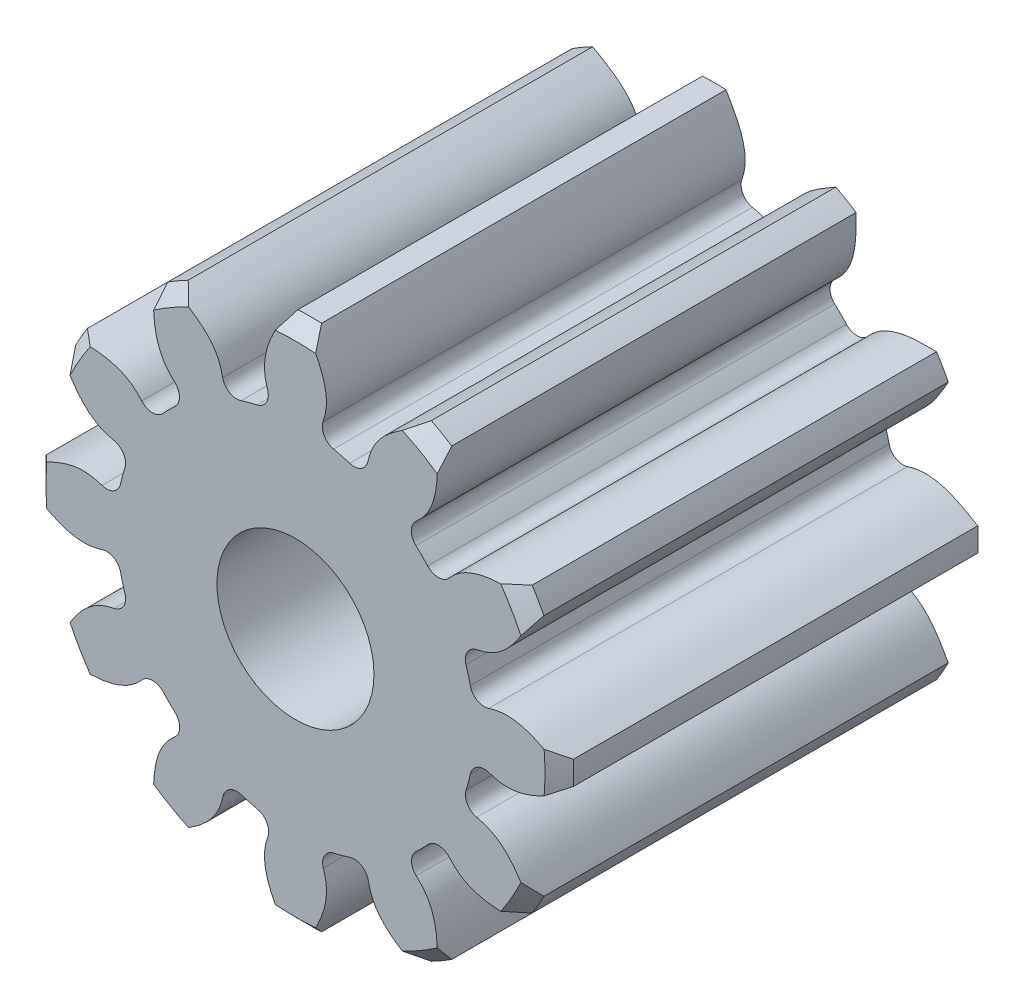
ISO-10303-21;
HEADER;
FILE_DESCRIPTION(('STEP AP214'),'2;1');
FILE_NAME('part.step','',(''),(''),'','','');
FILE_SCHEMA(('AUTOMOTIVE_DESIGN { 1 0 10303 214 1 1 1 1 }'));
ENDSEC;
DATA;
#1=APPLICATION_CONTEXT('core data for automotive mechanical design processes');
#2=APPLICATION_PROTOCOL_DEFINITION('international standard','automotive_design',2000,#1);
#3=PRODUCT_CONTEXT('',#1,'mechanical');
#4=PRODUCT('Part','Part','',(#3));
#5=PRODUCT_RELATED_PRODUCT_CATEGORY('part','',(#4));
#6=PRODUCT_DEFINITION_FORMATION('','',#4);
#7=PRODUCT_DEFINITION_CONTEXT('part definition',#1,'design');
#8=PRODUCT_DEFINITION('design','',#6,#7);
#9=PRODUCT_DEFINITION_SHAPE('','',#8);
#10=(LENGTH_UNIT() NAMED_UNIT(*) SI_UNIT(.MILLI.,.METRE.));
#11=(NAMED_UNIT(*) PLANE_ANGLE_UNIT() SI_UNIT($,.RADIAN.));
#12=(NAMED_UNIT(*) SI_UNIT($,.STERADIAN.) SOLID_ANGLE_UNIT());
#13=UNCERTAINTY_MEASURE_WITH_UNIT(LENGTH_MEASURE(1.E-05),#10,'distance_accuracy_value','');
#14=(GEOMETRIC_REPRESENTATION_CONTEXT(3) GLOBAL_UNCERTAINTY_ASSIGNED_CONTEXT((#13)) GLOBAL_UNIT_ASSIGNED_CONTEXT((#10,
#11,#12)) REPRESENTATION_CONTEXT('',''));
#15=CARTESIAN_POINT('',(0.,0.,0.));
#16=DIRECTION('',(0.,0.,1.));
#17=DIRECTION('',(1.,0.,0.));
#18=AXIS2_PLACEMENT_3D('',#15,#16,#17);
#19=CARTESIAN_POINT('',(0.,0.,-2.));
#20=DIRECTION('',(0.,0.,1.));
#21=DIRECTION('',(1.,0.,0.));
#22=AXIS2_PLACEMENT_3D('',#19,#20,#21);
#23=CYLINDRICAL_SURFACE('',#22,1.71);
#24=CARTESIAN_POINT('',(0.,0.,-2.));
#25=DIRECTION('',(0.,0.,1.));
#26=DIRECTION('',(1.,0.,0.));
#27=AXIS2_PLACEMENT_3D('',#24,#25,#26);
#28=CIRCLE('',#27,1.71);
#29=CARTESIAN_POINT('',(1.26283145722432,1.1529773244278,-2.));
#30=VERTEX_POINT('',#29);
#31=CARTESIAN_POINT('',(1.15092436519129,1.26470277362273,-2.));
#32=VERTEX_POINT('',#31);
#33=EDGE_CURVE('E1331',#30,#32,#28,.T.);
#34=ORIENTED_EDGE('',*,*,#33,.T.);
#35=DIRECTION('',(0.,0.,1.));
#36=VECTOR('',#35,1.);
#37=CARTESIAN_POINT('',(1.15092436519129,1.26470277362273,-2.));
#38=LINE('',#37,#36);
#39=CARTESIAN_POINT('',(1.15092436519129,1.26470277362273,2.));
#40=VERTEX_POINT('',#39);
#41=EDGE_CURVE('E1345',#32,#40,#38,.T.);
#42=ORIENTED_EDGE('',*,*,#41,.T.);
#43=CARTESIAN_POINT('',(0.,0.,2.));
#44=DIRECTION('',(0.,0.,1.));
#45=DIRECTION('',(1.,0.,0.));
#46=AXIS2_PLACEMENT_3D('',#43,#44,#45);
#47=CIRCLE('',#46,1.71);
#48=CARTESIAN_POINT('',(1.26283145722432,1.1529773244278,2.));
#49=VERTEX_POINT('',#48);
#50=EDGE_CURVE('E1562',#49,#40,#47,.T.);
#51=ORIENTED_EDGE('',*,*,#50,.F.);
#52=DIRECTION('',(0.,0.,1.));
#53=VECTOR('',#52,1.);
#54=CARTESIAN_POINT('',(1.26283145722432,1.1529773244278,-2.));
#55=LINE('',#54,#53);
#56=EDGE_CURVE('E1540',#49,#30,#55,.F.);
#57=ORIENTED_EDGE('',*,*,#56,.T.);
#58=EDGE_LOOP('',(#34,#42,#51,#57));
#59=FACE_BOUND('',#58,.T.);
#60=ADVANCED_FACE('F32',(#59),#23,.T.);
#61=CARTESIAN_POINT('',(1.67013278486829,0.36709192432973,-2.));
#62=VERTEX_POINT('',#61);
#63=CARTESIAN_POINT('',(1.6290811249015,0.519802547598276,-2.));
#64=VERTEX_POINT('',#63);
#65=EDGE_CURVE('E1572',#62,#64,#28,.T.);
#66=ORIENTED_EDGE('',*,*,#65,.T.);
#67=DIRECTION('',(0.,0.,1.));
#68=VECTOR('',#67,1.);
#69=CARTESIAN_POINT('',(1.6290811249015,0.519802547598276,-2.));
#70=LINE('',#69,#68);
#71=CARTESIAN_POINT('',(1.6290811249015,0.519802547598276,2.));
#72=VERTEX_POINT('',#71);
#73=EDGE_CURVE('E1545',#64,#72,#70,.T.);
#74=ORIENTED_EDGE('',*,*,#73,.T.);
#75=CARTESIAN_POINT('',(1.67013278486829,0.36709192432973,2.));
#76=VERTEX_POINT('',#75);
#77=EDGE_CURVE('E1568',#76,#72,#47,.T.);
#78=ORIENTED_EDGE('',*,*,#77,.F.);
#79=DIRECTION('',(0.,0.,1.));
#80=VECTOR('',#79,1.);
#81=CARTESIAN_POINT('',(1.67013278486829,0.36709192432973,-2.));
#82=LINE('',#81,#80);
#83=EDGE_CURVE('E1522',#76,#62,#82,.F.);
#84=ORIENTED_EDGE('',*,*,#83,.T.);
#85=EDGE_LOOP('',(#66,#74,#78,#84));
#86=FACE_BOUND('',#85,.T.);
#87=ADVANCED_FACE('F1615',(#86),#23,.T.);
#88=CARTESIAN_POINT('',(1.62992338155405,-0.517155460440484,-2.));
#89=VERTEX_POINT('',#88);
#90=CARTESIAN_POINT('',(1.67072691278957,-0.364378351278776,-2.));
#91=VERTEX_POINT('',#90);
#92=EDGE_CURVE('E2369',#89,#91,#28,.T.);
#93=ORIENTED_EDGE('',*,*,#92,.T.);
#94=DIRECTION('',(0.,0.,1.));
#95=VECTOR('',#94,1.);
#96=CARTESIAN_POINT('',(1.67072691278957,-0.364378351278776,-2.));
#97=LINE('',#96,#95);
#98=CARTESIAN_POINT('',(1.67072691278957,-0.364378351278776,2.));
#99=VERTEX_POINT('',#98);
#100=EDGE_CURVE('E1527',#91,#99,#97,.T.);
#101=ORIENTED_EDGE('',*,*,#100,.T.);
#102=CARTESIAN_POINT('',(1.62992338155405,-0.517155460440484,2.));
#103=VERTEX_POINT('',#102);
#104=EDGE_CURVE('E2381',#103,#99,#47,.T.);
#105=ORIENTED_EDGE('',*,*,#104,.F.);
#106=DIRECTION('',(0.,0.,1.));
#107=VECTOR('',#106,1.);
#108=CARTESIAN_POINT('',(1.62992338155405,-0.517155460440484,-2.));
#109=LINE('',#108,#107);
#110=EDGE_CURVE('E1504',#103,#89,#109,.F.);
#111=ORIENTED_EDGE('',*,*,#110,.T.);
#112=EDGE_LOOP('',(#93,#101,#105,#111));
#113=FACE_BOUND('',#112,.T.);
#114=ADVANCED_FACE('F1619',(#113),#23,.T.);
#115=CARTESIAN_POINT('',(1.1529773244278,-1.26283145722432,-2.));
#116=VERTEX_POINT('',#115);
#117=CARTESIAN_POINT('',(1.26470277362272,-1.1509243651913,-2.));
#118=VERTEX_POINT('',#117);
#119=EDGE_CURVE('E2375',#116,#118,#28,.T.);
#120=ORIENTED_EDGE('',*,*,#119,.T.);
#121=DIRECTION('',(0.,0.,1.));
#122=VECTOR('',#121,1.);
#123=CARTESIAN_POINT('',(1.26470277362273,-1.1509243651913,-2.));
#124=LINE('',#123,#122);
#125=CARTESIAN_POINT('',(1.26470277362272,-1.1509243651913,2.));
#126=VERTEX_POINT('',#125);
#127=EDGE_CURVE('E1509',#118,#126,#124,.T.);
#128=ORIENTED_EDGE('',*,*,#127,.T.);
#129=CARTESIAN_POINT('',(1.1529773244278,-1.26283145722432,2.));
#130=VERTEX_POINT('',#129);
#131=EDGE_CURVE('E2398',#130,#126,#47,.T.);
#132=ORIENTED_EDGE('',*,*,#131,.F.);
#133=DIRECTION('',(0.,0.,1.));
#134=VECTOR('',#133,1.);
#135=CARTESIAN_POINT('',(1.1529773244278,-1.26283145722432,-2.));
#136=LINE('',#135,#134);
#137=EDGE_CURVE('E1486',#130,#116,#136,.F.);
#138=ORIENTED_EDGE('',*,*,#137,.T.);
#139=EDGE_LOOP('',(#120,#128,#132,#138));
#140=FACE_BOUND('',#139,.T.);
#141=ADVANCED_FACE('F2230',(#140),#23,.T.);
#142=CARTESIAN_POINT('',(0.367091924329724,-1.67013278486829,-2.));
#143=VERTEX_POINT('',#142);
#144=CARTESIAN_POINT('',(0.519802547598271,-1.6290811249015,-2.));
#145=VERTEX_POINT('',#144);
#146=EDGE_CURVE('E2586',#143,#145,#28,.T.);
#147=ORIENTED_EDGE('',*,*,#146,.T.);
#148=DIRECTION('',(0.,0.,1.));
#149=VECTOR('',#148,1.);
#150=CARTESIAN_POINT('',(0.519802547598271,-1.6290811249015,-2.));
#151=LINE('',#150,#149);
#152=CARTESIAN_POINT('',(0.519802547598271,-1.6290811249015,2.));
#153=VERTEX_POINT('',#152);
#154=EDGE_CURVE('E1491',#145,#153,#151,.T.);
#155=ORIENTED_EDGE('',*,*,#154,.T.);
#156=CARTESIAN_POINT('',(0.367091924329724,-1.67013278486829,2.));
#157=VERTEX_POINT('',#156);
#158=EDGE_CURVE('E2400',#157,#153,#47,.T.);
#159=ORIENTED_EDGE('',*,*,#158,.F.);
#160=DIRECTION('',(0.,0.,1.));
#161=VECTOR('',#160,1.);
#162=CARTESIAN_POINT('',(0.367091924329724,-1.67013278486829,-2.));
#163=LINE('',#162,#161);
#164=EDGE_CURVE('E1468',#157,#143,#163,.F.);
#165=ORIENTED_EDGE('',*,*,#164,.T.);
#166=EDGE_LOOP('',(#147,#155,#159,#165));
#167=FACE_BOUND('',#166,.T.);
#168=ADVANCED_FACE('F2221',(#167),#23,.T.);
#169=CARTESIAN_POINT('',(-0.51715546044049,-1.62992338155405,-2.));
#170=VERTEX_POINT('',#169);
#171=CARTESIAN_POINT('',(-0.364378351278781,-1.67072691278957,-2.));
#172=VERTEX_POINT('',#171);
#173=EDGE_CURVE('E2548',#170,#172,#28,.T.);
#174=ORIENTED_EDGE('',*,*,#173,.T.);
#175=DIRECTION('',(0.,0.,1.));
#176=VECTOR('',#175,1.);
#177=CARTESIAN_POINT('',(-0.364378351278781,-1.67072691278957,-2.));
#178=LINE('',#177,#176);
#179=CARTESIAN_POINT('',(-0.364378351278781,-1.67072691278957,2.));
#180=VERTEX_POINT('',#179);
#181=EDGE_CURVE('E1473',#172,#180,#178,.T.);
#182=ORIENTED_EDGE('',*,*,#181,.T.);
#183=CARTESIAN_POINT('',(-0.51715546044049,-1.62992338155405,2.));
#184=VERTEX_POINT('',#183);
#185=EDGE_CURVE('E2404',#184,#180,#47,.T.);
#186=ORIENTED_EDGE('',*,*,#185,.F.);
#187=DIRECTION('',(0.,0.,1.));
#188=VECTOR('',#187,1.);
#189=CARTESIAN_POINT('',(-0.51715546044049,-1.62992338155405,-2.));
#190=LINE('',#189,#188);
#191=EDGE_CURVE('E1450',#184,#170,#190,.F.);
#192=ORIENTED_EDGE('',*,*,#191,.T.);
#193=EDGE_LOOP('',(#174,#182,#186,#192));
#194=FACE_BOUND('',#193,.T.);
#195=ADVANCED_FACE('F2212',(#194),#23,.T.);
#196=CARTESIAN_POINT('',(-1.26283145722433,-1.1529773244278,-2.));
#197=VERTEX_POINT('',#196);
#198=CARTESIAN_POINT('',(-1.1509243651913,-1.26470277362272,-2.));
#199=VERTEX_POINT('',#198);
#200=EDGE_CURVE('E2524',#197,#199,#28,.T.);
#201=ORIENTED_EDGE('',*,*,#200,.T.);
#202=DIRECTION('',(0.,0.,1.));
#203=VECTOR('',#202,1.);
#204=CARTESIAN_POINT('',(-1.1509243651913,-1.26470277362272,-2.));
#205=LINE('',#204,#203);
#206=CARTESIAN_POINT('',(-1.1509243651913,-1.26470277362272,2.));
#207=VERTEX_POINT('',#206);
#208=EDGE_CURVE('E1455',#199,#207,#205,.T.);
#209=ORIENTED_EDGE('',*,*,#208,.T.);
#210=CARTESIAN_POINT('',(-1.26283145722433,-1.1529773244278,2.));
#211=VERTEX_POINT('',#210);
#212=EDGE_CURVE('E2408',#211,#207,#47,.T.);
#213=ORIENTED_EDGE('',*,*,#212,.F.);
#214=DIRECTION('',(0.,0.,1.));
#215=VECTOR('',#214,1.);
#216=CARTESIAN_POINT('',(-1.26283145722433,-1.1529773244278,-2.));
#217=LINE('',#216,#215);
#218=EDGE_CURVE('E1432',#211,#197,#217,.F.);
#219=ORIENTED_EDGE('',*,*,#218,.T.);
#220=EDGE_LOOP('',(#201,#209,#213,#219));
#221=FACE_BOUND('',#220,.T.);
#222=ADVANCED_FACE('F2203',(#221),#23,.T.);
#223=CARTESIAN_POINT('',(-1.67013278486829,-0.367091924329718,-2.));
#224=VERTEX_POINT('',#223);
#225=CARTESIAN_POINT('',(-1.62908112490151,-0.519802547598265,-2.));
#226=VERTEX_POINT('',#225);
#227=EDGE_CURVE('E2486',#224,#226,#28,.T.);
#228=ORIENTED_EDGE('',*,*,#227,.T.);
#229=DIRECTION('',(0.,0.,1.));
#230=VECTOR('',#229,1.);
#231=CARTESIAN_POINT('',(-1.62908112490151,-0.519802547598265,-2.));
#232=LINE('',#231,#230);
#233=CARTESIAN_POINT('',(-1.62908112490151,-0.519802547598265,2.));
#234=VERTEX_POINT('',#233);
#235=EDGE_CURVE('E1437',#226,#234,#232,.T.);
#236=ORIENTED_EDGE('',*,*,#235,.T.);
#237=CARTESIAN_POINT('',(-1.67013278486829,-0.367091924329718,2.));
#238=VERTEX_POINT('',#237);
#239=EDGE_CURVE('E2412',#238,#234,#47,.T.);
#240=ORIENTED_EDGE('',*,*,#239,.F.);
#241=DIRECTION('',(0.,0.,1.));
#242=VECTOR('',#241,1.);
#243=CARTESIAN_POINT('',(-1.67013278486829,-0.367091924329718,-2.));
#244=LINE('',#243,#242);
#245=EDGE_CURVE('E1414',#238,#224,#244,.F.);
#246=ORIENTED_EDGE('',*,*,#245,.T.);
#247=EDGE_LOOP('',(#228,#236,#240,#246));
#248=FACE_BOUND('',#247,.T.);
#249=ADVANCED_FACE('F2194',(#248),#23,.T.);
#250=CARTESIAN_POINT('',(-1.62992338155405,0.517155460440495,-2.));
#251=VERTEX_POINT('',#250);
#252=CARTESIAN_POINT('',(-1.67072691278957,0.364378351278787,-2.));
#253=VERTEX_POINT('',#252);
#254=EDGE_CURVE('E2466',#251,#253,#28,.T.);
#255=ORIENTED_EDGE('',*,*,#254,.T.);
#256=DIRECTION('',(0.,0.,1.));
#257=VECTOR('',#256,1.);
#258=CARTESIAN_POINT('',(-1.67072691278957,0.364378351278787,-2.));
#259=LINE('',#258,#257);
#260=CARTESIAN_POINT('',(-1.67072691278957,0.364378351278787,2.));
#261=VERTEX_POINT('',#260);
#262=EDGE_CURVE('E1419',#253,#261,#259,.T.);
#263=ORIENTED_EDGE('',*,*,#262,.T.);
#264=CARTESIAN_POINT('',(-1.62992338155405,0.517155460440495,2.));
#265=VERTEX_POINT('',#264);
#266=EDGE_CURVE('E2416',#265,#261,#47,.T.);
#267=ORIENTED_EDGE('',*,*,#266,.F.);
#268=DIRECTION('',(0.,0.,1.));
#269=VECTOR('',#268,1.);
#270=CARTESIAN_POINT('',(-1.62992338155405,0.517155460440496,-2.));
#271=LINE('',#270,#269);
#272=EDGE_CURVE('E1396',#265,#251,#271,.F.);
#273=ORIENTED_EDGE('',*,*,#272,.T.);
#274=EDGE_LOOP('',(#255,#263,#267,#273));
#275=FACE_BOUND('',#274,.T.);
#276=ADVANCED_FACE('F2186',(#275),#23,.T.);
#277=CARTESIAN_POINT('',(-1.15297732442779,1.26283145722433,-2.));
#278=VERTEX_POINT('',#277);
#279=CARTESIAN_POINT('',(-1.26470277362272,1.1509243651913,-2.));
#280=VERTEX_POINT('',#279);
#281=EDGE_CURVE('E1275',#278,#280,#28,.T.);
#282=ORIENTED_EDGE('',*,*,#281,.T.);
#283=DIRECTION('',(0.,0.,1.));
#284=VECTOR('',#283,1.);
#285=CARTESIAN_POINT('',(-1.26470277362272,1.1509243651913,-2.));
#286=LINE('',#285,#284);
#287=CARTESIAN_POINT('',(-1.26470277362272,1.1509243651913,2.));
#288=VERTEX_POINT('',#287);
#289=EDGE_CURVE('E1401',#280,#288,#286,.T.);
#290=ORIENTED_EDGE('',*,*,#289,.T.);
#291=CARTESIAN_POINT('',(-1.15297732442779,1.26283145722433,2.));
#292=VERTEX_POINT('',#291);
#293=EDGE_CURVE('E1271',#292,#288,#47,.T.);
#294=ORIENTED_EDGE('',*,*,#293,.F.);
#295=DIRECTION('',(0.,0.,1.));
#296=VECTOR('',#295,1.);
#297=CARTESIAN_POINT('',(-1.15297732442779,1.26283145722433,-2.));
#298=LINE('',#297,#296);
#299=EDGE_CURVE('E1374',#292,#278,#298,.F.);
#300=ORIENTED_EDGE('',*,*,#299,.T.);
#301=EDGE_LOOP('',(#282,#290,#294,#300));
#302=FACE_BOUND('',#301,.T.);
#303=ADVANCED_FACE('F1626',(#302),#23,.T.);
#304=CARTESIAN_POINT('',(-0.367091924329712,1.67013278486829,-2.));
#305=VERTEX_POINT('',#304);
#306=CARTESIAN_POINT('',(-0.519802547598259,1.62908112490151,-2.));
#307=VERTEX_POINT('',#306);
#308=EDGE_CURVE('E1266',#305,#307,#28,.T.);
#309=ORIENTED_EDGE('',*,*,#308,.T.);
#310=DIRECTION('',(0.,0.,1.));
#311=VECTOR('',#310,1.);
#312=CARTESIAN_POINT('',(-0.519802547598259,1.62908112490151,-2.));
#313=LINE('',#312,#311);
#314=CARTESIAN_POINT('',(-0.519802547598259,1.62908112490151,2.));
#315=VERTEX_POINT('',#314);
#316=EDGE_CURVE('E1381',#307,#315,#313,.T.);
#317=ORIENTED_EDGE('',*,*,#316,.T.);
#318=CARTESIAN_POINT('',(-0.367091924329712,1.67013278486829,2.));
#319=VERTEX_POINT('',#318);
#320=EDGE_CURVE('E1267',#319,#315,#47,.T.);
#321=ORIENTED_EDGE('',*,*,#320,.F.);
#322=DIRECTION('',(0.,0.,1.));
#323=VECTOR('',#322,1.);
#324=CARTESIAN_POINT('',(-0.367091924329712,1.67013278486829,-2.));
#325=LINE('',#324,#323);
#326=EDGE_CURVE('E1258',#319,#305,#325,.F.);
#327=ORIENTED_EDGE('',*,*,#326,.T.);
#328=EDGE_LOOP('',(#309,#317,#321,#327));
#329=FACE_BOUND('',#328,.T.);
#330=ADVANCED_FACE('F1622',(#329),#23,.T.);
#331=CARTESIAN_POINT('',(0.517155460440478,1.62992338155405,2.));
#332=VERTEX_POINT('',#331);
#333=CARTESIAN_POINT('',(0.364378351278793,1.67072691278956,2.));
#334=VERTEX_POINT('',#333);
#335=EDGE_CURVE('E1272',#332,#334,#47,.T.);
#336=ORIENTED_EDGE('',*,*,#335,.F.);
#337=DIRECTION('',(0.,0.,1.));
#338=VECTOR('',#337,1.);
#339=CARTESIAN_POINT('',(0.517155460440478,1.62992338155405,-2.));
#340=LINE('',#339,#338);
#341=CARTESIAN_POINT('',(0.517155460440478,1.62992338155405,-2.));
#342=VERTEX_POINT('',#341);
#343=EDGE_CURVE('E1337',#332,#342,#340,.F.);
#344=ORIENTED_EDGE('',*,*,#343,.T.);
#345=CARTESIAN_POINT('',(0.364378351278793,1.67072691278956,-2.));
#346=VERTEX_POINT('',#345);
#347=EDGE_CURVE('E1270',#342,#346,#28,.T.);
#348=ORIENTED_EDGE('',*,*,#347,.T.);
#349=DIRECTION('',(0.,0.,1.));
#350=VECTOR('',#349,1.);
#351=CARTESIAN_POINT('',(0.364378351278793,1.67072691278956,-2.));
#352=LINE('',#351,#350);
#353=EDGE_CURVE('E1260',#346,#334,#352,.T.);
#354=ORIENTED_EDGE('',*,*,#353,.T.);
#355=EDGE_LOOP('',(#336,#344,#348,#354));
#356=FACE_BOUND('',#355,.T.);
#357=ADVANCED_FACE('F1611',(#356),#23,.T.);
#358=CARTESIAN_POINT('',(0.,0.,-2.));
#359=DIRECTION('',(0.,0.,1.));
#360=DIRECTION('',(1.,0.,0.));
#361=AXIS2_PLACEMENT_3D('',#358,#359,#360);
#362=PLANE('',#361);
#363=CARTESIAN_POINT('',(0.,0.,-2.));
#364=DIRECTION('',(0.,0.,1.));
#365=DIRECTION('',(1.,0.,0.));
#366=AXIS2_PLACEMENT_3D('',#363,#364,#365);
#367=CIRCLE('',#366,0.75);
#368=CARTESIAN_POINT('',(0.75,0.,-2.));
#369=VERTEX_POINT('',#368);
#370=EDGE_CURVE('E1596',#369,#369,#367,.F.);
#371=ORIENTED_EDGE('',*,*,#370,.F.);
#372=EDGE_LOOP('',(#371));
#373=FACE_BOUND('',#372,.T.);
#374=ORIENTED_EDGE('',*,*,#347,.F.);
#375=CARTESIAN_POINT('',(0.558527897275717,1.76031725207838,-2.));
#376=DIRECTION('',(0.,0.,1.));
#377=DIRECTION('',(1.,0.,0.));
#378=AXIS2_PLACEMENT_3D('',#375,#376,#377);
#379=CIRCLE('',#378,0.1368);
#380=CARTESIAN_POINT('',(0.692115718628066,1.73084635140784,-2.));
#381=VERTEX_POINT('',#380);
#382=EDGE_CURVE('E1329',#342,#381,#379,.T.);
#383=ORIENTED_EDGE('',*,*,#382,.T.);
#384=CARTESIAN_POINT('',(1.16116180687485,2.23653823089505,-2.));
#385=CARTESIAN_POINT('',(1.03960160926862,2.16741037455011,-2.));
#386=CARTESIAN_POINT('',(0.87858983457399,2.07584751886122,-2.));
#387=CARTESIAN_POINT('',(0.660683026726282,1.77749297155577,-2.));
#388=CARTESIAN_POINT('',(0.67121967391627,1.53361416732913,-2.));
#389=CARTESIAN_POINT('',(0.651770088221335,1.3542458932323,-2.));
#390=B_SPLINE_CURVE_WITH_KNOTS('',3,(#384,#385,#386,#387,#388,#389),.UNSPECIFIED.,.F.,.F.,(4,1,
1,4),(0.,0.379370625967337,0.5024929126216,1.),.UNSPECIFIED.);
#391=CARTESIAN_POINT('',(1.16116180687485,2.23653823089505,-2.));
#392=VERTEX_POINT('',#391);
#393=EDGE_CURVE('E572',#392,#381,#390,.T.);
#394=ORIENTED_EDGE('',*,*,#393,.F.);
#395=CARTESIAN_POINT('',(0.,0.,-2.));
#396=DIRECTION('',(0.,0.,1.));
#397=DIRECTION('',(0.866025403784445,-0.499999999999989,0.));
#398=AXIS2_PLACEMENT_3D('',#395,#396,#397);
#399=CIRCLE('',#398,2.52);
#400=CARTESIAN_POINT('',(1.35631802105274,2.12386473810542,-2.));
#401=VERTEX_POINT('',#400);
#402=EDGE_CURVE('E566',#401,#392,#399,.T.);
#403=ORIENTED_EDGE('',*,*,#402,.F.);
#404=CARTESIAN_POINT('',(0.846926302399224,1.24157240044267,-2.));
#405=CARTESIAN_POINT('',(0.98513580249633,1.35754394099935,-2.));
#406=CARTESIAN_POINT('',(1.20975260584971,1.4599707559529,-2.));
#407=CARTESIAN_POINT('',(1.35812977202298,1.79920286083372,-2.));
#408=CARTESIAN_POINT('',(1.35709742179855,1.98419780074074,-2.));
#409=CARTESIAN_POINT('',(1.35631802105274,2.12386473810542,-2.));
#410=B_SPLINE_CURVE_WITH_KNOTS('',3,(#404,#405,#406,#407,#408,#409),.UNSPECIFIED.,.F.,.F.,(4,1,
1,4),(0.,0.4975070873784,0.620629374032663,1.),.UNSPECIFIED.);
#411=CARTESIAN_POINT('',(1.15269589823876,1.46863946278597,-2.));
#412=VERTEX_POINT('',#411);
#413=EDGE_CURVE('E557',#412,#401,#410,.T.);
#414=ORIENTED_EDGE('',*,*,#413,.F.);
#415=CARTESIAN_POINT('',(1.24299831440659,1.36587899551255,-2.));
#416=DIRECTION('',(0.,0.,1.));
#417=DIRECTION('',(1.,0.,0.));
#418=AXIS2_PLACEMENT_3D('',#415,#416,#417);
#419=CIRCLE('',#418,0.1368);
#420=EDGE_CURVE('E1340',#412,#32,#419,.T.);
#421=ORIENTED_EDGE('',*,*,#420,.T.);
#422=ORIENTED_EDGE('',*,*,#33,.F.);
#423=CARTESIAN_POINT('',(1.36385797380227,1.24521551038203,-2.));
#424=DIRECTION('',(0.,0.,1.));
#425=DIRECTION('',(1.,0.,0.));
#426=AXIS2_PLACEMENT_3D('',#423,#424,#425);
#427=CIRCLE('',#426,0.1368);
#428=CARTESIAN_POINT('',(1.46481297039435,1.15289905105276,-2.));
#429=VERTEX_POINT('',#428);
#430=EDGE_CURVE('E1549',#30,#429,#427,.T.);
#431=ORIENTED_EDGE('',*,*,#430,.T.);
#432=CARTESIAN_POINT('',(2.12386473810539,1.35631802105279,-2.));
#433=CARTESIAN_POINT('',(1.98402659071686,1.35723164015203,-2.));
#434=CARTESIAN_POINT('',(1.79880487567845,1.35844176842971,-2.));
#435=CARTESIAN_POINT('',(1.46091477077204,1.20901255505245,-2.));
#436=CARTESIAN_POINT('',(1.34810037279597,0.992538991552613,-2.));
#437=CARTESIAN_POINT('',(1.24157240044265,0.846926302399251,-2.));
#438=B_SPLINE_CURVE_WITH_KNOTS('',3,(#432,#433,#434,#435,#436,#437),.UNSPECIFIED.,.F.,.F.,(4,1,
1,4),(0.,0.379370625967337,0.5024929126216,1.),.UNSPECIFIED.);
#439=CARTESIAN_POINT('',(2.12386473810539,1.35631802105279,-2.));
#440=VERTEX_POINT('',#439);
#441=EDGE_CURVE('E647',#440,#429,#438,.T.);
#442=ORIENTED_EDGE('',*,*,#441,.F.);
#443=CARTESIAN_POINT('',(0.,0.,-2.));
#444=DIRECTION('',(0.,0.,1.));
#445=DIRECTION('',(0.50000000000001,-0.866025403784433,0.));
#446=AXIS2_PLACEMENT_3D('',#443,#444,#445);
#447=CIRCLE('',#446,2.52);
#448=CARTESIAN_POINT('',(2.23653823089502,1.1611618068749,-2.));
#449=VERTEX_POINT('',#448);
#450=EDGE_CURVE('E655',#449,#440,#447,.T.);
#451=ORIENTED_EDGE('',*,*,#450,.F.);
#452=CARTESIAN_POINT('',(1.35424589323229,0.651770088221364,-2.));
#453=CARTESIAN_POINT('',(1.53192460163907,0.683099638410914,-2.));
#454=CARTESIAN_POINT('',(1.77766186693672,0.659495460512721,-2.));
#455=CARTESIAN_POINT('',(2.07577631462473,0.879090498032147,-2.));
#456=CARTESIAN_POINT('',(2.16737974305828,1.03981699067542,-2.));
#457=CARTESIAN_POINT('',(2.23653823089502,1.1611618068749,-2.));
#458=B_SPLINE_CURVE_WITH_KNOTS('',3,(#452,#453,#454,#455,#456,#457),.UNSPECIFIED.,.F.,.F.,(4,1,
1,4),(0.,0.4975070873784,0.620629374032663,1.),.UNSPECIFIED.);
#459=CARTESIAN_POINT('',(1.73258366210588,0.695531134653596,-2.));
#460=VERTEX_POINT('',#459);
#461=EDGE_CURVE('E671',#460,#449,#458,.T.);
#462=ORIENTED_EDGE('',*,*,#461,.F.);
#463=CARTESIAN_POINT('',(1.75940761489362,0.561386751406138,-2.));
#464=DIRECTION('',(0.,0.,1.));
#465=DIRECTION('',(1.,0.,0.));
#466=AXIS2_PLACEMENT_3D('',#463,#464,#465);
#467=CIRCLE('',#466,0.1368);
#468=EDGE_CURVE('E1551',#460,#64,#467,.T.);
#469=ORIENTED_EDGE('',*,*,#468,.T.);
#470=ORIENTED_EDGE('',*,*,#65,.F.);
#471=CARTESIAN_POINT('',(1.80374340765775,0.396459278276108,-2.));
#472=DIRECTION('',(0.,0.,1.));
#473=DIRECTION('',(1.,0.,0.));
#474=AXIS2_PLACEMENT_3D('',#471,#472,#473);
#475=CIRCLE('',#474,0.1368);
#476=CARTESIAN_POINT('',(1.84501476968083,0.266033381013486,-2.));
#477=VERTEX_POINT('',#476);
#478=EDGE_CURVE('E1531',#62,#477,#475,.T.);
#479=ORIENTED_EDGE('',*,*,#478,.T.);
#480=CARTESIAN_POINT('',(2.51747982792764,0.112673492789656,-2.));
#481=CARTESIAN_POINT('',(2.39683324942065,0.183383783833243,-2.));
#482=CARTESIAN_POINT('',(2.23703160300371,0.277042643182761,-2.));
#483=CARTESIAN_POINT('',(1.86969558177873,0.316578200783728,-2.));
#484=CARTESIAN_POINT('',(1.66375866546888,0.185513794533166,-2.));
#485=CARTESIAN_POINT('',(1.49869639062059,0.112673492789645,-2.));
#486=B_SPLINE_CURVE_WITH_KNOTS('',3,(#480,#481,#482,#483,#484,#485),.UNSPECIFIED.,.F.,.F.,(4,1,
1,4),(0.,0.379370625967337,0.5024929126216,1.),.UNSPECIFIED.);
#487=CARTESIAN_POINT('',(2.51747982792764,0.112673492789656,-2.));
#488=VERTEX_POINT('',#487);
#489=EDGE_CURVE('E723',#488,#477,#486,.T.);
#490=ORIENTED_EDGE('',*,*,#489,.F.);
#491=CARTESIAN_POINT('',(0.,0.,-2.));
#492=DIRECTION('',(0.,0.,1.));
#493=DIRECTION('',(0.,-1.,0.));
#494=AXIS2_PLACEMENT_3D('',#491,#492,#493);
#495=CIRCLE('',#494,2.52);
#496=CARTESIAN_POINT('',(2.51747982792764,-0.112673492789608,-2.));
#497=VERTEX_POINT('',#496);
#498=EDGE_CURVE('E686',#497,#488,#495,.T.);
#499=ORIENTED_EDGE('',*,*,#498,.F.);
#500=CARTESIAN_POINT('',(1.49869639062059,-0.112673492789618,-2.));
#501=CARTESIAN_POINT('',(1.66823544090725,-0.17438066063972,-2.));
#502=CARTESIAN_POINT('',(1.86924806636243,-0.317691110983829,-2.));
#503=CARTESIAN_POINT('',(2.23722027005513,-0.276573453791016,-2.));
#504=CARTESIAN_POINT('',(2.39691441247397,-0.183181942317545,-2.));
#505=CARTESIAN_POINT('',(2.51747982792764,-0.112673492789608,-2.));
#506=B_SPLINE_CURVE_WITH_KNOTS('',3,(#500,#501,#502,#503,#504,#505),.UNSPECIFIED.,.F.,.F.,(4,1,
1,4),(0.,0.4975070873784,0.620629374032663,1.),.UNSPECIFIED.);
#507=CARTESIAN_POINT('',(1.84822703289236,-0.263944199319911,-2.));
#508=VERTEX_POINT('',#507);
#509=EDGE_CURVE('E681',#508,#497,#506,.T.);
#510=ORIENTED_EDGE('',*,*,#509,.F.);
#511=CARTESIAN_POINT('',(1.80438506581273,-0.393528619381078,-2.));
#512=DIRECTION('',(0.,0.,1.));
#513=DIRECTION('',(1.,0.,0.));
#514=AXIS2_PLACEMENT_3D('',#511,#512,#513);
#515=CIRCLE('',#514,0.1368);
#516=EDGE_CURVE('E1533',#508,#91,#515,.T.);
#517=ORIENTED_EDGE('',*,*,#516,.T.);
#518=ORIENTED_EDGE('',*,*,#92,.F.);
#519=CARTESIAN_POINT('',(1.76031725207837,-0.558527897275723,-2.));
#520=DIRECTION('',(0.,0.,1.));
#521=DIRECTION('',(1.,0.,0.));
#522=AXIS2_PLACEMENT_3D('',#519,#520,#521);
#523=CIRCLE('',#522,0.1368);
#524=CARTESIAN_POINT('',(1.73084635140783,-0.692115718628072,-2.));
#525=VERTEX_POINT('',#524);
#526=EDGE_CURVE('E1513',#89,#525,#523,.T.);
#527=ORIENTED_EDGE('',*,*,#526,.T.);
#528=CARTESIAN_POINT('',(2.23653823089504,-1.16116180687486,-2.));
#529=CARTESIAN_POINT('',(2.16741037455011,-1.03960160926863,-2.));
#530=CARTESIAN_POINT('',(2.07584751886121,-0.878589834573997,-2.));
#531=CARTESIAN_POINT('',(1.77749297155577,-0.660683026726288,-2.));
#532=CARTESIAN_POINT('',(1.53361416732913,-0.671219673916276,-2.));
#533=CARTESIAN_POINT('',(1.3542458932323,-0.65177008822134,-2.));
#534=B_SPLINE_CURVE_WITH_KNOTS('',3,(#528,#529,#530,#531,#532,#533),.UNSPECIFIED.,.F.,.F.,(4,1,
1,4),(0.,0.379370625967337,0.5024929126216,1.),.UNSPECIFIED.);
#535=CARTESIAN_POINT('',(2.23653823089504,-1.16116180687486,-2.));
#536=VERTEX_POINT('',#535);
#537=EDGE_CURVE('E2624',#536,#525,#534,.T.);
#538=ORIENTED_EDGE('',*,*,#537,.F.);
#539=CARTESIAN_POINT('',(0.,0.,-2.));
#540=DIRECTION('',(0.,0.,1.));
#541=DIRECTION('',(-0.499999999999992,-0.866025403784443,0.));
#542=AXIS2_PLACEMENT_3D('',#539,#540,#541);
#543=CIRCLE('',#542,2.52);
#544=CARTESIAN_POINT('',(2.12386473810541,-1.35631802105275,-2.));
#545=VERTEX_POINT('',#544);
#546=EDGE_CURVE('E757',#545,#536,#543,.T.);
#547=ORIENTED_EDGE('',*,*,#546,.F.);
#548=CARTESIAN_POINT('',(1.24157240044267,-0.846926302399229,-2.));
#549=CARTESIAN_POINT('',(1.35754394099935,-0.985135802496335,-2.));
#550=CARTESIAN_POINT('',(1.45997075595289,-1.20975260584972,-2.));
#551=CARTESIAN_POINT('',(1.79920286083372,-1.35812977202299,-2.));
#552=CARTESIAN_POINT('',(1.98419780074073,-1.35709742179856,-2.));
#553=CARTESIAN_POINT('',(2.12386473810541,-1.35631802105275,-2.));
#554=B_SPLINE_CURVE_WITH_KNOTS('',3,(#548,#549,#550,#551,#552,#553),.UNSPECIFIED.,.F.,.F.,(4,1,
1,4),(0.,0.4975070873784,0.620629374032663,1.),.UNSPECIFIED.);
#555=CARTESIAN_POINT('',(1.46863946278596,-1.15269589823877,-2.));
#556=VERTEX_POINT('',#555);
#557=EDGE_CURVE('E752',#556,#545,#554,.T.);
#558=ORIENTED_EDGE('',*,*,#557,.F.);
#559=CARTESIAN_POINT('',(1.36587899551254,-1.2429983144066,-2.));
#560=DIRECTION('',(0.,0.,1.));
#561=DIRECTION('',(1.,0.,0.));
#562=AXIS2_PLACEMENT_3D('',#559,#560,#561);
#563=CIRCLE('',#562,0.1368);
#564=EDGE_CURVE('E1515',#556,#118,#563,.T.);
#565=ORIENTED_EDGE('',*,*,#564,.T.);
#566=ORIENTED_EDGE('',*,*,#119,.F.);
#567=CARTESIAN_POINT('',(1.24521551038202,-1.36385797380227,-2.));
#568=DIRECTION('',(0.,0.,1.));
#569=DIRECTION('',(1.,0.,0.));
#570=AXIS2_PLACEMENT_3D('',#567,#568,#569);
#571=CIRCLE('',#570,0.1368);
#572=CARTESIAN_POINT('',(1.15289905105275,-1.46481297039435,-2.));
#573=VERTEX_POINT('',#572);
#574=EDGE_CURVE('E1495',#116,#573,#571,.T.);
#575=ORIENTED_EDGE('',*,*,#574,.T.);
#576=CARTESIAN_POINT('',(1.35631802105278,-2.12386473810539,-2.));
#577=CARTESIAN_POINT('',(1.35723164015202,-1.98402659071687,-2.));
#578=CARTESIAN_POINT('',(1.35844176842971,-1.79880487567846,-2.));
#579=CARTESIAN_POINT('',(1.20901255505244,-1.46091477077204,-2.));
#580=CARTESIAN_POINT('',(0.992538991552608,-1.34810037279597,-2.));
#581=CARTESIAN_POINT('',(0.846926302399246,-1.24157240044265,-2.));
#582=B_SPLINE_CURVE_WITH_KNOTS('',3,(#576,#577,#578,#579,#580,#581),.UNSPECIFIED.,.F.,.F.,(4,1,
1,4),(0.,0.379370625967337,0.5024929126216,1.),.UNSPECIFIED.);
#583=CARTESIAN_POINT('',(1.35631802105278,-2.12386473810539,-2.));
#584=VERTEX_POINT('',#583);
#585=EDGE_CURVE('E830',#584,#573,#582,.T.);
#586=ORIENTED_EDGE('',*,*,#585,.F.);
#587=CARTESIAN_POINT('',(0.,0.,-2.));
#588=DIRECTION('',(0.,0.,1.));
#589=DIRECTION('',(-0.866025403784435,-0.500000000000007,0.));
#590=AXIS2_PLACEMENT_3D('',#587,#588,#589);
#591=CIRCLE('',#590,2.52);
#592=CARTESIAN_POINT('',(1.16116180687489,-2.23653823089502,-2.));
#593=VERTEX_POINT('',#592);
#594=EDGE_CURVE('E822',#593,#584,#591,.T.);
#595=ORIENTED_EDGE('',*,*,#594,.F.);
#596=CARTESIAN_POINT('',(0.65177008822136,-1.35424589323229,-2.));
#597=CARTESIAN_POINT('',(0.683099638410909,-1.53192460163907,-2.));
#598=CARTESIAN_POINT('',(0.659495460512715,-1.77766186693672,-2.));
#599=CARTESIAN_POINT('',(0.87909049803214,-2.07577631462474,-2.));
#600=CARTESIAN_POINT('',(1.03981699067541,-2.16737974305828,-2.));
#601=CARTESIAN_POINT('',(1.16116180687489,-2.23653823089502,-2.));
#602=B_SPLINE_CURVE_WITH_KNOTS('',3,(#596,#597,#598,#599,#600,#601),.UNSPECIFIED.,.F.,.F.,(4,1,
1,4),(0.,0.4975070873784,0.620629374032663,1.),.UNSPECIFIED.);
#603=CARTESIAN_POINT('',(0.69553113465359,-1.73258366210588,-2.));
#604=VERTEX_POINT('',#603);
#605=EDGE_CURVE('E816',#604,#593,#602,.T.);
#606=ORIENTED_EDGE('',*,*,#605,.F.);
#607=CARTESIAN_POINT('',(0.561386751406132,-1.75940761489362,-2.));
#608=DIRECTION('',(0.,0.,1.));
#609=DIRECTION('',(1.,0.,0.));
#610=AXIS2_PLACEMENT_3D('',#607,#608,#609);
#611=CIRCLE('',#610,0.1368);
#612=EDGE_CURVE('E1497',#604,#145,#611,.T.);
#613=ORIENTED_EDGE('',*,*,#612,.T.);
#614=ORIENTED_EDGE('',*,*,#146,.F.);
#615=CARTESIAN_POINT('',(0.396459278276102,-1.80374340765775,-2.));
#616=DIRECTION('',(0.,0.,1.));
#617=DIRECTION('',(1.,0.,0.));
#618=AXIS2_PLACEMENT_3D('',#615,#616,#617);
#619=CIRCLE('',#618,0.1368);
#620=CARTESIAN_POINT('',(0.26603338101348,-1.84501476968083,-2.));
#621=VERTEX_POINT('',#620);
#622=EDGE_CURVE('E1477',#143,#621,#619,.T.);
#623=ORIENTED_EDGE('',*,*,#622,.T.);
#624=CARTESIAN_POINT('',(0.112673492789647,-2.51747982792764,-2.));
#625=CARTESIAN_POINT('',(0.183383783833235,-2.39683324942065,-2.));
#626=CARTESIAN_POINT('',(0.277042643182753,-2.23703160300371,-2.));
#627=CARTESIAN_POINT('',(0.316578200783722,-1.86969558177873,-2.));
#628=CARTESIAN_POINT('',(0.18551379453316,-1.66375866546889,-2.));
#629=CARTESIAN_POINT('',(0.11267349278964,-1.49869639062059,-2.));
#630=B_SPLINE_CURVE_WITH_KNOTS('',3,(#624,#625,#626,#627,#628,#629),.UNSPECIFIED.,.F.,.F.,(4,1,
1,4),(0.,0.379370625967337,0.5024929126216,1.),.UNSPECIFIED.);
#631=CARTESIAN_POINT('',(0.112673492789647,-2.51747982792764,-2.));
#632=VERTEX_POINT('',#631);
#633=EDGE_CURVE('E2563',#632,#621,#630,.T.);
#634=ORIENTED_EDGE('',*,*,#633,.F.);
#635=CARTESIAN_POINT('',(0.,0.,-2.));
#636=DIRECTION('',(0.,0.,1.));
#637=DIRECTION('',(-1.,0.,0.));
#638=AXIS2_PLACEMENT_3D('',#635,#636,#637);
#639=CIRCLE('',#638,2.52);
#640=CARTESIAN_POINT('',(-0.112673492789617,-2.51747982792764,-2.));
#641=VERTEX_POINT('',#640);
#642=EDGE_CURVE('E866',#641,#632,#639,.T.);
#643=ORIENTED_EDGE('',*,*,#642,.F.);
#644=CARTESIAN_POINT('',(-0.112673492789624,-1.49869639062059,-2.));
#645=CARTESIAN_POINT('',(-0.174380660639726,-1.66823544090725,-2.));
#646=CARTESIAN_POINT('',(-0.317691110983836,-1.86924806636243,-2.));
#647=CARTESIAN_POINT('',(-0.276573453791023,-2.23722027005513,-2.));
#648=CARTESIAN_POINT('',(-0.183181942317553,-2.39691441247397,-2.));
#649=CARTESIAN_POINT('',(-0.112673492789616,-2.51747982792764,-2.));
#650=B_SPLINE_CURVE_WITH_KNOTS('',3,(#644,#645,#646,#647,#648,#649),.UNSPECIFIED.,.F.,.F.,(4,1,
1,4),(0.,0.4975070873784,0.620629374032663,1.),.UNSPECIFIED.);
#651=CARTESIAN_POINT('',(-0.263944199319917,-1.84822703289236,-2.));
#652=VERTEX_POINT('',#651);
#653=EDGE_CURVE('E861',#652,#641,#650,.T.);
#654=ORIENTED_EDGE('',*,*,#653,.F.);
#655=CARTESIAN_POINT('',(-0.393528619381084,-1.80438506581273,-2.));
#656=DIRECTION('',(0.,0.,1.));
#657=DIRECTION('',(1.,0.,0.));
#658=AXIS2_PLACEMENT_3D('',#655,#656,#657);
#659=CIRCLE('',#658,0.1368);
#660=EDGE_CURVE('E1479',#652,#172,#659,.T.);
#661=ORIENTED_EDGE('',*,*,#660,.T.);
#662=ORIENTED_EDGE('',*,*,#173,.F.);
#663=CARTESIAN_POINT('',(-0.558527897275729,-1.76031725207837,-2.));
#664=DIRECTION('',(0.,0.,1.));
#665=DIRECTION('',(1.,0.,0.));
#666=AXIS2_PLACEMENT_3D('',#663,#664,#665);
#667=CIRCLE('',#666,0.1368);
#668=CARTESIAN_POINT('',(-0.692115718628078,-1.73084635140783,-2.));
#669=VERTEX_POINT('',#668);
#670=EDGE_CURVE('E1459',#170,#669,#667,.T.);
#671=ORIENTED_EDGE('',*,*,#670,.T.);
#672=CARTESIAN_POINT('',(-1.16116180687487,-2.23653823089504,-2.));
#673=CARTESIAN_POINT('',(-1.03960160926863,-2.1674103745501,-2.));
#674=CARTESIAN_POINT('',(-0.878589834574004,-2.07584751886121,-2.));
#675=CARTESIAN_POINT('',(-0.660683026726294,-1.77749297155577,-2.));
#676=CARTESIAN_POINT('',(-0.671219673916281,-1.53361416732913,-2.));
#677=CARTESIAN_POINT('',(-0.651770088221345,-1.35424589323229,-2.));
#678=B_SPLINE_CURVE_WITH_KNOTS('',3,(#672,#673,#674,#675,#676,#677),.UNSPECIFIED.,.F.,.F.,(4,1,
1,4),(0.,0.379370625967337,0.5024929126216,1.),.UNSPECIFIED.);
#679=CARTESIAN_POINT('',(-1.16116180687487,-2.23653823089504,-2.));
#680=VERTEX_POINT('',#679);
#681=EDGE_CURVE('E942',#680,#669,#678,.T.);
#682=ORIENTED_EDGE('',*,*,#681,.F.);
#683=CARTESIAN_POINT('',(0.,0.,-2.));
#684=DIRECTION('',(0.,0.,1.));
#685=DIRECTION('',(-0.866025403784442,0.499999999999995,0.));
#686=AXIS2_PLACEMENT_3D('',#683,#684,#685);
#687=CIRCLE('',#686,2.52);
#688=CARTESIAN_POINT('',(-1.35631802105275,-2.12386473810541,-2.));
#689=VERTEX_POINT('',#688);
#690=EDGE_CURVE('E934',#689,#680,#687,.T.);
#691=ORIENTED_EDGE('',*,*,#690,.F.);
#692=CARTESIAN_POINT('',(-0.846926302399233,-1.24157240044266,-2.));
#693=CARTESIAN_POINT('',(-0.98513580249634,-1.35754394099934,-2.));
#694=CARTESIAN_POINT('',(-1.20975260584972,-1.45997075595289,-2.));
#695=CARTESIAN_POINT('',(-1.358129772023,-1.79920286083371,-2.));
#696=CARTESIAN_POINT('',(-1.35709742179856,-1.98419780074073,-2.));
#697=CARTESIAN_POINT('',(-1.35631802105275,-2.12386473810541,-2.));
#698=B_SPLINE_CURVE_WITH_KNOTS('',3,(#692,#693,#694,#695,#696,#697),.UNSPECIFIED.,.F.,.F.,(4,1,
1,4),(0.,0.4975070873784,0.620629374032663,1.),.UNSPECIFIED.);
#699=CARTESIAN_POINT('',(-1.15269589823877,-1.46863946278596,-2.));
#700=VERTEX_POINT('',#699);
#701=EDGE_CURVE('E928',#700,#689,#698,.T.);
#702=ORIENTED_EDGE('',*,*,#701,.F.);
#703=CARTESIAN_POINT('',(-1.2429983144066,-1.36587899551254,-2.));
#704=DIRECTION('',(0.,0.,1.));
#705=DIRECTION('',(1.,0.,0.));
#706=AXIS2_PLACEMENT_3D('',#703,#704,#705);
#707=CIRCLE('',#706,0.1368);
#708=EDGE_CURVE('E1461',#700,#199,#707,.T.);
#709=ORIENTED_EDGE('',*,*,#708,.T.);
#710=ORIENTED_EDGE('',*,*,#200,.F.);
#711=CARTESIAN_POINT('',(-1.36385797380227,-1.24521551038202,-2.));
#712=DIRECTION('',(0.,0.,1.));
#713=DIRECTION('',(1.,0.,0.));
#714=AXIS2_PLACEMENT_3D('',#711,#712,#713);
#715=CIRCLE('',#714,0.1368);
#716=CARTESIAN_POINT('',(-1.46481297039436,-1.15289905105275,-2.));
#717=VERTEX_POINT('',#716);
#718=EDGE_CURVE('E1441',#197,#717,#715,.T.);
#719=ORIENTED_EDGE('',*,*,#718,.T.);
#720=CARTESIAN_POINT('',(-2.1238647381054,-1.35631802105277,-2.));
#721=CARTESIAN_POINT('',(-1.98402659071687,-1.35723164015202,-2.));
#722=CARTESIAN_POINT('',(-1.79880487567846,-1.3584417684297,-2.));
#723=CARTESIAN_POINT('',(-1.46091477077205,-1.20901255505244,-2.));
#724=CARTESIAN_POINT('',(-1.34810037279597,-0.992538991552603,-2.));
#725=CARTESIAN_POINT('',(-1.24157240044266,-0.846926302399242,-2.));
#726=B_SPLINE_CURVE_WITH_KNOTS('',3,(#720,#721,#722,#723,#724,#725),.UNSPECIFIED.,.F.,.F.,(4,1,
1,4),(0.,0.379370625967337,0.5024929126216,1.),.UNSPECIFIED.);
#727=CARTESIAN_POINT('',(-2.1238647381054,-1.35631802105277,-2.));
#728=VERTEX_POINT('',#727);
#729=EDGE_CURVE('E2501',#728,#717,#726,.T.);
#730=ORIENTED_EDGE('',*,*,#729,.F.);
#731=CARTESIAN_POINT('',(0.,0.,-2.));
#732=DIRECTION('',(0.,0.,1.));
#733=DIRECTION('',(-0.500000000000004,0.866025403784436,0.));
#734=AXIS2_PLACEMENT_3D('',#731,#732,#733);
#735=CIRCLE('',#734,2.52);
#736=CARTESIAN_POINT('',(-2.23653823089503,-1.16116180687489,-2.));
#737=VERTEX_POINT('',#736);
#738=EDGE_CURVE('E978',#737,#728,#735,.T.);
#739=ORIENTED_EDGE('',*,*,#738,.F.);
#740=CARTESIAN_POINT('',(-1.35424589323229,-0.651770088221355,-2.));
#741=CARTESIAN_POINT('',(-1.53192460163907,-0.683099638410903,-2.));
#742=CARTESIAN_POINT('',(-1.77766186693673,-0.659495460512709,-2.));
#743=CARTESIAN_POINT('',(-2.07577631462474,-0.879090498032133,-2.));
#744=CARTESIAN_POINT('',(-2.16737974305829,-1.0398169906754,-2.));
#745=CARTESIAN_POINT('',(-2.23653823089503,-1.16116180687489,-2.));
#746=B_SPLINE_CURVE_WITH_KNOTS('',3,(#740,#741,#742,#743,#744,#745),.UNSPECIFIED.,.F.,.F.,(4,1,
1,4),(0.,0.4975070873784,0.620629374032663,1.),.UNSPECIFIED.);
#747=CARTESIAN_POINT('',(-1.73258366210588,-0.695531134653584,-2.));
#748=VERTEX_POINT('',#747);
#749=EDGE_CURVE('E973',#748,#737,#746,.T.);
#750=ORIENTED_EDGE('',*,*,#749,.F.);
#751=CARTESIAN_POINT('',(-1.75940761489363,-0.561386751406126,-2.));
#752=DIRECTION('',(0.,0.,1.));
#753=DIRECTION('',(1.,0.,0.));
#754=AXIS2_PLACEMENT_3D('',#751,#752,#753);
#755=CIRCLE('',#754,0.1368);
#756=EDGE_CURVE('E1443',#748,#226,#755,.T.);
#757=ORIENTED_EDGE('',*,*,#756,.T.);
#758=ORIENTED_EDGE('',*,*,#227,.F.);
#759=CARTESIAN_POINT('',(-1.80374340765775,-0.396459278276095,-2.));
#760=DIRECTION('',(0.,0.,1.));
#761=DIRECTION('',(1.,0.,0.));
#762=AXIS2_PLACEMENT_3D('',#759,#760,#761);
#763=CIRCLE('',#762,0.1368);
#764=CARTESIAN_POINT('',(-1.84501476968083,-0.266033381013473,-2.));
#765=VERTEX_POINT('',#764);
#766=EDGE_CURVE('E1423',#224,#765,#763,.T.);
#767=ORIENTED_EDGE('',*,*,#766,.T.);
#768=CARTESIAN_POINT('',(-2.51747982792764,-0.112673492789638,-2.));
#769=CARTESIAN_POINT('',(-2.39683324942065,-0.183383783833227,-2.));
#770=CARTESIAN_POINT('',(-2.23703160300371,-0.277042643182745,-2.));
#771=CARTESIAN_POINT('',(-1.86969558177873,-0.316578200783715,-2.));
#772=CARTESIAN_POINT('',(-1.66375866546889,-0.185513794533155,-2.));
#773=CARTESIAN_POINT('',(-1.49869639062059,-0.112673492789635,-2.));
#774=B_SPLINE_CURVE_WITH_KNOTS('',3,(#768,#769,#770,#771,#772,#773),.UNSPECIFIED.,.F.,.F.,(4,1,
1,4),(0.,0.379370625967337,0.5024929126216,1.),.UNSPECIFIED.);
#775=CARTESIAN_POINT('',(-2.51747982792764,-0.112673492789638,-2.));
#776=VERTEX_POINT('',#775);
#777=EDGE_CURVE('E1054',#776,#765,#774,.T.);
#778=ORIENTED_EDGE('',*,*,#777,.F.);
#779=CARTESIAN_POINT('',(0.,0.,-2.));
#780=DIRECTION('',(0.,0.,1.));
#781=DIRECTION('',(0.,1.,0.));
#782=AXIS2_PLACEMENT_3D('',#779,#780,#781);
#783=CIRCLE('',#782,2.52);
#784=CARTESIAN_POINT('',(-2.51747982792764,0.112673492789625,-2.));
#785=VERTEX_POINT('',#784);
#786=EDGE_CURVE('E1046',#785,#776,#783,.T.);
#787=ORIENTED_EDGE('',*,*,#786,.F.);
#788=CARTESIAN_POINT('',(-1.49869639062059,0.112673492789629,-2.));
#789=CARTESIAN_POINT('',(-1.66823544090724,0.174380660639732,-2.));
#790=CARTESIAN_POINT('',(-1.86924806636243,0.317691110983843,-2.));
#791=CARTESIAN_POINT('',(-2.23722027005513,0.276573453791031,-2.));
#792=CARTESIAN_POINT('',(-2.39691441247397,0.183181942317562,-2.));
#793=CARTESIAN_POINT('',(-2.51747982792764,0.112673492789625,-2.));
#794=B_SPLINE_CURVE_WITH_KNOTS('',3,(#788,#789,#790,#791,#792,#793),.UNSPECIFIED.,.F.,.F.,(4,1,
1,4),(0.,0.4975070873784,0.620629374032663,1.),.UNSPECIFIED.);
#795=CARTESIAN_POINT('',(-1.84822703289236,0.263944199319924,-2.));
#796=VERTEX_POINT('',#795);
#797=EDGE_CURVE('E1040',#796,#785,#794,.T.);
#798=ORIENTED_EDGE('',*,*,#797,.F.);
#799=CARTESIAN_POINT('',(-1.80438506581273,0.39352861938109,-2.));
#800=DIRECTION('',(0.,0.,1.));
#801=DIRECTION('',(1.,0.,0.));
#802=AXIS2_PLACEMENT_3D('',#799,#800,#801);
#803=CIRCLE('',#802,0.1368);
#804=EDGE_CURVE('E1425',#796,#253,#803,.T.);
#805=ORIENTED_EDGE('',*,*,#804,.T.);
#806=ORIENTED_EDGE('',*,*,#254,.F.);
#807=CARTESIAN_POINT('',(-1.76031725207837,0.558527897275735,-2.));
#808=DIRECTION('',(0.,0.,1.));
#809=DIRECTION('',(1.,0.,0.));
#810=AXIS2_PLACEMENT_3D('',#807,#808,#809);
#811=CIRCLE('',#810,0.1368);
#812=CARTESIAN_POINT('',(-1.73084635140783,0.692115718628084,-2.));
#813=VERTEX_POINT('',#812);
#814=EDGE_CURVE('E1405',#251,#813,#811,.T.);
#815=ORIENTED_EDGE('',*,*,#814,.T.);
#816=CARTESIAN_POINT('',(-2.23653823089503,1.16116180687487,-2.));
#817=CARTESIAN_POINT('',(-2.1674103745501,1.03960160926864,-2.));
#818=CARTESIAN_POINT('',(-2.07584751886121,0.878589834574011,-2.));
#819=CARTESIAN_POINT('',(-1.77749297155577,0.660683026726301,-2.));
#820=CARTESIAN_POINT('',(-1.53361416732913,0.671219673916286,-2.));
#821=CARTESIAN_POINT('',(-1.35424589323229,0.651770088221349,-2.));
#822=B_SPLINE_CURVE_WITH_KNOTS('',3,(#816,#817,#818,#819,#820,#821),.UNSPECIFIED.,.F.,.F.,(4,1,
1,4),(0.,0.379370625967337,0.5024929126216,1.),.UNSPECIFIED.);
#823=CARTESIAN_POINT('',(-2.23653823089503,1.16116180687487,-2.));
#824=VERTEX_POINT('',#823);
#825=EDGE_CURVE('E2435',#824,#813,#822,.T.);
#826=ORIENTED_EDGE('',*,*,#825,.F.);
#827=CARTESIAN_POINT('',(0.,0.,-2.));
#828=DIRECTION('',(0.,0.,1.));
#829=DIRECTION('',(0.499999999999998,0.86602540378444,0.));
#830=AXIS2_PLACEMENT_3D('',#827,#828,#829);
#831=CIRCLE('',#830,2.52);
#832=CARTESIAN_POINT('',(-2.1238647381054,1.35631802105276,-2.));
#833=VERTEX_POINT('',#832);
#834=EDGE_CURVE('E1090',#833,#824,#831,.T.);
#835=ORIENTED_EDGE('',*,*,#834,.F.);
#836=CARTESIAN_POINT('',(-1.24157240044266,0.846926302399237,-2.));
#837=CARTESIAN_POINT('',(-1.35754394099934,0.985135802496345,-2.));
#838=CARTESIAN_POINT('',(-1.45997075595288,1.20975260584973,-2.));
#839=CARTESIAN_POINT('',(-1.79920286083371,1.358129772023,-2.));
#840=CARTESIAN_POINT('',(-1.98419780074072,1.35709742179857,-2.));
#841=CARTESIAN_POINT('',(-2.1238647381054,1.35631802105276,-2.));
#842=B_SPLINE_CURVE_WITH_KNOTS('',3,(#836,#837,#838,#839,#840,#841),.UNSPECIFIED.,.F.,.F.,(4,1,
1,4),(0.,0.4975070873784,0.620629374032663,1.),.UNSPECIFIED.);
#843=CARTESIAN_POINT('',(-1.46863946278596,1.15269589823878,-2.));
#844=VERTEX_POINT('',#843);
#845=EDGE_CURVE('E1085',#844,#833,#842,.T.);
#846=ORIENTED_EDGE('',*,*,#845,.F.);
#847=CARTESIAN_POINT('',(-1.36587899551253,1.24299831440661,-2.));
#848=DIRECTION('',(0.,0.,1.));
#849=DIRECTION('',(1.,0.,0.));
#850=AXIS2_PLACEMENT_3D('',#847,#848,#849);
#851=CIRCLE('',#850,0.1368);
#852=EDGE_CURVE('E1407',#844,#280,#851,.T.);
#853=ORIENTED_EDGE('',*,*,#852,.T.);
#854=ORIENTED_EDGE('',*,*,#281,.F.);
#855=CARTESIAN_POINT('',(-1.24521551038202,1.36385797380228,-2.));
#856=DIRECTION('',(0.,0.,1.));
#857=DIRECTION('',(1.,0.,0.));
#858=AXIS2_PLACEMENT_3D('',#855,#856,#857);
#859=CIRCLE('',#858,0.1368);
#860=CARTESIAN_POINT('',(-1.15289905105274,1.46481297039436,-2.));
#861=VERTEX_POINT('',#860);
#862=EDGE_CURVE('E1387',#278,#861,#859,.T.);
#863=ORIENTED_EDGE('',*,*,#862,.T.);
#864=CARTESIAN_POINT('',(-1.35631802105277,2.1238647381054,-2.));
#865=CARTESIAN_POINT('',(-1.35723164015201,1.98402659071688,-2.));
#866=CARTESIAN_POINT('',(-1.35844176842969,1.79880487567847,-2.));
#867=CARTESIAN_POINT('',(-1.20901255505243,1.46091477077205,-2.));
#868=CARTESIAN_POINT('',(-0.992538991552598,1.34810037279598,-2.));
#869=CARTESIAN_POINT('',(-0.846926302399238,1.24157240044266,-2.));
#870=B_SPLINE_CURVE_WITH_KNOTS('',3,(#864,#865,#866,#867,#868,#869),.UNSPECIFIED.,.F.,.F.,(4,1,
1,4),(0.,0.379370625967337,0.5024929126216,1.),.UNSPECIFIED.);
#871=CARTESIAN_POINT('',(-1.35631802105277,2.1238647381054,-2.));
#872=VERTEX_POINT('',#871);
#873=EDGE_CURVE('E1166',#872,#861,#870,.T.);
#874=ORIENTED_EDGE('',*,*,#873,.F.);
#875=CARTESIAN_POINT('',(0.,0.,-2.));
#876=DIRECTION('',(0.,0.,1.));
#877=DIRECTION('',(0.866025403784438,0.500000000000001,0.));
#878=AXIS2_PLACEMENT_3D('',#875,#876,#877);
#879=CIRCLE('',#878,2.52);
#880=CARTESIAN_POINT('',(-1.16116180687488,2.23653823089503,-2.));
#881=VERTEX_POINT('',#880);
#882=EDGE_CURVE('E1158',#881,#872,#879,.T.);
#883=ORIENTED_EDGE('',*,*,#882,.F.);
#884=CARTESIAN_POINT('',(-0.65177008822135,1.35424589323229,-2.));
#885=CARTESIAN_POINT('',(-0.683099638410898,1.53192460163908,-2.));
#886=CARTESIAN_POINT('',(-0.659495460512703,1.77766186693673,-2.));
#887=CARTESIAN_POINT('',(-0.879090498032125,2.07577631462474,-2.));
#888=CARTESIAN_POINT('',(-1.03981699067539,2.16737974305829,-2.));
#889=CARTESIAN_POINT('',(-1.16116180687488,2.23653823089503,-2.));
#890=B_SPLINE_CURVE_WITH_KNOTS('',3,(#884,#885,#886,#887,#888,#889),.UNSPECIFIED.,.F.,.F.,(4,1,
1,4),(0.,0.4975070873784,0.620629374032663,1.),.UNSPECIFIED.);
#891=CARTESIAN_POINT('',(-0.695531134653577,1.73258366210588,-2.));
#892=VERTEX_POINT('',#891);
#893=EDGE_CURVE('E1152',#892,#881,#890,.T.);
#894=ORIENTED_EDGE('',*,*,#893,.F.);
#895=CARTESIAN_POINT('',(-0.56138675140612,1.75940761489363,-2.));
#896=DIRECTION('',(0.,0.,1.));
#897=DIRECTION('',(1.,0.,0.));
#898=AXIS2_PLACEMENT_3D('',#895,#896,#897);
#899=CIRCLE('',#898,0.1368);
#900=EDGE_CURVE('E1389',#892,#307,#899,.T.);
#901=ORIENTED_EDGE('',*,*,#900,.T.);
#902=ORIENTED_EDGE('',*,*,#308,.F.);
#903=CARTESIAN_POINT('',(-0.396459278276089,1.80374340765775,-2.));
#904=DIRECTION('',(0.,0.,1.));
#905=DIRECTION('',(1.,0.,0.));
#906=AXIS2_PLACEMENT_3D('',#903,#904,#905);
#907=CIRCLE('',#906,0.1368);
#908=CARTESIAN_POINT('',(-0.266033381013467,1.84501476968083,-2.));
#909=VERTEX_POINT('',#908);
#910=EDGE_CURVE('E1251',#305,#909,#907,.T.);
#911=ORIENTED_EDGE('',*,*,#910,.T.);
#912=CARTESIAN_POINT('',(-0.11267349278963,2.51747982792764,-2.));
#913=CARTESIAN_POINT('',(-0.183383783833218,2.39683324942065,-2.));
#914=CARTESIAN_POINT('',(-0.277042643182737,2.23703160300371,-2.));
#915=CARTESIAN_POINT('',(-0.316578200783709,1.86969558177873,-2.));
#916=CARTESIAN_POINT('',(-0.185513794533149,1.66375866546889,-2.));
#917=CARTESIAN_POINT('',(-0.112673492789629,1.49869639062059,-2.));
#918=B_SPLINE_CURVE_WITH_KNOTS('',3,(#912,#913,#914,#915,#916,#917),.UNSPECIFIED.,.F.,.F.,(4,1,
1,4),(0.,0.379370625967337,0.5024929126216,1.),.UNSPECIFIED.);
#919=CARTESIAN_POINT('',(-0.112673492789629,2.51747982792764,-2.));
#920=VERTEX_POINT('',#919);
#921=EDGE_CURVE('E1280',#920,#909,#918,.T.);
#922=ORIENTED_EDGE('',*,*,#921,.F.);
#923=CARTESIAN_POINT('',(0.,0.,-2.));
#924=DIRECTION('',(0.,0.,1.));
#925=DIRECTION('',(1.,0.,0.));
#926=AXIS2_PLACEMENT_3D('',#923,#924,#925);
#927=CIRCLE('',#926,2.52);
#928=CARTESIAN_POINT('',(0.112673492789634,2.51747982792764,-2.));
#929=VERTEX_POINT('',#928);
#930=EDGE_CURVE('E1202',#929,#920,#927,.T.);
#931=ORIENTED_EDGE('',*,*,#930,.F.);
#932=CARTESIAN_POINT('',(0.112673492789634,1.49869639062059,-2.));
#933=CARTESIAN_POINT('',(0.174380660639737,1.66823544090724,-2.));
#934=CARTESIAN_POINT('',(0.317691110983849,1.86924806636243,-2.));
#935=CARTESIAN_POINT('',(0.276573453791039,2.23722027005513,-2.));
#936=CARTESIAN_POINT('',(0.18318194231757,2.39691441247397,-2.));
#937=CARTESIAN_POINT('',(0.112673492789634,2.51747982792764,-2.));
#938=B_SPLINE_CURVE_WITH_KNOTS('',3,(#932,#933,#934,#935,#936,#937),.UNSPECIFIED.,.F.,.F.,(4,1,
1,4),(0.,0.4975070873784,0.620629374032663,1.),.UNSPECIFIED.);
#939=CARTESIAN_POINT('',(0.26394419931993,1.84822703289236,-2.));
#940=VERTEX_POINT('',#939);
#941=EDGE_CURVE('E1197',#940,#929,#938,.T.);
#942=ORIENTED_EDGE('',*,*,#941,.F.);
#943=CARTESIAN_POINT('',(0.393528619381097,1.80438506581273,-2.));
#944=DIRECTION('',(0.,0.,1.));
#945=DIRECTION('',(1.,0.,0.));
#946=AXIS2_PLACEMENT_3D('',#943,#944,#945);
#947=CIRCLE('',#946,0.1368);
#948=EDGE_CURVE('E1248',#940,#346,#947,.T.);
#949=ORIENTED_EDGE('',*,*,#948,.T.);
#950=EDGE_LOOP('',(#374,#383,#394,#403,#414,#421,#422,#431,#442,#451,#462,#469,#470,#479,#490,
#499,#510,#517,#518,#527,#538,#547,#558,#565,#566,#575,#586,#595,#606,#613,#614,#623,#634,#643,
#654,#661,#662,#671,#682,#691,#702,#709,#710,#719,#730,#739,#750,#757,#758,#767,#778,#787,#798,
#805,#806,#815,#826,#835,#846,#853,#854,#863,#874,#883,#894,#901,#902,#911,#922,#931,#942,#949));
#951=FACE_BOUND('',#950,.T.);
#952=ADVANCED_FACE('F576',(#373,#951),#362,.F.);
#953=CARTESIAN_POINT('',(0.,0.,2.));
#954=DIRECTION('',(0.,0.,1.));
#955=DIRECTION('',(1.,0.,0.));
#956=AXIS2_PLACEMENT_3D('',#953,#954,#955);
#957=PLANE('',#956);
#958=CARTESIAN_POINT('',(0.,0.,2.));
#959=DIRECTION('',(0.,0.,1.));
#960=DIRECTION('',(1.,0.,0.));
#961=AXIS2_PLACEMENT_3D('',#958,#959,#960);
#962=CIRCLE('',#961,0.75);
#963=CARTESIAN_POINT('',(0.75,0.,2.));
#964=VERTEX_POINT('',#963);
#965=EDGE_CURVE('E1599',#964,#964,#962,.T.);
#966=ORIENTED_EDGE('',*,*,#965,.F.);
#967=EDGE_LOOP('',(#966));
#968=FACE_BOUND('',#967,.T.);
#969=CARTESIAN_POINT('',(0.846926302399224,1.24157240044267,2.));
#970=CARTESIAN_POINT('',(0.98513580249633,1.35754394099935,2.));
#971=CARTESIAN_POINT('',(1.20975260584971,1.4599707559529,2.));
#972=CARTESIAN_POINT('',(1.35812977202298,1.79920286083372,2.));
#973=CARTESIAN_POINT('',(1.35709742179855,1.98419780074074,2.));
#974=CARTESIAN_POINT('',(1.35631802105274,2.12386473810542,2.));
#975=B_SPLINE_CURVE_WITH_KNOTS('',3,(#969,#970,#971,#972,#973,#974),.UNSPECIFIED.,.F.,.F.,(4,1,
1,4),(0.,0.4975070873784,0.620629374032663,1.),.UNSPECIFIED.);
#976=CARTESIAN_POINT('',(1.15269589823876,1.46863946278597,2.));
#977=VERTEX_POINT('',#976);
#978=CARTESIAN_POINT('',(1.35466573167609,1.96074552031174,2.));
#979=VERTEX_POINT('',#978);
#980=EDGE_CURVE('E588',#977,#979,#975,.T.);
#981=ORIENTED_EDGE('',*,*,#980,.T.);
#982=CARTESIAN_POINT('',(0.,0.,2.));
#983=DIRECTION('',(0.,0.,1.));
#984=DIRECTION('',(1.,0.,0.));
#985=AXIS2_PLACEMENT_3D('',#982,#983,#984);
#986=CIRCLE('',#985,2.3832);
#987=CARTESIAN_POINT('',(1.0205727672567,2.15361869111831,2.));
#988=VERTEX_POINT('',#987);
#989=EDGE_CURVE('E607',#979,#988,#986,.T.);
#990=ORIENTED_EDGE('',*,*,#989,.T.);
#991=CARTESIAN_POINT('',(1.16116180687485,2.23653823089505,2.));
#992=CARTESIAN_POINT('',(1.03960160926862,2.16741037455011,2.));
#993=CARTESIAN_POINT('',(0.87858983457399,2.07584751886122,2.));
#994=CARTESIAN_POINT('',(0.660683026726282,1.77749297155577,2.));
#995=CARTESIAN_POINT('',(0.67121967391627,1.53361416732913,2.));
#996=CARTESIAN_POINT('',(0.651770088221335,1.3542458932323,2.));
#997=B_SPLINE_CURVE_WITH_KNOTS('',3,(#991,#992,#993,#994,#995,#996),.UNSPECIFIED.,.F.,.F.,(4,1,
1,4),(0.,0.379370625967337,0.5024929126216,1.),.UNSPECIFIED.);
#998=CARTESIAN_POINT('',(0.692115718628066,1.73084635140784,2.));
#999=VERTEX_POINT('',#998);
#1000=EDGE_CURVE('E567',#988,#999,#997,.T.);
#1001=ORIENTED_EDGE('',*,*,#1000,.T.);
#1002=CARTESIAN_POINT('',(0.558527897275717,1.76031725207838,2.));
#1003=DIRECTION('',(0.,0.,1.));
#1004=DIRECTION('',(1.,0.,0.));
#1005=AXIS2_PLACEMENT_3D('',#1002,#1003,#1004);
#1006=CIRCLE('',#1005,0.1368);
#1007=EDGE_CURVE('E1341',#999,#332,#1006,.F.);
#1008=ORIENTED_EDGE('',*,*,#1007,.T.);
#1009=ORIENTED_EDGE('',*,*,#335,.T.);
#1010=CARTESIAN_POINT('',(0.393528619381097,1.80438506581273,2.));
#1011=DIRECTION('',(0.,0.,1.));
#1012=DIRECTION('',(1.,0.,0.));
#1013=AXIS2_PLACEMENT_3D('',#1010,#1011,#1012);
#1014=CIRCLE('',#1013,0.1368);
#1015=CARTESIAN_POINT('',(0.26394419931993,1.84822703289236,2.));
#1016=VERTEX_POINT('',#1015);
#1017=EDGE_CURVE('E1246',#334,#1016,#1014,.F.);
#1018=ORIENTED_EDGE('',*,*,#1017,.T.);
#1019=CARTESIAN_POINT('',(0.112673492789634,1.49869639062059,2.));
#1020=CARTESIAN_POINT('',(0.174380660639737,1.66823544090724,2.));
#1021=CARTESIAN_POINT('',(0.317691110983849,1.86924806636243,2.));
#1022=CARTESIAN_POINT('',(0.276573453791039,2.23722027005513,2.));
#1023=CARTESIAN_POINT('',(0.18318194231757,2.39691441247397,2.));
#1024=CARTESIAN_POINT('',(0.112673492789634,2.51747982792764,2.));
#1025=B_SPLINE_CURVE_WITH_KNOTS('',3,(#1019,#1020,#1021,#1022,#1023,#1024),.UNSPECIFIED.,.F.,
.F.,(4,1,1,4),(0.,0.4975070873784,0.620629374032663,1.),.UNSPECIFIED.);
#1026=CARTESIAN_POINT('',(0.192802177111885,2.37538829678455,2.));
#1027=VERTEX_POINT('',#1026);
#1028=EDGE_CURVE('E1194',#1016,#1027,#1025,.T.);
#1029=ORIENTED_EDGE('',*,*,#1028,.T.);
#1030=CARTESIAN_POINT('',(0.,0.,2.));
#1031=DIRECTION('',(0.,0.,1.));
#1032=DIRECTION('',(1.,0.,0.));
#1033=AXIS2_PLACEMENT_3D('',#1030,#1031,#1032);
#1034=CIRCLE('',#1033,2.3832);
#1035=CARTESIAN_POINT('',(-0.192967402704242,2.37537488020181,2.));
#1036=VERTEX_POINT('',#1035);
#1037=EDGE_CURVE('E1243',#1027,#1036,#1034,.T.);
#1038=ORIENTED_EDGE('',*,*,#1037,.T.);
#1039=CARTESIAN_POINT('',(-0.11267349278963,2.51747982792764,2.));
#1040=CARTESIAN_POINT('',(-0.183383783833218,2.39683324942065,2.));
#1041=CARTESIAN_POINT('',(-0.277042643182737,2.23703160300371,2.));
#1042=CARTESIAN_POINT('',(-0.316578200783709,1.86969558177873,2.));
#1043=CARTESIAN_POINT('',(-0.185513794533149,1.66375866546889,2.));
#1044=CARTESIAN_POINT('',(-0.112673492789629,1.49869639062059,2.));
#1045=B_SPLINE_CURVE_WITH_KNOTS('',3,(#1039,#1040,#1041,#1042,#1043,#1044),.UNSPECIFIED.,.F.,
.F.,(4,1,1,4),(0.,0.379370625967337,0.5024929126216,1.),.UNSPECIFIED.);
#1046=CARTESIAN_POINT('',(-0.266033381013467,1.84501476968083,2.));
#1047=VERTEX_POINT('',#1046);
#1048=EDGE_CURVE('E1203',#1036,#1047,#1045,.T.);
#1049=ORIENTED_EDGE('',*,*,#1048,.T.);
#1050=CARTESIAN_POINT('',(-0.396459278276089,1.80374340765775,2.));
#1051=DIRECTION('',(0.,0.,1.));
#1052=DIRECTION('',(1.,0.,0.));
#1053=AXIS2_PLACEMENT_3D('',#1050,#1051,#1052);
#1054=CIRCLE('',#1053,0.1368);
#1055=EDGE_CURVE('E1253',#1047,#319,#1054,.F.);
#1056=ORIENTED_EDGE('',*,*,#1055,.T.);
#1057=ORIENTED_EDGE('',*,*,#320,.T.);
#1058=CARTESIAN_POINT('',(-0.56138675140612,1.75940761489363,2.));
#1059=DIRECTION('',(0.,0.,1.));
#1060=DIRECTION('',(1.,0.,0.));
#1061=AXIS2_PLACEMENT_3D('',#1058,#1059,#1060);
#1062=CIRCLE('',#1061,0.1368);
#1063=CARTESIAN_POINT('',(-0.695531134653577,1.73258366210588,2.));
#1064=VERTEX_POINT('',#1063);
#1065=EDGE_CURVE('E1391',#315,#1064,#1062,.F.);
#1066=ORIENTED_EDGE('',*,*,#1065,.T.);
#1067=CARTESIAN_POINT('',(-0.65177008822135,1.35424589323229,2.));
#1068=CARTESIAN_POINT('',(-0.683099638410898,1.53192460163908,2.));
#1069=CARTESIAN_POINT('',(-0.659495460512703,1.77766186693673,2.));
#1070=CARTESIAN_POINT('',(-0.879090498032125,2.07577631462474,2.));
#1071=CARTESIAN_POINT('',(-1.03981699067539,2.16737974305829,2.));
#1072=CARTESIAN_POINT('',(-1.16116180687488,2.23653823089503,2.));
#1073=B_SPLINE_CURVE_WITH_KNOTS('',3,(#1067,#1068,#1069,#1070,#1071,#1072),.UNSPECIFIED.,.F.,
.F.,(4,1,1,4),(0.,0.4975070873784,0.620629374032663,1.),.UNSPECIFIED.);
#1074=CARTESIAN_POINT('',(-1.02072256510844,2.15354769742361,2.));
#1075=VERTEX_POINT('',#1074);
#1076=EDGE_CURVE('E1173',#1064,#1075,#1073,.T.);
#1077=ORIENTED_EDGE('',*,*,#1076,.T.);
#1078=CARTESIAN_POINT('',(0.,0.,2.));
#1079=DIRECTION('',(0.,0.,1.));
#1080=DIRECTION('',(1.,0.,0.));
#1081=AXIS2_PLACEMENT_3D('',#1078,#1079,#1080);
#1082=CIRCLE('',#1081,2.3832);
#1083=CARTESIAN_POINT('',(-1.35480211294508,1.96065128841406,2.));
#1084=VERTEX_POINT('',#1083);
#1085=EDGE_CURVE('E1350',#1075,#1084,#1082,.T.);
#1086=ORIENTED_EDGE('',*,*,#1085,.T.);
#1087=CARTESIAN_POINT('',(-1.35631802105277,2.1238647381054,2.));
#1088=CARTESIAN_POINT('',(-1.35723164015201,1.98402659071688,2.));
#1089=CARTESIAN_POINT('',(-1.35844176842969,1.79880487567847,2.));
#1090=CARTESIAN_POINT('',(-1.20901255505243,1.46091477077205,2.));
#1091=CARTESIAN_POINT('',(-0.992538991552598,1.34810037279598,2.));
#1092=CARTESIAN_POINT('',(-0.846926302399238,1.24157240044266,2.));
#1093=B_SPLINE_CURVE_WITH_KNOTS('',3,(#1087,#1088,#1089,#1090,#1091,#1092),.UNSPECIFIED.,.F.,
.F.,(4,1,1,4),(0.,0.379370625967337,0.5024929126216,1.),.UNSPECIFIED.);
#1094=CARTESIAN_POINT('',(-1.15289905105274,1.46481297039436,2.));
#1095=VERTEX_POINT('',#1094);
#1096=EDGE_CURVE('E1159',#1084,#1095,#1093,.T.);
#1097=ORIENTED_EDGE('',*,*,#1096,.T.);
#1098=CARTESIAN_POINT('',(-1.24521551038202,1.36385797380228,2.));
#1099=DIRECTION('',(0.,0.,1.));
#1100=DIRECTION('',(1.,0.,0.));
#1101=AXIS2_PLACEMENT_3D('',#1098,#1099,#1100);
#1102=CIRCLE('',#1101,0.1368);
#1103=EDGE_CURVE('E1385',#1095,#292,#1102,.F.);
#1104=ORIENTED_EDGE('',*,*,#1103,.T.);
#1105=ORIENTED_EDGE('',*,*,#293,.T.);
#1106=CARTESIAN_POINT('',(-1.36587899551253,1.24299831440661,2.));
#1107=DIRECTION('',(0.,0.,1.));
#1108=DIRECTION('',(1.,0.,0.));
#1109=AXIS2_PLACEMENT_3D('',#1106,#1107,#1108);
#1110=CIRCLE('',#1109,0.1368);
#1111=CARTESIAN_POINT('',(-1.46863946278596,1.15269589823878,2.));
#1112=VERTEX_POINT('',#1111);
#1113=EDGE_CURVE('E1409',#288,#1112,#1110,.F.);
#1114=ORIENTED_EDGE('',*,*,#1113,.T.);
#1115=CARTESIAN_POINT('',(-1.24157240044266,0.846926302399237,2.));
#1116=CARTESIAN_POINT('',(-1.35754394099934,0.985135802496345,2.));
#1117=CARTESIAN_POINT('',(-1.45997075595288,1.20975260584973,2.));
#1118=CARTESIAN_POINT('',(-1.79920286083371,1.358129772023,2.));
#1119=CARTESIAN_POINT('',(-1.98419780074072,1.35709742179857,2.));
#1120=CARTESIAN_POINT('',(-2.1238647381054,1.35631802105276,2.));
#1121=B_SPLINE_CURVE_WITH_KNOTS('',3,(#1115,#1116,#1117,#1118,#1119,#1120),.UNSPECIFIED.,.F.,
.F.,(4,1,1,4),(0.,0.4975070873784,0.620629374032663,1.),.UNSPECIFIED.);
#1122=CARTESIAN_POINT('',(-1.96074552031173,1.35466573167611,2.));
#1123=VERTEX_POINT('',#1122);
#1124=EDGE_CURVE('E1082',#1112,#1123,#1121,.T.);
#1125=ORIENTED_EDGE('',*,*,#1124,.T.);
#1126=CARTESIAN_POINT('',(0.,0.,2.));
#1127=DIRECTION('',(0.,0.,1.));
#1128=DIRECTION('',(1.,0.,0.));
#1129=AXIS2_PLACEMENT_3D('',#1126,#1127,#1128);
#1130=CIRCLE('',#1129,2.3832);
#1131=CARTESIAN_POINT('',(-2.15361869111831,1.02057276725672,2.));
#1132=VERTEX_POINT('',#1131);
#1133=EDGE_CURVE('E1130',#1123,#1132,#1130,.T.);
#1134=ORIENTED_EDGE('',*,*,#1133,.T.);
#1135=CARTESIAN_POINT('',(-2.23653823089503,1.16116180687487,2.));
#1136=CARTESIAN_POINT('',(-2.1674103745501,1.03960160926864,2.));
#1137=CARTESIAN_POINT('',(-2.07584751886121,0.878589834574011,2.));
#1138=CARTESIAN_POINT('',(-1.77749297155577,0.660683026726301,2.));
#1139=CARTESIAN_POINT('',(-1.53361416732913,0.671219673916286,2.));
#1140=CARTESIAN_POINT('',(-1.35424589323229,0.651770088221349,2.));
#1141=B_SPLINE_CURVE_WITH_KNOTS('',3,(#1135,#1136,#1137,#1138,#1139,#1140),.UNSPECIFIED.,.F.,
.F.,(4,1,1,4),(0.,0.379370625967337,0.5024929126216,1.),.UNSPECIFIED.);
#1142=CARTESIAN_POINT('',(-1.73084635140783,0.692115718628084,2.));
#1143=VERTEX_POINT('',#1142);
#1144=EDGE_CURVE('E1091',#1132,#1143,#1141,.T.);
#1145=ORIENTED_EDGE('',*,*,#1144,.T.);
#1146=CARTESIAN_POINT('',(-1.76031725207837,0.558527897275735,2.));
#1147=DIRECTION('',(0.,0.,1.));
#1148=DIRECTION('',(1.,0.,0.));
#1149=AXIS2_PLACEMENT_3D('',#1146,#1147,#1148);
#1150=CIRCLE('',#1149,0.1368);
#1151=EDGE_CURVE('E1403',#1143,#265,#1150,.F.);
#1152=ORIENTED_EDGE('',*,*,#1151,.T.);
#1153=ORIENTED_EDGE('',*,*,#266,.T.);
#1154=CARTESIAN_POINT('',(-1.80438506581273,0.39352861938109,2.));
#1155=DIRECTION('',(0.,0.,1.));
#1156=DIRECTION('',(1.,0.,0.));
#1157=AXIS2_PLACEMENT_3D('',#1154,#1155,#1156);
#1158=CIRCLE('',#1157,0.1368);
#1159=CARTESIAN_POINT('',(-1.84822703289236,0.263944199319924,2.));
#1160=VERTEX_POINT('',#1159);
#1161=EDGE_CURVE('E1427',#261,#1160,#1158,.F.);
#1162=ORIENTED_EDGE('',*,*,#1161,.T.);
#1163=CARTESIAN_POINT('',(-1.49869639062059,0.112673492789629,2.));
#1164=CARTESIAN_POINT('',(-1.66823544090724,0.174380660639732,2.));
#1165=CARTESIAN_POINT('',(-1.86924806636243,0.317691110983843,2.));
#1166=CARTESIAN_POINT('',(-2.23722027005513,0.276573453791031,2.));
#1167=CARTESIAN_POINT('',(-2.39691441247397,0.183181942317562,2.));
#1168=CARTESIAN_POINT('',(-2.51747982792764,0.112673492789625,2.));
#1169=B_SPLINE_CURVE_WITH_KNOTS('',3,(#1163,#1164,#1165,#1166,#1167,#1168),.UNSPECIFIED.,.F.,
.F.,(4,1,1,4),(0.,0.4975070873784,0.620629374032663,1.),.UNSPECIFIED.);
#1170=CARTESIAN_POINT('',(-2.37538829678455,0.192802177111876,2.));
#1171=VERTEX_POINT('',#1170);
#1172=EDGE_CURVE('E1061',#1160,#1171,#1169,.T.);
#1173=ORIENTED_EDGE('',*,*,#1172,.T.);
#1174=CARTESIAN_POINT('',(0.,0.,2.));
#1175=DIRECTION('',(0.,0.,1.));
#1176=DIRECTION('',(1.,0.,0.));
#1177=AXIS2_PLACEMENT_3D('',#1174,#1175,#1176);
#1178=CIRCLE('',#1177,2.3832);
#1179=CARTESIAN_POINT('',(-2.37537488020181,-0.19296740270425,2.));
#1180=VERTEX_POINT('',#1179);
#1181=EDGE_CURVE('E1113',#1171,#1180,#1178,.T.);
#1182=ORIENTED_EDGE('',*,*,#1181,.T.);
#1183=CARTESIAN_POINT('',(-2.51747982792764,-0.112673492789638,2.));
#1184=CARTESIAN_POINT('',(-2.39683324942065,-0.183383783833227,2.));
#1185=CARTESIAN_POINT('',(-2.23703160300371,-0.277042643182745,2.));
#1186=CARTESIAN_POINT('',(-1.86969558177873,-0.316578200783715,2.));
#1187=CARTESIAN_POINT('',(-1.66375866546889,-0.185513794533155,2.));
#1188=CARTESIAN_POINT('',(-1.49869639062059,-0.112673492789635,2.));
#1189=B_SPLINE_CURVE_WITH_KNOTS('',3,(#1183,#1184,#1185,#1186,#1187,#1188),.UNSPECIFIED.,.F.,
.F.,(4,1,1,4),(0.,0.379370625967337,0.5024929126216,1.),.UNSPECIFIED.);
#1190=CARTESIAN_POINT('',(-1.84501476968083,-0.266033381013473,2.));
#1191=VERTEX_POINT('',#1190);
#1192=EDGE_CURVE('E1047',#1180,#1191,#1189,.T.);
#1193=ORIENTED_EDGE('',*,*,#1192,.T.);
#1194=CARTESIAN_POINT('',(-1.80374340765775,-0.396459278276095,2.));
#1195=DIRECTION('',(0.,0.,1.));
#1196=DIRECTION('',(1.,0.,0.));
#1197=AXIS2_PLACEMENT_3D('',#1194,#1195,#1196);
#1198=CIRCLE('',#1197,0.1368);
#1199=EDGE_CURVE('E1421',#1191,#238,#1198,.F.);
#1200=ORIENTED_EDGE('',*,*,#1199,.T.);
#1201=ORIENTED_EDGE('',*,*,#239,.T.);
#1202=CARTESIAN_POINT('',(-1.75940761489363,-0.561386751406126,2.));
#1203=DIRECTION('',(0.,0.,1.));
#1204=DIRECTION('',(1.,0.,0.));
#1205=AXIS2_PLACEMENT_3D('',#1202,#1203,#1204);
#1206=CIRCLE('',#1205,0.1368);
#1207=CARTESIAN_POINT('',(-1.73258366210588,-0.695531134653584,2.));
#1208=VERTEX_POINT('',#1207);
#1209=EDGE_CURVE('E1445',#234,#1208,#1206,.F.);
#1210=ORIENTED_EDGE('',*,*,#1209,.T.);
#1211=CARTESIAN_POINT('',(-1.35424589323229,-0.651770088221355,2.));
#1212=CARTESIAN_POINT('',(-1.53192460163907,-0.683099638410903,2.));
#1213=CARTESIAN_POINT('',(-1.77766186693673,-0.659495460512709,2.));
#1214=CARTESIAN_POINT('',(-2.07577631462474,-0.879090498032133,2.));
#1215=CARTESIAN_POINT('',(-2.16737974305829,-1.0398169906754,2.));
#1216=CARTESIAN_POINT('',(-2.23653823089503,-1.16116180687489,2.));
#1217=B_SPLINE_CURVE_WITH_KNOTS('',3,(#1211,#1212,#1213,#1214,#1215,#1216),.UNSPECIFIED.,.F.,
.F.,(4,1,1,4),(0.,0.4975070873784,0.620629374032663,1.),.UNSPECIFIED.);
#1218=CARTESIAN_POINT('',(-2.15354769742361,-1.02072256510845,2.));
#1219=VERTEX_POINT('',#1218);
#1220=EDGE_CURVE('E970',#1208,#1219,#1217,.T.);
#1221=ORIENTED_EDGE('',*,*,#1220,.T.);
#1222=CARTESIAN_POINT('',(0.,0.,2.));
#1223=DIRECTION('',(0.,0.,1.));
#1224=DIRECTION('',(1.,0.,0.));
#1225=AXIS2_PLACEMENT_3D('',#1222,#1223,#1224);
#1226=CIRCLE('',#1225,2.3832);
#1227=CARTESIAN_POINT('',(-1.96065128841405,-1.35480211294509,2.));
#1228=VERTEX_POINT('',#1227);
#1229=EDGE_CURVE('E1018',#1219,#1228,#1226,.T.);
#1230=ORIENTED_EDGE('',*,*,#1229,.T.);
#1231=CARTESIAN_POINT('',(-2.1238647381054,-1.35631802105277,2.));
#1232=CARTESIAN_POINT('',(-1.98402659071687,-1.35723164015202,2.));
#1233=CARTESIAN_POINT('',(-1.79880487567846,-1.3584417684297,2.));
#1234=CARTESIAN_POINT('',(-1.46091477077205,-1.20901255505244,2.));
#1235=CARTESIAN_POINT('',(-1.34810037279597,-0.992538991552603,2.));
#1236=CARTESIAN_POINT('',(-1.24157240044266,-0.846926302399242,2.));
#1237=B_SPLINE_CURVE_WITH_KNOTS('',3,(#1231,#1232,#1233,#1234,#1235,#1236),.UNSPECIFIED.,.F.,
.F.,(4,1,1,4),(0.,0.379370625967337,0.5024929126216,1.),.UNSPECIFIED.);
#1238=CARTESIAN_POINT('',(-1.46481297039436,-1.15289905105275,2.));
#1239=VERTEX_POINT('',#1238);
#1240=EDGE_CURVE('E979',#1228,#1239,#1237,.T.);
#1241=ORIENTED_EDGE('',*,*,#1240,.T.);
#1242=CARTESIAN_POINT('',(-1.36385797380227,-1.24521551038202,2.));
#1243=DIRECTION('',(0.,0.,1.));
#1244=DIRECTION('',(1.,0.,0.));
#1245=AXIS2_PLACEMENT_3D('',#1242,#1243,#1244);
#1246=CIRCLE('',#1245,0.1368);
#1247=EDGE_CURVE('E1439',#1239,#211,#1246,.F.);
#1248=ORIENTED_EDGE('',*,*,#1247,.T.);
#1249=ORIENTED_EDGE('',*,*,#212,.T.);
#1250=CARTESIAN_POINT('',(-1.2429983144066,-1.36587899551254,2.));
#1251=DIRECTION('',(0.,0.,1.));
#1252=DIRECTION('',(1.,0.,0.));
#1253=AXIS2_PLACEMENT_3D('',#1250,#1251,#1252);
#1254=CIRCLE('',#1253,0.1368);
#1255=CARTESIAN_POINT('',(-1.15269589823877,-1.46863946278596,2.));
#1256=VERTEX_POINT('',#1255);
#1257=EDGE_CURVE('E1463',#207,#1256,#1254,.F.);
#1258=ORIENTED_EDGE('',*,*,#1257,.T.);
#1259=CARTESIAN_POINT('',(-0.846926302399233,-1.24157240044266,2.));
#1260=CARTESIAN_POINT('',(-0.98513580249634,-1.35754394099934,2.));
#1261=CARTESIAN_POINT('',(-1.20975260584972,-1.45997075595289,2.));
#1262=CARTESIAN_POINT('',(-1.358129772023,-1.79920286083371,2.));
#1263=CARTESIAN_POINT('',(-1.35709742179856,-1.98419780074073,2.));
#1264=CARTESIAN_POINT('',(-1.35631802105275,-2.12386473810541,2.));
#1265=B_SPLINE_CURVE_WITH_KNOTS('',3,(#1259,#1260,#1261,#1262,#1263,#1264),.UNSPECIFIED.,.F.,
.F.,(4,1,1,4),(0.,0.4975070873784,0.620629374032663,1.),.UNSPECIFIED.);
#1266=CARTESIAN_POINT('',(-1.3546657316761,-1.96074552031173,2.));
#1267=VERTEX_POINT('',#1266);
#1268=EDGE_CURVE('E949',#1256,#1267,#1265,.T.);
#1269=ORIENTED_EDGE('',*,*,#1268,.T.);
#1270=CARTESIAN_POINT('',(0.,0.,2.));
#1271=DIRECTION('',(0.,0.,1.));
#1272=DIRECTION('',(1.,0.,0.));
#1273=AXIS2_PLACEMENT_3D('',#1270,#1271,#1272);
#1274=CIRCLE('',#1273,2.3832);
#1275=CARTESIAN_POINT('',(-1.02057276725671,-2.15361869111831,2.));
#1276=VERTEX_POINT('',#1275);
#1277=EDGE_CURVE('E1001',#1267,#1276,#1274,.T.);
#1278=ORIENTED_EDGE('',*,*,#1277,.T.);
#1279=CARTESIAN_POINT('',(-1.16116180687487,-2.23653823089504,2.));
#1280=CARTESIAN_POINT('',(-1.03960160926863,-2.1674103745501,2.));
#1281=CARTESIAN_POINT('',(-0.878589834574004,-2.07584751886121,2.));
#1282=CARTESIAN_POINT('',(-0.660683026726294,-1.77749297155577,2.));
#1283=CARTESIAN_POINT('',(-0.671219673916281,-1.53361416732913,2.));
#1284=CARTESIAN_POINT('',(-0.651770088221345,-1.35424589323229,2.));
#1285=B_SPLINE_CURVE_WITH_KNOTS('',3,(#1279,#1280,#1281,#1282,#1283,#1284),.UNSPECIFIED.,.F.,
.F.,(4,1,1,4),(0.,0.379370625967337,0.5024929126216,1.),.UNSPECIFIED.);
#1286=CARTESIAN_POINT('',(-0.692115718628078,-1.73084635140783,2.));
#1287=VERTEX_POINT('',#1286);
#1288=EDGE_CURVE('E935',#1276,#1287,#1285,.T.);
#1289=ORIENTED_EDGE('',*,*,#1288,.T.);
#1290=CARTESIAN_POINT('',(-0.558527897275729,-1.76031725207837,2.));
#1291=DIRECTION('',(0.,0.,1.));
#1292=DIRECTION('',(1.,0.,0.));
#1293=AXIS2_PLACEMENT_3D('',#1290,#1291,#1292);
#1294=CIRCLE('',#1293,0.1368);
#1295=EDGE_CURVE('E1457',#1287,#184,#1294,.F.);
#1296=ORIENTED_EDGE('',*,*,#1295,.T.);
#1297=ORIENTED_EDGE('',*,*,#185,.T.);
#1298=CARTESIAN_POINT('',(-0.393528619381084,-1.80438506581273,2.));
#1299=DIRECTION('',(0.,0.,1.));
#1300=DIRECTION('',(1.,0.,0.));
#1301=AXIS2_PLACEMENT_3D('',#1298,#1299,#1300);
#1302=CIRCLE('',#1301,0.1368);
#1303=CARTESIAN_POINT('',(-0.263944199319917,-1.84822703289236,2.));
#1304=VERTEX_POINT('',#1303);
#1305=EDGE_CURVE('E1481',#180,#1304,#1302,.F.);
#1306=ORIENTED_EDGE('',*,*,#1305,.T.);
#1307=CARTESIAN_POINT('',(-0.112673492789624,-1.49869639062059,2.));
#1308=CARTESIAN_POINT('',(-0.174380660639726,-1.66823544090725,2.));
#1309=CARTESIAN_POINT('',(-0.317691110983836,-1.86924806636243,2.));
#1310=CARTESIAN_POINT('',(-0.276573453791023,-2.23722027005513,2.));
#1311=CARTESIAN_POINT('',(-0.183181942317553,-2.39691441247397,2.));
#1312=CARTESIAN_POINT('',(-0.112673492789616,-2.51747982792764,2.));
#1313=B_SPLINE_CURVE_WITH_KNOTS('',3,(#1307,#1308,#1309,#1310,#1311,#1312),.UNSPECIFIED.,.F.,
.F.,(4,1,1,4),(0.,0.4975070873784,0.620629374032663,1.),.UNSPECIFIED.);
#1314=CARTESIAN_POINT('',(-0.192802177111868,-2.37538829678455,2.));
#1315=VERTEX_POINT('',#1314);
#1316=EDGE_CURVE('E858',#1304,#1315,#1313,.T.);
#1317=ORIENTED_EDGE('',*,*,#1316,.T.);
#1318=CARTESIAN_POINT('',(0.,0.,2.));
#1319=DIRECTION('',(0.,0.,1.));
#1320=DIRECTION('',(1.,0.,0.));
#1321=AXIS2_PLACEMENT_3D('',#1318,#1319,#1320);
#1322=CIRCLE('',#1321,2.3832);
#1323=CARTESIAN_POINT('',(0.192967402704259,-2.3753748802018,2.));
#1324=VERTEX_POINT('',#1323);
#1325=EDGE_CURVE('E906',#1315,#1324,#1322,.T.);
#1326=ORIENTED_EDGE('',*,*,#1325,.T.);
#1327=CARTESIAN_POINT('',(0.112673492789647,-2.51747982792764,2.));
#1328=CARTESIAN_POINT('',(0.183383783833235,-2.39683324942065,2.));
#1329=CARTESIAN_POINT('',(0.277042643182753,-2.23703160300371,2.));
#1330=CARTESIAN_POINT('',(0.316578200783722,-1.86969558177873,2.));
#1331=CARTESIAN_POINT('',(0.18551379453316,-1.66375866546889,2.));
#1332=CARTESIAN_POINT('',(0.11267349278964,-1.49869639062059,2.));
#1333=B_SPLINE_CURVE_WITH_KNOTS('',3,(#1327,#1328,#1329,#1330,#1331,#1332),.UNSPECIFIED.,.F.,
.F.,(4,1,1,4),(0.,0.379370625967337,0.5024929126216,1.),.UNSPECIFIED.);
#1334=CARTESIAN_POINT('',(0.26603338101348,-1.84501476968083,2.));
#1335=VERTEX_POINT('',#1334);
#1336=EDGE_CURVE('E867',#1324,#1335,#1333,.T.);
#1337=ORIENTED_EDGE('',*,*,#1336,.T.);
#1338=CARTESIAN_POINT('',(0.396459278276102,-1.80374340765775,2.));
#1339=DIRECTION('',(0.,0.,1.));
#1340=DIRECTION('',(1.,0.,0.));
#1341=AXIS2_PLACEMENT_3D('',#1338,#1339,#1340);
#1342=CIRCLE('',#1341,0.1368);
#1343=EDGE_CURVE('E1475',#1335,#157,#1342,.F.);
#1344=ORIENTED_EDGE('',*,*,#1343,.T.);
#1345=ORIENTED_EDGE('',*,*,#158,.T.);
#1346=CARTESIAN_POINT('',(0.561386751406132,-1.75940761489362,2.));
#1347=DIRECTION('',(0.,0.,1.));
#1348=DIRECTION('',(1.,0.,0.));
#1349=AXIS2_PLACEMENT_3D('',#1346,#1347,#1348);
#1350=CIRCLE('',#1349,0.1368);
#1351=CARTESIAN_POINT('',(0.69553113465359,-1.73258366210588,2.));
#1352=VERTEX_POINT('',#1351);
#1353=EDGE_CURVE('E1499',#153,#1352,#1350,.F.);
#1354=ORIENTED_EDGE('',*,*,#1353,.T.);
#1355=CARTESIAN_POINT('',(0.65177008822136,-1.35424589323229,2.));
#1356=CARTESIAN_POINT('',(0.683099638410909,-1.53192460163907,2.));
#1357=CARTESIAN_POINT('',(0.659495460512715,-1.77766186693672,2.));
#1358=CARTESIAN_POINT('',(0.87909049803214,-2.07577631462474,2.));
#1359=CARTESIAN_POINT('',(1.03981699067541,-2.16737974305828,2.));
#1360=CARTESIAN_POINT('',(1.16116180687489,-2.23653823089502,2.));
#1361=B_SPLINE_CURVE_WITH_KNOTS('',3,(#1355,#1356,#1357,#1358,#1359,#1360),.UNSPECIFIED.,.F.,
.F.,(4,1,1,4),(0.,0.4975070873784,0.620629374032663,1.),.UNSPECIFIED.);
#1362=CARTESIAN_POINT('',(1.02072256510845,-2.1535476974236,2.));
#1363=VERTEX_POINT('',#1362);
#1364=EDGE_CURVE('E837',#1352,#1363,#1361,.T.);
#1365=ORIENTED_EDGE('',*,*,#1364,.T.);
#1366=CARTESIAN_POINT('',(0.,0.,2.));
#1367=DIRECTION('',(0.,0.,1.));
#1368=DIRECTION('',(1.,0.,0.));
#1369=AXIS2_PLACEMENT_3D('',#1366,#1367,#1368);
#1370=CIRCLE('',#1369,2.3832);
#1371=CARTESIAN_POINT('',(1.35480211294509,-1.96065128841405,2.));
#1372=VERTEX_POINT('',#1371);
#1373=EDGE_CURVE('E889',#1363,#1372,#1370,.T.);
#1374=ORIENTED_EDGE('',*,*,#1373,.T.);
#1375=CARTESIAN_POINT('',(1.35631802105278,-2.12386473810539,2.));
#1376=CARTESIAN_POINT('',(1.35723164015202,-1.98402659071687,2.));
#1377=CARTESIAN_POINT('',(1.35844176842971,-1.79880487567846,2.));
#1378=CARTESIAN_POINT('',(1.20901255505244,-1.46091477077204,2.));
#1379=CARTESIAN_POINT('',(0.992538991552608,-1.34810037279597,2.));
#1380=CARTESIAN_POINT('',(0.846926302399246,-1.24157240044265,2.));
#1381=B_SPLINE_CURVE_WITH_KNOTS('',3,(#1375,#1376,#1377,#1378,#1379,#1380),.UNSPECIFIED.,.F.,
.F.,(4,1,1,4),(0.,0.379370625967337,0.5024929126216,1.),.UNSPECIFIED.);
#1382=CARTESIAN_POINT('',(1.15289905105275,-1.46481297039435,2.));
#1383=VERTEX_POINT('',#1382);
#1384=EDGE_CURVE('E823',#1372,#1383,#1381,.T.);
#1385=ORIENTED_EDGE('',*,*,#1384,.T.);
#1386=CARTESIAN_POINT('',(1.24521551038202,-1.36385797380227,2.));
#1387=DIRECTION('',(0.,0.,1.));
#1388=DIRECTION('',(1.,0.,0.));
#1389=AXIS2_PLACEMENT_3D('',#1386,#1387,#1388);
#1390=CIRCLE('',#1389,0.1368);
#1391=EDGE_CURVE('E1493',#1383,#130,#1390,.F.);
#1392=ORIENTED_EDGE('',*,*,#1391,.T.);
#1393=ORIENTED_EDGE('',*,*,#131,.T.);
#1394=CARTESIAN_POINT('',(1.36587899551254,-1.2429983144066,2.));
#1395=DIRECTION('',(0.,0.,1.));
#1396=DIRECTION('',(1.,0.,0.));
#1397=AXIS2_PLACEMENT_3D('',#1394,#1395,#1396);
#1398=CIRCLE('',#1397,0.1368);
#1399=CARTESIAN_POINT('',(1.46863946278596,-1.15269589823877,2.));
#1400=VERTEX_POINT('',#1399);
#1401=EDGE_CURVE('E1517',#126,#1400,#1398,.F.);
#1402=ORIENTED_EDGE('',*,*,#1401,.T.);
#1403=CARTESIAN_POINT('',(1.24157240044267,-0.846926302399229,2.));
#1404=CARTESIAN_POINT('',(1.35754394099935,-0.985135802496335,2.));
#1405=CARTESIAN_POINT('',(1.45997075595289,-1.20975260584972,2.));
#1406=CARTESIAN_POINT('',(1.79920286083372,-1.35812977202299,2.));
#1407=CARTESIAN_POINT('',(1.98419780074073,-1.35709742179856,2.));
#1408=CARTESIAN_POINT('',(2.12386473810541,-1.35631802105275,2.));
#1409=B_SPLINE_CURVE_WITH_KNOTS('',3,(#1403,#1404,#1405,#1406,#1407,#1408),.UNSPECIFIED.,.F.,
.F.,(4,1,1,4),(0.,0.4975070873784,0.620629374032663,1.),.UNSPECIFIED.);
#1410=CARTESIAN_POINT('',(1.96074552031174,-1.3546657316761,2.));
#1411=VERTEX_POINT('',#1410);
#1412=EDGE_CURVE('E749',#1400,#1411,#1409,.T.);
#1413=ORIENTED_EDGE('',*,*,#1412,.T.);
#1414=CARTESIAN_POINT('',(0.,0.,2.));
#1415=DIRECTION('',(0.,0.,1.));
#1416=DIRECTION('',(1.,0.,0.));
#1417=AXIS2_PLACEMENT_3D('',#1414,#1415,#1416);
#1418=CIRCLE('',#1417,2.3832);
#1419=CARTESIAN_POINT('',(2.15361869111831,-1.02057276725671,2.));
#1420=VERTEX_POINT('',#1419);
#1421=EDGE_CURVE('E794',#1411,#1420,#1418,.T.);
#1422=ORIENTED_EDGE('',*,*,#1421,.T.);
#1423=CARTESIAN_POINT('',(2.23653823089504,-1.16116180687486,2.));
#1424=CARTESIAN_POINT('',(2.16741037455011,-1.03960160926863,2.));
#1425=CARTESIAN_POINT('',(2.07584751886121,-0.878589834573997,2.));
#1426=CARTESIAN_POINT('',(1.77749297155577,-0.660683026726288,2.));
#1427=CARTESIAN_POINT('',(1.53361416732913,-0.671219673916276,2.));
#1428=CARTESIAN_POINT('',(1.3542458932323,-0.65177008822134,2.));
#1429=B_SPLINE_CURVE_WITH_KNOTS('',3,(#1423,#1424,#1425,#1426,#1427,#1428),.UNSPECIFIED.,.F.,
.F.,(4,1,1,4),(0.,0.379370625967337,0.5024929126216,1.),.UNSPECIFIED.);
#1430=CARTESIAN_POINT('',(1.73084635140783,-0.692115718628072,2.));
#1431=VERTEX_POINT('',#1430);
#1432=EDGE_CURVE('E758',#1420,#1431,#1429,.T.);
#1433=ORIENTED_EDGE('',*,*,#1432,.T.);
#1434=CARTESIAN_POINT('',(1.76031725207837,-0.558527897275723,2.));
#1435=DIRECTION('',(0.,0.,1.));
#1436=DIRECTION('',(1.,0.,0.));
#1437=AXIS2_PLACEMENT_3D('',#1434,#1435,#1436);
#1438=CIRCLE('',#1437,0.1368);
#1439=EDGE_CURVE('E1511',#1431,#103,#1438,.F.);
#1440=ORIENTED_EDGE('',*,*,#1439,.T.);
#1441=ORIENTED_EDGE('',*,*,#104,.T.);
#1442=CARTESIAN_POINT('',(1.80438506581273,-0.393528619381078,2.));
#1443=DIRECTION('',(0.,0.,1.));
#1444=DIRECTION('',(1.,0.,0.));
#1445=AXIS2_PLACEMENT_3D('',#1442,#1443,#1444);
#1446=CIRCLE('',#1445,0.1368);
#1447=CARTESIAN_POINT('',(1.84822703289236,-0.263944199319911,2.));
#1448=VERTEX_POINT('',#1447);
#1449=EDGE_CURVE('E1535',#99,#1448,#1446,.F.);
#1450=ORIENTED_EDGE('',*,*,#1449,.T.);
#1451=CARTESIAN_POINT('',(1.49869639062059,-0.112673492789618,2.));
#1452=CARTESIAN_POINT('',(1.66823544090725,-0.17438066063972,2.));
#1453=CARTESIAN_POINT('',(1.86924806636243,-0.317691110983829,2.));
#1454=CARTESIAN_POINT('',(2.23722027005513,-0.276573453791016,2.));
#1455=CARTESIAN_POINT('',(2.39691441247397,-0.183181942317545,2.));
#1456=CARTESIAN_POINT('',(2.51747982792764,-0.112673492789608,2.));
#1457=B_SPLINE_CURVE_WITH_KNOTS('',3,(#1451,#1452,#1453,#1454,#1455,#1456),.UNSPECIFIED.,.F.,
.F.,(4,1,1,4),(0.,0.4975070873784,0.620629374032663,1.),.UNSPECIFIED.);
#1458=CARTESIAN_POINT('',(2.37538829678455,-0.19280217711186,2.));
#1459=VERTEX_POINT('',#1458);
#1460=EDGE_CURVE('E678',#1448,#1459,#1457,.T.);
#1461=ORIENTED_EDGE('',*,*,#1460,.T.);
#1462=CARTESIAN_POINT('',(0.,0.,2.));
#1463=DIRECTION('',(0.,0.,1.));
#1464=DIRECTION('',(1.,0.,0.));
#1465=AXIS2_PLACEMENT_3D('',#1462,#1463,#1464);
#1466=CIRCLE('',#1465,2.3832);
#1467=CARTESIAN_POINT('',(2.3753748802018,0.192967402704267,2.));
#1468=VERTEX_POINT('',#1467);
#1469=EDGE_CURVE('E718',#1459,#1468,#1466,.T.);
#1470=ORIENTED_EDGE('',*,*,#1469,.T.);
#1471=CARTESIAN_POINT('',(2.51747982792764,0.112673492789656,2.));
#1472=CARTESIAN_POINT('',(2.39683324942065,0.183383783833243,2.));
#1473=CARTESIAN_POINT('',(2.23703160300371,0.277042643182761,2.));
#1474=CARTESIAN_POINT('',(1.86969558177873,0.316578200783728,2.));
#1475=CARTESIAN_POINT('',(1.66375866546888,0.185513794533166,2.));
#1476=CARTESIAN_POINT('',(1.49869639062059,0.112673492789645,2.));
#1477=B_SPLINE_CURVE_WITH_KNOTS('',3,(#1471,#1472,#1473,#1474,#1475,#1476),.UNSPECIFIED.,.F.,
.F.,(4,1,1,4),(0.,0.379370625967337,0.5024929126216,1.),.UNSPECIFIED.);
#1478=CARTESIAN_POINT('',(1.84501476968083,0.266033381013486,2.));
#1479=VERTEX_POINT('',#1478);
#1480=EDGE_CURVE('E687',#1468,#1479,#1477,.T.);
#1481=ORIENTED_EDGE('',*,*,#1480,.T.);
#1482=CARTESIAN_POINT('',(1.80374340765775,0.396459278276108,2.));
#1483=DIRECTION('',(0.,0.,1.));
#1484=DIRECTION('',(1.,0.,0.));
#1485=AXIS2_PLACEMENT_3D('',#1482,#1483,#1484);
#1486=CIRCLE('',#1485,0.1368);
#1487=EDGE_CURVE('E1529',#1479,#76,#1486,.F.);
#1488=ORIENTED_EDGE('',*,*,#1487,.T.);
#1489=ORIENTED_EDGE('',*,*,#77,.T.);
#1490=CARTESIAN_POINT('',(1.75940761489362,0.561386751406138,2.));
#1491=DIRECTION('',(0.,0.,1.));
#1492=DIRECTION('',(1.,0.,0.));
#1493=AXIS2_PLACEMENT_3D('',#1490,#1491,#1492);
#1494=CIRCLE('',#1493,0.1368);
#1495=CARTESIAN_POINT('',(1.73258366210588,0.695531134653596,2.));
#1496=VERTEX_POINT('',#1495);
#1497=EDGE_CURVE('E1553',#72,#1496,#1494,.F.);
#1498=ORIENTED_EDGE('',*,*,#1497,.T.);
#1499=CARTESIAN_POINT('',(1.35424589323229,0.651770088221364,2.));
#1500=CARTESIAN_POINT('',(1.53192460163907,0.683099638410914,2.));
#1501=CARTESIAN_POINT('',(1.77766186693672,0.659495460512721,2.));
#1502=CARTESIAN_POINT('',(2.07577631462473,0.879090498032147,2.));
#1503=CARTESIAN_POINT('',(2.16737974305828,1.03981699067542,2.));
#1504=CARTESIAN_POINT('',(2.23653823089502,1.1611618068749,2.));
#1505=B_SPLINE_CURVE_WITH_KNOTS('',3,(#1499,#1500,#1501,#1502,#1503,#1504),.UNSPECIFIED.,.F.,
.F.,(4,1,1,4),(0.,0.4975070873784,0.620629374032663,1.),.UNSPECIFIED.);
#1506=CARTESIAN_POINT('',(2.1535476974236,1.02072256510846,2.));
#1507=VERTEX_POINT('',#1506);
#1508=EDGE_CURVE('E656',#1496,#1507,#1505,.T.);
#1509=ORIENTED_EDGE('',*,*,#1508,.T.);
#1510=CARTESIAN_POINT('',(0.,0.,2.));
#1511=DIRECTION('',(0.,0.,1.));
#1512=DIRECTION('',(1.,0.,0.));
#1513=AXIS2_PLACEMENT_3D('',#1510,#1511,#1512);
#1514=CIRCLE('',#1513,2.3832);
#1515=CARTESIAN_POINT('',(1.96065128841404,1.3548021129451,2.));
#1516=VERTEX_POINT('',#1515);
#1517=EDGE_CURVE('E638',#1507,#1516,#1514,.T.);
#1518=ORIENTED_EDGE('',*,*,#1517,.T.);
#1519=CARTESIAN_POINT('',(2.12386473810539,1.35631802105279,2.));
#1520=CARTESIAN_POINT('',(1.98402659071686,1.35723164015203,2.));
#1521=CARTESIAN_POINT('',(1.79880487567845,1.35844176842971,2.));
#1522=CARTESIAN_POINT('',(1.46091477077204,1.20901255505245,2.));
#1523=CARTESIAN_POINT('',(1.34810037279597,0.992538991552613,2.));
#1524=CARTESIAN_POINT('',(1.24157240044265,0.846926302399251,2.));
#1525=B_SPLINE_CURVE_WITH_KNOTS('',3,(#1519,#1520,#1521,#1522,#1523,#1524),.UNSPECIFIED.,.F.,
.F.,(4,1,1,4),(0.,0.379370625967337,0.5024929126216,1.),.UNSPECIFIED.);
#1526=CARTESIAN_POINT('',(1.46481297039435,1.15289905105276,2.));
#1527=VERTEX_POINT('',#1526);
#1528=EDGE_CURVE('E664',#1516,#1527,#1525,.T.);
#1529=ORIENTED_EDGE('',*,*,#1528,.T.);
#1530=CARTESIAN_POINT('',(1.36385797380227,1.24521551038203,2.));
#1531=DIRECTION('',(0.,0.,1.));
#1532=DIRECTION('',(1.,0.,0.));
#1533=AXIS2_PLACEMENT_3D('',#1530,#1531,#1532);
#1534=CIRCLE('',#1533,0.1368);
#1535=EDGE_CURVE('E1547',#1527,#49,#1534,.F.);
#1536=ORIENTED_EDGE('',*,*,#1535,.T.);
#1537=ORIENTED_EDGE('',*,*,#50,.T.);
#1538=CARTESIAN_POINT('',(1.24299831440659,1.36587899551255,2.));
#1539=DIRECTION('',(0.,0.,1.));
#1540=DIRECTION('',(1.,0.,0.));
#1541=AXIS2_PLACEMENT_3D('',#1538,#1539,#1540);
#1542=CIRCLE('',#1541,0.1368);
#1543=EDGE_CURVE('E1343',#40,#977,#1542,.F.);
#1544=ORIENTED_EDGE('',*,*,#1543,.T.);
#1545=EDGE_LOOP('',(#981,#990,#1001,#1008,#1009,#1018,#1029,#1038,#1049,#1056,#1057,#1066,#1077,
#1086,#1097,#1104,#1105,#1114,#1125,#1134,#1145,#1152,#1153,#1162,#1173,#1182,#1193,#1200,#1201,
#1210,#1221,#1230,#1241,#1248,#1249,#1258,#1269,#1278,#1289,#1296,#1297,#1306,#1317,#1326,#1337,
#1344,#1345,#1354,#1365,#1374,#1385,#1392,#1393,#1402,#1413,#1422,#1433,#1440,#1441,#1450,#1461,
#1470,#1481,#1488,#1489,#1498,#1509,#1518,#1529,#1536,#1537,#1544));
#1546=FACE_BOUND('',#1545,.T.);
#1547=ADVANCED_FACE('F1212',(#968,#1546),#957,.T.);
#1548=DIRECTION('',(0.,0.,1.));
#1549=VECTOR('',#1548,1.);
#1550=SURFACE_OF_LINEAR_EXTRUSION('',#938,#1549);
#1551=DIRECTION('',(0.,0.,1.));
#1552=VECTOR('',#1551,1.);
#1553=CARTESIAN_POINT('',(0.112673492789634,2.51747982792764,-2.));
#1554=LINE('',#1553,#1552);
#1555=CARTESIAN_POINT('',(0.112673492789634,2.51747982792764,1.8632));
#1556=VERTEX_POINT('',#1555);
#1557=EDGE_CURVE('E1276',#929,#1556,#1554,.T.);
#1558=ORIENTED_EDGE('',*,*,#1557,.T.);
#1559=CARTESIAN_POINT('',(0.112673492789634,2.51747982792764,1.8632));
#1560=CARTESIAN_POINT('',(0.119532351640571,2.50575126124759,1.87461062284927));
#1561=CARTESIAN_POINT('',(0.126399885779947,2.49400848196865,1.88600175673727));
#1562=CARTESIAN_POINT('',(0.140071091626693,2.4704739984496,1.90876942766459));
#1563=CARTESIAN_POINT('',(0.146874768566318,2.45868229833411,1.9201459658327));
#1564=CARTESIAN_POINT('',(0.160338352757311,2.43502728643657,1.94291094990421));
#1565=CARTESIAN_POINT('',(0.166998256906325,2.42316397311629,1.95429939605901));
#1566=CARTESIAN_POINT('',(0.180091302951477,2.39934758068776,1.97711468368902));
#1567=CARTESIAN_POINT('',(0.18652442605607,2.3873944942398,1.98854152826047));
#1568=CARTESIAN_POINT('',(0.192802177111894,2.37538829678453,2.));
#1569=B_SPLINE_CURVE_WITH_KNOTS('',3,(#1559,#1560,#1561,#1562,#1563,#1564,#1565,#1566,#1567,
#1568),.UNSPECIFIED.,.F.,.F.,(4,2,2,2,4),(0.,0.0532286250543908,0.106452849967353,
0.159678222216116,0.212907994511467),.UNSPECIFIED.);
#1570=EDGE_CURVE('E1217',#1556,#1027,#1569,.T.);
#1571=ORIENTED_EDGE('',*,*,#1570,.T.);
#1572=ORIENTED_EDGE('',*,*,#1028,.F.);
#1573=DIRECTION('',(0.,0.,1.));
#1574=VECTOR('',#1573,1.);
#1575=CARTESIAN_POINT('',(0.263944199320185,1.84822703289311,2.));
#1576=LINE('',#1575,#1574);
#1577=EDGE_CURVE('E1255',#1016,#940,#1576,.F.);
#1578=ORIENTED_EDGE('',*,*,#1577,.T.);
#1579=ORIENTED_EDGE('',*,*,#941,.T.);
#1580=EDGE_LOOP('',(#1558,#1571,#1572,#1578,#1579));
#1581=FACE_BOUND('',#1580,.T.);
#1582=ADVANCED_FACE('F1208',(#1581),#1550,.T.);
#1583=DIRECTION('',(0.,0.,1.));
#1584=VECTOR('',#1583,1.);
#1585=SURFACE_OF_LINEAR_EXTRUSION('',#918,#1584);
#1586=ORIENTED_EDGE('',*,*,#1048,.F.);
#1587=CARTESIAN_POINT('',(-0.192967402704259,2.37537488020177,2.));
#1588=CARTESIAN_POINT('',(-0.18667922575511,2.38738347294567,1.98854049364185));
#1589=CARTESIAN_POINT('',(-0.180234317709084,2.39933851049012,1.9771130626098));
#1590=CARTESIAN_POINT('',(-0.167115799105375,2.42315809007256,1.9542972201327));
#1591=CARTESIAN_POINT('',(-0.160442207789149,2.43502263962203,1.94290880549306));
#1592=CARTESIAN_POINT('',(-0.146950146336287,2.45867960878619,1.92014419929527));
#1593=CARTESIAN_POINT('',(-0.140131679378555,2.47047202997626,1.90876800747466));
#1594=CARTESIAN_POINT('',(-0.12643039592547,2.49400766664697,1.88600107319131));
#1595=CARTESIAN_POINT('',(-0.119547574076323,2.50575087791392,1.87461032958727));
#1596=CARTESIAN_POINT('',(-0.11267349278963,2.51747982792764,1.8632));
#1597=B_SPLINE_CURVE_WITH_KNOTS('',3,(#1587,#1588,#1589,#1590,#1591,#1592,#1593,#1594,#1595,
#1596),.UNSPECIFIED.,.F.,.F.,(4,2,2,2,4),(0.,0.0532476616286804,0.10649085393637,
0.159732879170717,0.212979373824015),.UNSPECIFIED.);
#1598=CARTESIAN_POINT('',(-0.112673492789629,2.51747982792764,1.8632));
#1599=VERTEX_POINT('',#1598);
#1600=EDGE_CURVE('E1238',#1036,#1599,#1597,.T.);
#1601=ORIENTED_EDGE('',*,*,#1600,.T.);
#1602=DIRECTION('',(0.,0.,1.));
#1603=VECTOR('',#1602,1.);
#1604=CARTESIAN_POINT('',(-0.112673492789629,2.51747982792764,-2.));
#1605=LINE('',#1604,#1603);
#1606=EDGE_CURVE('E1279',#920,#1599,#1605,.T.);
#1607=ORIENTED_EDGE('',*,*,#1606,.F.);
#1608=ORIENTED_EDGE('',*,*,#921,.T.);
#1609=DIRECTION('',(0.,0.,1.));
#1610=VECTOR('',#1609,1.);
#1611=CARTESIAN_POINT('',(-0.26603338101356,1.84501476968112,-2.));
#1612=LINE('',#1611,#1610);
#1613=EDGE_CURVE('E1263',#909,#1047,#1612,.T.);
#1614=ORIENTED_EDGE('',*,*,#1613,.T.);
#1615=EDGE_LOOP('',(#1586,#1601,#1607,#1608,#1614));
#1616=FACE_BOUND('',#1615,.T.);
#1617=ADVANCED_FACE('F1148',(#1616),#1585,.T.);
#1618=CARTESIAN_POINT('',(0.,0.,-2.));
#1619=DIRECTION('',(0.,0.,1.));
#1620=DIRECTION('',(1.,0.,0.));
#1621=AXIS2_PLACEMENT_3D('',#1618,#1619,#1620);
#1622=CYLINDRICAL_SURFACE('',#1621,2.52);
#1623=ORIENTED_EDGE('',*,*,#1606,.T.);
#1624=CARTESIAN_POINT('',(0.,0.,1.8632));
#1625=DIRECTION('',(0.,0.,1.));
#1626=DIRECTION('',(1.,0.,0.));
#1627=AXIS2_PLACEMENT_3D('',#1624,#1625,#1626);
#1628=CIRCLE('',#1627,2.52);
#1629=EDGE_CURVE('E1225',#1599,#1556,#1628,.F.);
#1630=ORIENTED_EDGE('',*,*,#1629,.T.);
#1631=ORIENTED_EDGE('',*,*,#1557,.F.);
#1632=ORIENTED_EDGE('',*,*,#930,.T.);
#1633=EDGE_LOOP('',(#1623,#1630,#1631,#1632));
#1634=FACE_BOUND('',#1633,.T.);
#1635=ADVANCED_FACE('F1214',(#1634),#1622,.T.);
#1636=CARTESIAN_POINT('',(-0.396459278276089,1.80374340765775,0.));
#1637=DIRECTION('',(0.,0.,1.));
#1638=DIRECTION('',(1.,0.,0.));
#1639=AXIS2_PLACEMENT_3D('',#1636,#1637,#1638);
#1640=CYLINDRICAL_SURFACE('',#1639,0.1368);
#1641=ORIENTED_EDGE('',*,*,#910,.F.);
#1642=ORIENTED_EDGE('',*,*,#326,.F.);
#1643=ORIENTED_EDGE('',*,*,#1055,.F.);
#1644=ORIENTED_EDGE('',*,*,#1613,.F.);
#1645=EDGE_LOOP('',(#1641,#1642,#1643,#1644));
#1646=FACE_BOUND('',#1645,.T.);
#1647=ADVANCED_FACE('F1315',(#1646),#1640,.F.);
#1648=CARTESIAN_POINT('',(0.393528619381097,1.80438506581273,0.));
#1649=DIRECTION('',(0.,0.,1.));
#1650=DIRECTION('',(1.,0.,0.));
#1651=AXIS2_PLACEMENT_3D('',#1648,#1649,#1650);
#1652=CYLINDRICAL_SURFACE('',#1651,0.1368);
#1653=ORIENTED_EDGE('',*,*,#1017,.F.);
#1654=ORIENTED_EDGE('',*,*,#353,.F.);
#1655=ORIENTED_EDGE('',*,*,#948,.F.);
#1656=ORIENTED_EDGE('',*,*,#1577,.F.);
#1657=EDGE_LOOP('',(#1653,#1654,#1655,#1656));
#1658=FACE_BOUND('',#1657,.T.);
#1659=ADVANCED_FACE('F1232',(#1658),#1652,.F.);
#1660=CARTESIAN_POINT('',(0.,0.,2.));
#1661=DIRECTION('',(0.,0.,-1.));
#1662=DIRECTION('',(-1.,0.,0.));
#1663=AXIS2_PLACEMENT_3D('',#1660,#1661,#1662);
#1664=CONICAL_SURFACE('',#1663,2.3832,0.785398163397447);
#1665=ORIENTED_EDGE('',*,*,#1570,.F.);
#1666=ORIENTED_EDGE('',*,*,#1629,.F.);
#1667=ORIENTED_EDGE('',*,*,#1600,.F.);
#1668=ORIENTED_EDGE('',*,*,#1037,.F.);
#1669=EDGE_LOOP('',(#1665,#1666,#1667,#1668));
#1670=FACE_BOUND('',#1669,.T.);
#1671=ADVANCED_FACE('F1146',(#1670),#1664,.T.);
#1672=DIRECTION('',(0.,0.,1.));
#1673=VECTOR('',#1672,1.);
#1674=SURFACE_OF_LINEAR_EXTRUSION('',#890,#1673);
#1675=DIRECTION('',(0.,0.,1.));
#1676=VECTOR('',#1675,1.);
#1677=CARTESIAN_POINT('',(-1.16116180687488,2.23653823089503,-2.));
#1678=LINE('',#1677,#1676);
#1679=CARTESIAN_POINT('',(-1.16116180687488,2.23653823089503,1.8632));
#1680=VERTEX_POINT('',#1679);
#1681=EDGE_CURVE('E1172',#881,#1680,#1678,.T.);
#1682=ORIENTED_EDGE('',*,*,#1681,.T.);
#1683=CARTESIAN_POINT('',(-1.16116180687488,2.23653823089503,1.8632));
#1684=CARTESIAN_POINT('',(-1.14935757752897,2.22981042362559,1.87461062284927));
#1685=CARTESIAN_POINT('',(-1.13753872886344,2.22307464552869,1.88600175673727));
#1686=CARTESIAN_POINT('',(-1.11393187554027,2.20952878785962,1.90876942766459));
#1687=CARTESIAN_POINT('',(-1.10214386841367,2.20271871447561,1.9201459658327));
#1688=CARTESIAN_POINT('',(-1.0786565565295,2.18896466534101,1.94291094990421));
#1689=CARTESIAN_POINT('',(-1.06695725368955,2.1820206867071,1.95429939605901));
#1690=CARTESIAN_POINT('',(-1.04371014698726,2.16794160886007,1.97711468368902));
#1691=CARTESIAN_POINT('',(-1.03216235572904,2.16080649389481,1.98854152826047));
#1692=CARTESIAN_POINT('',(-1.02072256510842,2.1535476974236,2.));
#1693=B_SPLINE_CURVE_WITH_KNOTS('',3,(#1683,#1684,#1685,#1686,#1687,#1688,#1689,#1690,#1691,
#1692),.UNSPECIFIED.,.F.,.F.,(4,2,2,2,4),(0.,0.053228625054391,0.106452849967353,
0.159678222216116,0.212907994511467),.UNSPECIFIED.);
#1694=EDGE_CURVE('E1133',#1680,#1075,#1693,.T.);
#1695=ORIENTED_EDGE('',*,*,#1694,.T.);
#1696=ORIENTED_EDGE('',*,*,#1076,.F.);
#1697=DIRECTION('',(0.,0.,1.));
#1698=VECTOR('',#1697,1.);
#1699=CARTESIAN_POINT('',(-0.695531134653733,1.73258366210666,2.));
#1700=LINE('',#1699,#1698);
#1701=EDGE_CURVE('E1375',#1064,#892,#1700,.F.);
#1702=ORIENTED_EDGE('',*,*,#1701,.T.);
#1703=ORIENTED_EDGE('',*,*,#893,.T.);
#1704=EDGE_LOOP('',(#1682,#1695,#1696,#1702,#1703));
#1705=FACE_BOUND('',#1704,.T.);
#1706=ADVANCED_FACE('F1141',(#1705),#1674,.T.);
#1707=DIRECTION('',(0.,0.,1.));
#1708=VECTOR('',#1707,1.);
#1709=SURFACE_OF_LINEAR_EXTRUSION('',#870,#1708);
#1710=ORIENTED_EDGE('',*,*,#1096,.F.);
#1711=CARTESIAN_POINT('',(-1.35480211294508,1.96065128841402,2.));
#1712=CARTESIAN_POINT('',(-1.35536068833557,1.97419512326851,1.98854049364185));
#1713=CARTESIAN_POINT('',(-1.35575675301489,1.98777094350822,1.9771130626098));
#1714=CARTESIAN_POINT('',(-1.35630557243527,2.01495856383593,1.9542972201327));
#1715=CARTESIAN_POINT('',(-1.35645834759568,2.02857036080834,1.94290880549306));
#1716=CARTESIAN_POINT('',(-1.35660236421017,2.05580392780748,1.92014419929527));
#1717=CARTESIAN_POINT('',(-1.35659360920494,2.06942569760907,1.90876800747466));
#1718=CARTESIAN_POINT('',(-1.35649576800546,2.09665879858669,1.88600107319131));
#1719=CARTESIAN_POINT('',(-1.35640667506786,2.11027012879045,1.87461032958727));
#1720=CARTESIAN_POINT('',(-1.35631802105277,2.1238647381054,1.8632));
#1721=B_SPLINE_CURVE_WITH_KNOTS('',3,(#1711,#1712,#1713,#1714,#1715,#1716,#1717,#1718,#1719,
#1720),.UNSPECIFIED.,.F.,.F.,(4,2,2,2,4),(0.,0.0532476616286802,0.106490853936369,
0.159732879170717,0.212979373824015),.UNSPECIFIED.);
#1722=CARTESIAN_POINT('',(-1.35631802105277,2.1238647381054,1.8632));
#1723=VERTEX_POINT('',#1722);
#1724=EDGE_CURVE('E1352',#1084,#1723,#1721,.T.);
#1725=ORIENTED_EDGE('',*,*,#1724,.T.);
#1726=DIRECTION('',(0.,0.,1.));
#1727=VECTOR('',#1726,1.);
#1728=CARTESIAN_POINT('',(-1.35631802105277,2.1238647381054,-2.));
#1729=LINE('',#1728,#1727);
#1730=EDGE_CURVE('E1188',#872,#1723,#1729,.T.);
#1731=ORIENTED_EDGE('',*,*,#1730,.F.);
#1732=ORIENTED_EDGE('',*,*,#873,.T.);
#1733=DIRECTION('',(0.,0.,1.));
#1734=VECTOR('',#1733,1.);
#1735=CARTESIAN_POINT('',(-1.15289905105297,1.46481297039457,-2.));
#1736=LINE('',#1735,#1734);
#1737=EDGE_CURVE('E1224',#861,#1095,#1736,.T.);
#1738=ORIENTED_EDGE('',*,*,#1737,.T.);
#1739=EDGE_LOOP('',(#1710,#1725,#1731,#1732,#1738));
#1740=FACE_BOUND('',#1739,.T.);
#1741=ADVANCED_FACE('F1102',(#1740),#1709,.T.);
#1742=CARTESIAN_POINT('',(0.,0.,-2.));
#1743=DIRECTION('',(0.,0.,1.));
#1744=DIRECTION('',(1.,0.,0.));
#1745=AXIS2_PLACEMENT_3D('',#1742,#1743,#1744);
#1746=CYLINDRICAL_SURFACE('',#1745,2.52);
#1747=ORIENTED_EDGE('',*,*,#1730,.T.);
#1748=CARTESIAN_POINT('',(0.,0.,1.8632));
#1749=DIRECTION('',(0.,0.,1.));
#1750=DIRECTION('',(1.,0.,0.));
#1751=AXIS2_PLACEMENT_3D('',#1748,#1749,#1750);
#1752=CIRCLE('',#1751,2.52);
#1753=EDGE_CURVE('E1139',#1723,#1680,#1752,.F.);
#1754=ORIENTED_EDGE('',*,*,#1753,.T.);
#1755=ORIENTED_EDGE('',*,*,#1681,.F.);
#1756=ORIENTED_EDGE('',*,*,#882,.T.);
#1757=EDGE_LOOP('',(#1747,#1754,#1755,#1756));
#1758=FACE_BOUND('',#1757,.T.);
#1759=ADVANCED_FACE('F1100',(#1758),#1746,.T.);
#1760=DIRECTION('',(0.,0.,1.));
#1761=VECTOR('',#1760,1.);
#1762=SURFACE_OF_LINEAR_EXTRUSION('',#842,#1761);
#1763=DIRECTION('',(0.,0.,1.));
#1764=VECTOR('',#1763,1.);
#1765=CARTESIAN_POINT('',(-2.1238647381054,1.35631802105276,-2.));
#1766=LINE('',#1765,#1764);
#1767=CARTESIAN_POINT('',(-2.1238647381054,1.35631802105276,1.8632));
#1768=VERTEX_POINT('',#1767);
#1769=EDGE_CURVE('E1160',#833,#1768,#1766,.T.);
#1770=ORIENTED_EDGE('',*,*,#1769,.T.);
#1771=CARTESIAN_POINT('',(-2.1238647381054,1.35631802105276,1.8632));
#1772=CARTESIAN_POINT('',(-2.11027807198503,1.35639368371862,1.87461062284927));
#1773=CARTESIAN_POINT('',(-2.09667475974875,1.35646975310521,1.88600175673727));
#1774=CARTESIAN_POINT('',(-2.06945769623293,1.35654212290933,1.90876942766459));
#1775=CARTESIAN_POINT('',(-2.0558439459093,1.35653842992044,1.9201459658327));
#1776=CARTESIAN_POINT('',(-2.0286263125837,1.35637072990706,1.94291094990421));
#1777=CARTESIAN_POINT('',(-2.01502242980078,1.35620671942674,1.95429939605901));
#1778=CARTESIAN_POINT('',(-1.9878503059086,1.35563743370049,1.97711468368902));
#1779=CARTESIAN_POINT('',(-1.97428206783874,1.35523213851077,1.98854152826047));
#1780=CARTESIAN_POINT('',(-1.96074552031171,1.35466573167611,2.));
#1781=B_SPLINE_CURVE_WITH_KNOTS('',3,(#1771,#1772,#1773,#1774,#1775,#1776,#1777,#1778,#1779,
#1780),.UNSPECIFIED.,.F.,.F.,(4,2,2,2,4),(0.,0.0532286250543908,0.106452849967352,
0.159678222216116,0.212907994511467),.UNSPECIFIED.);
#1782=EDGE_CURVE('E1107',#1768,#1123,#1781,.T.);
#1783=ORIENTED_EDGE('',*,*,#1782,.T.);
#1784=ORIENTED_EDGE('',*,*,#1124,.F.);
#1785=DIRECTION('',(0.,0.,1.));
#1786=VECTOR('',#1785,1.);
#1787=CARTESIAN_POINT('',(-1.46863946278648,1.15269589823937,2.));
#1788=LINE('',#1787,#1786);
#1789=EDGE_CURVE('E1398',#1112,#844,#1788,.F.);
#1790=ORIENTED_EDGE('',*,*,#1789,.T.);
#1791=ORIENTED_EDGE('',*,*,#845,.T.);
#1792=EDGE_LOOP('',(#1770,#1783,#1784,#1790,#1791));
#1793=FACE_BOUND('',#1792,.T.);
#1794=ADVANCED_FACE('F1096',(#1793),#1762,.T.);
#1795=DIRECTION('',(0.,0.,1.));
#1796=VECTOR('',#1795,1.);
#1797=SURFACE_OF_LINEAR_EXTRUSION('',#822,#1796);
#1798=ORIENTED_EDGE('',*,*,#1144,.F.);
#1799=CARTESIAN_POINT('',(-2.15361869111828,1.02057276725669,2.));
#1800=CARTESIAN_POINT('',(-2.16087434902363,1.03202278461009,1.98854049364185));
#1801=CARTESIAN_POINT('',(-2.16800526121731,1.04358175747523,1.9771130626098));
#1802=CARTESIAN_POINT('',(-2.18207436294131,1.06685251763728,1.9542972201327));
#1803=CARTESIAN_POINT('',(-2.18901256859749,1.07856429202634,1.94290880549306));
#1804=CARTESIAN_POINT('',(-2.20275407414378,1.10207724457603,1.92014419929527));
#1805=CARTESIAN_POINT('',(-2.20955737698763,1.11387842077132,1.90876800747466));
#1806=CARTESIAN_POINT('',(-2.22308919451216,1.1375118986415,1.88600107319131));
#1807=CARTESIAN_POINT('',(-2.22981770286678,1.14934420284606,1.87461032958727));
#1808=CARTESIAN_POINT('',(-2.23653823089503,1.16116180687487,1.8632));
#1809=B_SPLINE_CURVE_WITH_KNOTS('',3,(#1799,#1800,#1801,#1802,#1803,#1804,#1805,#1806,#1807,
#1808),.UNSPECIFIED.,.F.,.F.,(4,2,2,2,4),(0.,0.0532476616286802,0.106490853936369,
0.159732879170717,0.212979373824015),.UNSPECIFIED.);
#1810=CARTESIAN_POINT('',(-2.23653823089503,1.16116180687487,1.8632));
#1811=VERTEX_POINT('',#1810);
#1812=EDGE_CURVE('E1125',#1132,#1811,#1809,.T.);
#1813=ORIENTED_EDGE('',*,*,#1812,.T.);
#1814=DIRECTION('',(0.,0.,1.));
#1815=VECTOR('',#1814,1.);
#1816=CARTESIAN_POINT('',(-2.23653823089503,1.16116180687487,-2.));
#1817=LINE('',#1816,#1815);
#1818=EDGE_CURVE('E1181',#824,#1811,#1817,.T.);
#1819=ORIENTED_EDGE('',*,*,#1818,.F.);
#1820=ORIENTED_EDGE('',*,*,#825,.T.);
#1821=DIRECTION('',(0.,0.,1.));
#1822=VECTOR('',#1821,1.);
#1823=CARTESIAN_POINT('',(-1.73084635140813,0.69211571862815,-2.));
#1824=LINE('',#1823,#1822);
#1825=EDGE_CURVE('E1393',#813,#1143,#1824,.T.);
#1826=ORIENTED_EDGE('',*,*,#1825,.T.);
#1827=EDGE_LOOP('',(#1798,#1813,#1819,#1820,#1826));
#1828=FACE_BOUND('',#1827,.T.);
#1829=ADVANCED_FACE('F1036',(#1828),#1797,.T.);
#1830=CARTESIAN_POINT('',(0.,0.,-2.));
#1831=DIRECTION('',(0.,0.,1.));
#1832=DIRECTION('',(1.,0.,0.));
#1833=AXIS2_PLACEMENT_3D('',#1830,#1831,#1832);
#1834=CYLINDRICAL_SURFACE('',#1833,2.52);
#1835=ORIENTED_EDGE('',*,*,#1818,.T.);
#1836=CARTESIAN_POINT('',(0.,0.,1.8632));
#1837=DIRECTION('',(0.,0.,1.));
#1838=DIRECTION('',(1.,0.,0.));
#1839=AXIS2_PLACEMENT_3D('',#1836,#1837,#1838);
#1840=CIRCLE('',#1839,2.52);
#1841=EDGE_CURVE('E1114',#1811,#1768,#1840,.F.);
#1842=ORIENTED_EDGE('',*,*,#1841,.T.);
#1843=ORIENTED_EDGE('',*,*,#1769,.F.);
#1844=ORIENTED_EDGE('',*,*,#834,.T.);
#1845=EDGE_LOOP('',(#1835,#1842,#1843,#1844));
#1846=FACE_BOUND('',#1845,.T.);
#1847=ADVANCED_FACE('F1034',(#1846),#1834,.T.);
#1848=DIRECTION('',(0.,0.,1.));
#1849=VECTOR('',#1848,1.);
#1850=SURFACE_OF_LINEAR_EXTRUSION('',#794,#1849);
#1851=DIRECTION('',(0.,0.,1.));
#1852=VECTOR('',#1851,1.);
#1853=CARTESIAN_POINT('',(-2.51747982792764,0.112673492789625,-2.));
#1854=LINE('',#1853,#1852);
#1855=CARTESIAN_POINT('',(-2.51747982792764,0.112673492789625,1.8632));
#1856=VERTEX_POINT('',#1855);
#1857=EDGE_CURVE('E1060',#785,#1856,#1854,.T.);
#1858=ORIENTED_EDGE('',*,*,#1857,.T.);
#1859=CARTESIAN_POINT('',(-2.51747982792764,0.112673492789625,1.8632));
#1860=CARTESIAN_POINT('',(-2.50575126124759,0.119532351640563,1.87461062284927));
#1861=CARTESIAN_POINT('',(-2.49400848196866,0.126399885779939,1.88600175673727));
#1862=CARTESIAN_POINT('',(-2.4704739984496,0.140071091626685,1.90876942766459));
#1863=CARTESIAN_POINT('',(-2.45868229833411,0.14687476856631,1.9201459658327));
#1864=CARTESIAN_POINT('',(-2.43502728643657,0.160338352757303,1.94291094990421));
#1865=CARTESIAN_POINT('',(-2.42316397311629,0.166998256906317,1.95429939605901));
#1866=CARTESIAN_POINT('',(-2.39934758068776,0.180091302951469,1.97711468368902));
#1867=CARTESIAN_POINT('',(-2.3873944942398,0.186524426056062,1.98854152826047));
#1868=CARTESIAN_POINT('',(-2.37538829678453,0.192802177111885,2.));
#1869=B_SPLINE_CURVE_WITH_KNOTS('',3,(#1859,#1860,#1861,#1862,#1863,#1864,#1865,#1866,#1867,
#1868),.UNSPECIFIED.,.F.,.F.,(4,2,2,2,4),(0.,0.0532286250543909,0.106452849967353,
0.159678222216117,0.212907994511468),.UNSPECIFIED.);
#1870=EDGE_CURVE('E1021',#1856,#1171,#1869,.T.);
#1871=ORIENTED_EDGE('',*,*,#1870,.T.);
#1872=ORIENTED_EDGE('',*,*,#1172,.F.);
#1873=DIRECTION('',(0.,0.,1.));
#1874=VECTOR('',#1873,1.);
#1875=CARTESIAN_POINT('',(-1.84822703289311,0.263944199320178,2.));
#1876=LINE('',#1875,#1874);
#1877=EDGE_CURVE('E1416',#1160,#796,#1876,.F.);
#1878=ORIENTED_EDGE('',*,*,#1877,.T.);
#1879=ORIENTED_EDGE('',*,*,#797,.T.);
#1880=EDGE_LOOP('',(#1858,#1871,#1872,#1878,#1879));
#1881=FACE_BOUND('',#1880,.T.);
#1882=ADVANCED_FACE('F1029',(#1881),#1850,.T.);
#1883=DIRECTION('',(0.,0.,1.));
#1884=VECTOR('',#1883,1.);
#1885=SURFACE_OF_LINEAR_EXTRUSION('',#774,#1884);
#1886=ORIENTED_EDGE('',*,*,#1192,.F.);
#1887=CARTESIAN_POINT('',(-2.37537488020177,-0.192967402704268,2.));
#1888=CARTESIAN_POINT('',(-2.38738347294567,-0.186679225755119,1.98854049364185));
#1889=CARTESIAN_POINT('',(-2.39933851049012,-0.180234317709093,1.9771130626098));
#1890=CARTESIAN_POINT('',(-2.42315809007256,-0.167115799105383,1.95429722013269));
#1891=CARTESIAN_POINT('',(-2.43502263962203,-0.160442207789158,1.94290880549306));
#1892=CARTESIAN_POINT('',(-2.45867960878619,-0.146950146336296,1.92014419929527));
#1893=CARTESIAN_POINT('',(-2.47047202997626,-0.140131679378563,1.90876800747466));
#1894=CARTESIAN_POINT('',(-2.49400766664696,-0.126430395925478,1.88600107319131));
#1895=CARTESIAN_POINT('',(-2.50575087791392,-0.119547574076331,1.87461032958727));
#1896=CARTESIAN_POINT('',(-2.51747982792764,-0.112673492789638,1.8632));
#1897=B_SPLINE_CURVE_WITH_KNOTS('',3,(#1887,#1888,#1889,#1890,#1891,#1892,#1893,#1894,#1895,
#1896),.UNSPECIFIED.,.F.,.F.,(4,2,2,2,4),(0.,0.0532476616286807,0.10649085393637,
0.159732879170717,0.212979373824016),.UNSPECIFIED.);
#1898=CARTESIAN_POINT('',(-2.51747982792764,-0.112673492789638,1.8632));
#1899=VERTEX_POINT('',#1898);
#1900=EDGE_CURVE('E2475',#1180,#1899,#1897,.T.);
#1901=ORIENTED_EDGE('',*,*,#1900,.T.);
#1902=DIRECTION('',(0.,0.,1.));
#1903=VECTOR('',#1902,1.);
#1904=CARTESIAN_POINT('',(-2.51747982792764,-0.112673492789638,-2.));
#1905=LINE('',#1904,#1903);
#1906=EDGE_CURVE('E1076',#776,#1899,#1905,.T.);
#1907=ORIENTED_EDGE('',*,*,#1906,.F.);
#1908=ORIENTED_EDGE('',*,*,#777,.T.);
#1909=DIRECTION('',(0.,0.,1.));
#1910=VECTOR('',#1909,1.);
#1911=CARTESIAN_POINT('',(-1.84501476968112,-0.266033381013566,-2.));
#1912=LINE('',#1911,#1910);
#1913=EDGE_CURVE('E1411',#765,#1191,#1912,.T.);
#1914=ORIENTED_EDGE('',*,*,#1913,.T.);
#1915=EDGE_LOOP('',(#1886,#1901,#1907,#1908,#1914));
#1916=FACE_BOUND('',#1915,.T.);
#1917=ADVANCED_FACE('F990',(#1916),#1885,.T.);
#1918=CARTESIAN_POINT('',(0.,0.,-2.));
#1919=DIRECTION('',(0.,0.,1.));
#1920=DIRECTION('',(1.,0.,0.));
#1921=AXIS2_PLACEMENT_3D('',#1918,#1919,#1920);
#1922=CYLINDRICAL_SURFACE('',#1921,2.52);
#1923=ORIENTED_EDGE('',*,*,#1906,.T.);
#1924=CARTESIAN_POINT('',(0.,0.,1.8632));
#1925=DIRECTION('',(0.,0.,1.));
#1926=DIRECTION('',(1.,0.,0.));
#1927=AXIS2_PLACEMENT_3D('',#1924,#1925,#1926);
#1928=CIRCLE('',#1927,2.52);
#1929=EDGE_CURVE('E1027',#1899,#1856,#1928,.F.);
#1930=ORIENTED_EDGE('',*,*,#1929,.T.);
#1931=ORIENTED_EDGE('',*,*,#1857,.F.);
#1932=ORIENTED_EDGE('',*,*,#786,.T.);
#1933=EDGE_LOOP('',(#1923,#1930,#1931,#1932));
#1934=FACE_BOUND('',#1933,.T.);
#1935=ADVANCED_FACE('F988',(#1934),#1922,.T.);
#1936=DIRECTION('',(0.,0.,1.));
#1937=VECTOR('',#1936,1.);
#1938=SURFACE_OF_LINEAR_EXTRUSION('',#746,#1937);
#1939=DIRECTION('',(0.,0.,1.));
#1940=VECTOR('',#1939,1.);
#1941=CARTESIAN_POINT('',(-2.23653823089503,-1.16116180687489,-2.));
#1942=LINE('',#1941,#1940);
#1943=CARTESIAN_POINT('',(-2.23653823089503,-1.16116180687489,1.8632));
#1944=VERTEX_POINT('',#1943);
#1945=EDGE_CURVE('E1048',#737,#1944,#1942,.T.);
#1946=ORIENTED_EDGE('',*,*,#1945,.T.);
#1947=CARTESIAN_POINT('',(-2.23653823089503,-1.16116180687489,1.8632));
#1948=CARTESIAN_POINT('',(-2.22981042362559,-1.14935757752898,1.87461062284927));
#1949=CARTESIAN_POINT('',(-2.22307464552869,-1.13753872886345,1.88600175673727));
#1950=CARTESIAN_POINT('',(-2.20952878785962,-1.11393187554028,1.90876942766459));
#1951=CARTESIAN_POINT('',(-2.20271871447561,-1.10214386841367,1.9201459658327));
#1952=CARTESIAN_POINT('',(-2.188964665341,-1.07865655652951,1.94291094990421));
#1953=CARTESIAN_POINT('',(-2.18202068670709,-1.06695725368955,1.95429939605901));
#1954=CARTESIAN_POINT('',(-2.16794160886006,-1.04371014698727,1.97711468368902));
#1955=CARTESIAN_POINT('',(-2.1608064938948,-1.03216235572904,1.98854152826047));
#1956=CARTESIAN_POINT('',(-2.1535476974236,-1.02072256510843,2.));
#1957=B_SPLINE_CURVE_WITH_KNOTS('',3,(#1947,#1948,#1949,#1950,#1951,#1952,#1953,#1954,#1955,
#1956),.UNSPECIFIED.,.F.,.F.,(4,2,2,2,4),(0.,0.053228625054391,0.106452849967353,
0.159678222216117,0.212907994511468),.UNSPECIFIED.);
#1958=EDGE_CURVE('E995',#1944,#1219,#1957,.T.);
#1959=ORIENTED_EDGE('',*,*,#1958,.T.);
#1960=ORIENTED_EDGE('',*,*,#1220,.F.);
#1961=DIRECTION('',(0.,0.,1.));
#1962=VECTOR('',#1961,1.);
#1963=CARTESIAN_POINT('',(-1.73258366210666,-0.69553113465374,2.));
#1964=LINE('',#1963,#1962);
#1965=EDGE_CURVE('E1434',#1208,#748,#1964,.F.);
#1966=ORIENTED_EDGE('',*,*,#1965,.T.);
#1967=ORIENTED_EDGE('',*,*,#749,.T.);
#1968=EDGE_LOOP('',(#1946,#1959,#1960,#1966,#1967));
#1969=FACE_BOUND('',#1968,.T.);
#1970=ADVANCED_FACE('F984',(#1969),#1938,.T.);
#1971=DIRECTION('',(0.,0.,1.));
#1972=VECTOR('',#1971,1.);
#1973=SURFACE_OF_LINEAR_EXTRUSION('',#726,#1972);
#1974=ORIENTED_EDGE('',*,*,#1240,.F.);
#1975=CARTESIAN_POINT('',(-1.96065128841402,-1.35480211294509,2.));
#1976=CARTESIAN_POINT('',(-1.97419512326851,-1.35536068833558,1.98854049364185));
#1977=CARTESIAN_POINT('',(-1.98777094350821,-1.35575675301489,1.9771130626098));
#1978=CARTESIAN_POINT('',(-2.01495856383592,-1.35630557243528,1.9542972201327));
#1979=CARTESIAN_POINT('',(-2.02857036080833,-1.35645834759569,1.94290880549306));
#1980=CARTESIAN_POINT('',(-2.05580392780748,-1.35660236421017,1.92014419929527));
#1981=CARTESIAN_POINT('',(-2.06942569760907,-1.35659360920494,1.90876800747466));
#1982=CARTESIAN_POINT('',(-2.09665879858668,-1.35649576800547,1.88600107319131));
#1983=CARTESIAN_POINT('',(-2.11027012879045,-1.35640667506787,1.87461032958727));
#1984=CARTESIAN_POINT('',(-2.1238647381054,-1.35631802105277,1.8632));
#1985=B_SPLINE_CURVE_WITH_KNOTS('',3,(#1975,#1976,#1977,#1978,#1979,#1980,#1981,#1982,#1983,
#1984),.UNSPECIFIED.,.F.,.F.,(4,2,2,2,4),(0.,0.0532476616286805,0.10649085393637,
0.159732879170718,0.212979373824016),.UNSPECIFIED.);
#1986=CARTESIAN_POINT('',(-2.1238647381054,-1.35631802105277,1.8632));
#1987=VERTEX_POINT('',#1986);
#1988=EDGE_CURVE('E1013',#1228,#1987,#1985,.T.);
#1989=ORIENTED_EDGE('',*,*,#1988,.T.);
#1990=DIRECTION('',(0.,0.,1.));
#1991=VECTOR('',#1990,1.);
#1992=CARTESIAN_POINT('',(-2.1238647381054,-1.35631802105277,-2.));
#1993=LINE('',#1992,#1991);
#1994=EDGE_CURVE('E1069',#728,#1987,#1993,.T.);
#1995=ORIENTED_EDGE('',*,*,#1994,.F.);
#1996=ORIENTED_EDGE('',*,*,#729,.T.);
#1997=DIRECTION('',(0.,0.,1.));
#1998=VECTOR('',#1997,1.);
#1999=CARTESIAN_POINT('',(-1.46481297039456,-1.15289905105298,-2.));
#2000=LINE('',#1999,#1998);
#2001=EDGE_CURVE('E1429',#717,#1239,#2000,.T.);
#2002=ORIENTED_EDGE('',*,*,#2001,.T.);
#2003=EDGE_LOOP('',(#1974,#1989,#1995,#1996,#2002));
#2004=FACE_BOUND('',#2003,.T.);
#2005=ADVANCED_FACE('F924',(#2004),#1973,.T.);
#2006=CARTESIAN_POINT('',(0.,0.,-2.));
#2007=DIRECTION('',(0.,0.,1.));
#2008=DIRECTION('',(1.,0.,0.));
#2009=AXIS2_PLACEMENT_3D('',#2006,#2007,#2008);
#2010=CYLINDRICAL_SURFACE('',#2009,2.52);
#2011=ORIENTED_EDGE('',*,*,#1994,.T.);
#2012=CARTESIAN_POINT('',(0.,0.,1.8632));
#2013=DIRECTION('',(0.,0.,1.));
#2014=DIRECTION('',(1.,0.,0.));
#2015=AXIS2_PLACEMENT_3D('',#2012,#2013,#2014);
#2016=CIRCLE('',#2015,2.52);
#2017=EDGE_CURVE('E1002',#1987,#1944,#2016,.F.);
#2018=ORIENTED_EDGE('',*,*,#2017,.T.);
#2019=ORIENTED_EDGE('',*,*,#1945,.F.);
#2020=ORIENTED_EDGE('',*,*,#738,.T.);
#2021=EDGE_LOOP('',(#2011,#2018,#2019,#2020));
#2022=FACE_BOUND('',#2021,.T.);
#2023=ADVANCED_FACE('F922',(#2022),#2010,.T.);
#2024=DIRECTION('',(0.,0.,1.));
#2025=VECTOR('',#2024,1.);
#2026=SURFACE_OF_LINEAR_EXTRUSION('',#698,#2025);
#2027=DIRECTION('',(0.,0.,1.));
#2028=VECTOR('',#2027,1.);
#2029=CARTESIAN_POINT('',(-1.35631802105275,-2.12386473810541,-2.));
#2030=LINE('',#2029,#2028);
#2031=CARTESIAN_POINT('',(-1.35631802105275,-2.12386473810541,1.8632));
#2032=VERTEX_POINT('',#2031);
#2033=EDGE_CURVE('E948',#689,#2032,#2030,.T.);
#2034=ORIENTED_EDGE('',*,*,#2033,.T.);
#2035=CARTESIAN_POINT('',(-1.35631802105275,-2.12386473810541,1.8632));
#2036=CARTESIAN_POINT('',(-1.35639368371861,-2.11027807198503,1.87461062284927));
#2037=CARTESIAN_POINT('',(-1.3564697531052,-2.09667475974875,1.88600175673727));
#2038=CARTESIAN_POINT('',(-1.35654212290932,-2.06945769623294,1.90876942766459));
#2039=CARTESIAN_POINT('',(-1.35653842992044,-2.0558439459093,1.9201459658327));
#2040=CARTESIAN_POINT('',(-1.35637072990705,-2.02862631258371,1.94291094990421));
#2041=CARTESIAN_POINT('',(-1.35620671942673,-2.01502242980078,1.95429939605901));
#2042=CARTESIAN_POINT('',(-1.35563743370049,-1.9878503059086,1.97711468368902));
#2043=CARTESIAN_POINT('',(-1.35523213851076,-1.97428206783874,1.98854152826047));
#2044=CARTESIAN_POINT('',(-1.3546657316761,-1.96074552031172,2.));
#2045=B_SPLINE_CURVE_WITH_KNOTS('',3,(#2035,#2036,#2037,#2038,#2039,#2040,#2041,#2042,#2043,
#2044),.UNSPECIFIED.,.F.,.F.,(4,2,2,2,4),(0.,0.0532286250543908,0.106452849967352,
0.159678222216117,0.212907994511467),.UNSPECIFIED.);
#2046=EDGE_CURVE('E909',#2032,#1267,#2045,.T.);
#2047=ORIENTED_EDGE('',*,*,#2046,.T.);
#2048=ORIENTED_EDGE('',*,*,#1268,.F.);
#2049=DIRECTION('',(0.,0.,1.));
#2050=VECTOR('',#2049,1.);
#2051=CARTESIAN_POINT('',(-1.15269589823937,-1.46863946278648,2.));
#2052=LINE('',#2051,#2050);
#2053=EDGE_CURVE('E1452',#1256,#700,#2052,.F.);
#2054=ORIENTED_EDGE('',*,*,#2053,.T.);
#2055=ORIENTED_EDGE('',*,*,#701,.T.);
#2056=EDGE_LOOP('',(#2034,#2047,#2048,#2054,#2055));
#2057=FACE_BOUND('',#2056,.T.);
#2058=ADVANCED_FACE('F917',(#2057),#2026,.T.);
#2059=DIRECTION('',(0.,0.,1.));
#2060=VECTOR('',#2059,1.);
#2061=SURFACE_OF_LINEAR_EXTRUSION('',#678,#2060);
#2062=ORIENTED_EDGE('',*,*,#1288,.F.);
#2063=CARTESIAN_POINT('',(-1.02057276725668,-2.15361869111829,2.));
#2064=CARTESIAN_POINT('',(-1.03202278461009,-2.16087434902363,1.98854049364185));
#2065=CARTESIAN_POINT('',(-1.04358175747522,-2.16800526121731,1.9771130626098));
#2066=CARTESIAN_POINT('',(-1.06685251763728,-2.18207436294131,1.9542972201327));
#2067=CARTESIAN_POINT('',(-1.07856429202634,-2.1890125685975,1.94290880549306));
#2068=CARTESIAN_POINT('',(-1.10207724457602,-2.20275407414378,1.92014419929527));
#2069=CARTESIAN_POINT('',(-1.11387842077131,-2.20955737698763,1.90876800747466));
#2070=CARTESIAN_POINT('',(-1.13751189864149,-2.22308919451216,1.88600107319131));
#2071=CARTESIAN_POINT('',(-1.14934420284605,-2.22981770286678,1.87461032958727));
#2072=CARTESIAN_POINT('',(-1.16116180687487,-2.23653823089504,1.8632));
#2073=B_SPLINE_CURVE_WITH_KNOTS('',3,(#2063,#2064,#2065,#2066,#2067,#2068,#2069,#2070,#2071,
#2072),.UNSPECIFIED.,.F.,.F.,(4,2,2,2,4),(0.,0.0532476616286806,0.10649085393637,
0.159732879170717,0.212979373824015),.UNSPECIFIED.);
#2074=CARTESIAN_POINT('',(-1.16116180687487,-2.23653823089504,1.8632));
#2075=VERTEX_POINT('',#2074);
#2076=EDGE_CURVE('E2537',#1276,#2075,#2073,.T.);
#2077=ORIENTED_EDGE('',*,*,#2076,.T.);
#2078=DIRECTION('',(0.,0.,1.));
#2079=VECTOR('',#2078,1.);
#2080=CARTESIAN_POINT('',(-1.16116180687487,-2.23653823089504,-2.));
#2081=LINE('',#2080,#2079);
#2082=EDGE_CURVE('E964',#680,#2075,#2081,.T.);
#2083=ORIENTED_EDGE('',*,*,#2082,.F.);
#2084=ORIENTED_EDGE('',*,*,#681,.T.);
#2085=DIRECTION('',(0.,0.,1.));
#2086=VECTOR('',#2085,1.);
#2087=CARTESIAN_POINT('',(-0.692115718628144,-1.73084635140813,-2.));
#2088=LINE('',#2087,#2086);
#2089=EDGE_CURVE('E1447',#669,#1287,#2088,.T.);
#2090=ORIENTED_EDGE('',*,*,#2089,.T.);
#2091=EDGE_LOOP('',(#2062,#2077,#2083,#2084,#2090));
#2092=FACE_BOUND('',#2091,.T.);
#2093=ADVANCED_FACE('F878',(#2092),#2061,.T.);
#2094=CARTESIAN_POINT('',(0.,0.,-2.));
#2095=DIRECTION('',(0.,0.,1.));
#2096=DIRECTION('',(1.,0.,0.));
#2097=AXIS2_PLACEMENT_3D('',#2094,#2095,#2096);
#2098=CYLINDRICAL_SURFACE('',#2097,2.52);
#2099=ORIENTED_EDGE('',*,*,#2082,.T.);
#2100=CARTESIAN_POINT('',(0.,0.,1.8632));
#2101=DIRECTION('',(0.,0.,1.));
#2102=DIRECTION('',(1.,0.,0.));
#2103=AXIS2_PLACEMENT_3D('',#2100,#2101,#2102);
#2104=CIRCLE('',#2103,2.52);
#2105=EDGE_CURVE('E915',#2075,#2032,#2104,.F.);
#2106=ORIENTED_EDGE('',*,*,#2105,.T.);
#2107=ORIENTED_EDGE('',*,*,#2033,.F.);
#2108=ORIENTED_EDGE('',*,*,#690,.T.);
#2109=EDGE_LOOP('',(#2099,#2106,#2107,#2108));
#2110=FACE_BOUND('',#2109,.T.);
#2111=ADVANCED_FACE('F876',(#2110),#2098,.T.);
#2112=DIRECTION('',(0.,0.,1.));
#2113=VECTOR('',#2112,1.);
#2114=SURFACE_OF_LINEAR_EXTRUSION('',#650,#2113);
#2115=DIRECTION('',(0.,0.,1.));
#2116=VECTOR('',#2115,1.);
#2117=CARTESIAN_POINT('',(-0.112673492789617,-2.51747982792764,-2.));
#2118=LINE('',#2117,#2116);
#2119=CARTESIAN_POINT('',(-0.112673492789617,-2.51747982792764,1.8632));
#2120=VERTEX_POINT('',#2119);
#2121=EDGE_CURVE('E936',#641,#2120,#2118,.T.);
#2122=ORIENTED_EDGE('',*,*,#2121,.T.);
#2123=CARTESIAN_POINT('',(-0.112673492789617,-2.51747982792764,1.8632));
#2124=CARTESIAN_POINT('',(-0.119532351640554,-2.50575126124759,1.87461062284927));
#2125=CARTESIAN_POINT('',(-0.12639988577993,-2.49400848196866,1.88600175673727));
#2126=CARTESIAN_POINT('',(-0.140071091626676,-2.47047399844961,1.90876942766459));
#2127=CARTESIAN_POINT('',(-0.146874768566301,-2.45868229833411,1.9201459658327));
#2128=CARTESIAN_POINT('',(-0.160338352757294,-2.43502728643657,1.94291094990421));
#2129=CARTESIAN_POINT('',(-0.166998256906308,-2.42316397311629,1.95429939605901));
#2130=CARTESIAN_POINT('',(-0.180091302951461,-2.39934758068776,1.97711468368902));
#2131=CARTESIAN_POINT('',(-0.186524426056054,-2.38739449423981,1.98854152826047));
#2132=CARTESIAN_POINT('',(-0.192802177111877,-2.37538829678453,2.));
#2133=B_SPLINE_CURVE_WITH_KNOTS('',3,(#2123,#2124,#2125,#2126,#2127,#2128,#2129,#2130,#2131,
#2132),.UNSPECIFIED.,.F.,.F.,(4,2,2,2,4),(0.,0.0532286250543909,0.106452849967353,
0.159678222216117,0.212907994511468),.UNSPECIFIED.);
#2134=EDGE_CURVE('E883',#2120,#1315,#2133,.T.);
#2135=ORIENTED_EDGE('',*,*,#2134,.T.);
#2136=ORIENTED_EDGE('',*,*,#1316,.F.);
#2137=DIRECTION('',(0.,0.,1.));
#2138=VECTOR('',#2137,1.);
#2139=CARTESIAN_POINT('',(-0.263944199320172,-1.84822703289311,2.));
#2140=LINE('',#2139,#2138);
#2141=EDGE_CURVE('E1470',#1304,#652,#2140,.F.);
#2142=ORIENTED_EDGE('',*,*,#2141,.T.);
#2143=ORIENTED_EDGE('',*,*,#653,.T.);
#2144=EDGE_LOOP('',(#2122,#2135,#2136,#2142,#2143));
#2145=FACE_BOUND('',#2144,.T.);
#2146=ADVANCED_FACE('F872',(#2145),#2114,.T.);
#2147=DIRECTION('',(0.,0.,1.));
#2148=VECTOR('',#2147,1.);
#2149=SURFACE_OF_LINEAR_EXTRUSION('',#630,#2148);
#2150=ORIENTED_EDGE('',*,*,#1336,.F.);
#2151=CARTESIAN_POINT('',(0.192967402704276,-2.37537488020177,2.));
#2152=CARTESIAN_POINT('',(0.186679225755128,-2.38738347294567,1.98854049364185));
#2153=CARTESIAN_POINT('',(0.180234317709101,-2.39933851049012,1.9771130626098));
#2154=CARTESIAN_POINT('',(0.167115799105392,-2.42315809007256,1.9542972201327));
#2155=CARTESIAN_POINT('',(0.160442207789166,-2.43502263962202,1.94290880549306));
#2156=CARTESIAN_POINT('',(0.146950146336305,-2.45867960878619,1.92014419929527));
#2157=CARTESIAN_POINT('',(0.140131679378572,-2.47047202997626,1.90876800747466));
#2158=CARTESIAN_POINT('',(0.126430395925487,-2.49400766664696,1.88600107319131));
#2159=CARTESIAN_POINT('',(0.119547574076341,-2.50575087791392,1.87461032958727));
#2160=CARTESIAN_POINT('',(0.112673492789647,-2.51747982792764,1.8632));
#2161=B_SPLINE_CURVE_WITH_KNOTS('',3,(#2151,#2152,#2153,#2154,#2155,#2156,#2157,#2158,#2159,
#2160),.UNSPECIFIED.,.F.,.F.,(4,2,2,2,4),(0.,0.0532476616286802,0.106490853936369,
0.159732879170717,0.212979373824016),.UNSPECIFIED.);
#2162=CARTESIAN_POINT('',(0.112673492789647,-2.51747982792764,1.8632));
#2163=VERTEX_POINT('',#2162);
#2164=EDGE_CURVE('E901',#1324,#2163,#2161,.T.);
#2165=ORIENTED_EDGE('',*,*,#2164,.T.);
#2166=DIRECTION('',(0.,0.,1.));
#2167=VECTOR('',#2166,1.);
#2168=CARTESIAN_POINT('',(0.112673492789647,-2.51747982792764,-2.));
#2169=LINE('',#2168,#2167);
#2170=EDGE_CURVE('E957',#632,#2163,#2169,.T.);
#2171=ORIENTED_EDGE('',*,*,#2170,.F.);
#2172=ORIENTED_EDGE('',*,*,#633,.T.);
#2173=DIRECTION('',(0.,0.,1.));
#2174=VECTOR('',#2173,1.);
#2175=CARTESIAN_POINT('',(0.266033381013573,-1.84501476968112,-2.));
#2176=LINE('',#2175,#2174);
#2177=EDGE_CURVE('E1465',#621,#1335,#2176,.T.);
#2178=ORIENTED_EDGE('',*,*,#2177,.T.);
#2179=EDGE_LOOP('',(#2150,#2165,#2171,#2172,#2178));
#2180=FACE_BOUND('',#2179,.T.);
#2181=ADVANCED_FACE('F812',(#2180),#2149,.T.);
#2182=CARTESIAN_POINT('',(0.,0.,-2.));
#2183=DIRECTION('',(0.,0.,1.));
#2184=DIRECTION('',(1.,0.,0.));
#2185=AXIS2_PLACEMENT_3D('',#2182,#2183,#2184);
#2186=CYLINDRICAL_SURFACE('',#2185,2.52);
#2187=ORIENTED_EDGE('',*,*,#2170,.T.);
#2188=CARTESIAN_POINT('',(0.,0.,1.8632));
#2189=DIRECTION('',(0.,0.,1.));
#2190=DIRECTION('',(1.,0.,0.));
#2191=AXIS2_PLACEMENT_3D('',#2188,#2189,#2190);
#2192=CIRCLE('',#2191,2.52);
#2193=EDGE_CURVE('E890',#2163,#2120,#2192,.F.);
#2194=ORIENTED_EDGE('',*,*,#2193,.T.);
#2195=ORIENTED_EDGE('',*,*,#2121,.F.);
#2196=ORIENTED_EDGE('',*,*,#642,.T.);
#2197=EDGE_LOOP('',(#2187,#2194,#2195,#2196));
#2198=FACE_BOUND('',#2197,.T.);
#2199=ADVANCED_FACE('F810',(#2198),#2186,.T.);
#2200=DIRECTION('',(0.,0.,1.));
#2201=VECTOR('',#2200,1.);
#2202=SURFACE_OF_LINEAR_EXTRUSION('',#602,#2201);
#2203=DIRECTION('',(0.,0.,1.));
#2204=VECTOR('',#2203,1.);
#2205=CARTESIAN_POINT('',(1.16116180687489,-2.23653823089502,-2.));
#2206=LINE('',#2205,#2204);
#2207=CARTESIAN_POINT('',(1.16116180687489,-2.23653823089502,1.8632));
#2208=VERTEX_POINT('',#2207);
#2209=EDGE_CURVE('E836',#593,#2208,#2206,.T.);
#2210=ORIENTED_EDGE('',*,*,#2209,.T.);
#2211=CARTESIAN_POINT('',(1.16116180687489,-2.23653823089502,1.8632));
#2212=CARTESIAN_POINT('',(1.14935757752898,-2.22981042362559,1.87461062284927));
#2213=CARTESIAN_POINT('',(1.13753872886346,-2.22307464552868,1.88600175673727));
#2214=CARTESIAN_POINT('',(1.11393187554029,-2.20952878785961,1.90876942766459));
#2215=CARTESIAN_POINT('',(1.10214386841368,-2.2027187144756,1.9201459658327));
#2216=CARTESIAN_POINT('',(1.07865655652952,-2.188964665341,1.94291094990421));
#2217=CARTESIAN_POINT('',(1.06695725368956,-2.18202068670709,1.95429939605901));
#2218=CARTESIAN_POINT('',(1.04371014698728,-2.16794160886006,1.97711468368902));
#2219=CARTESIAN_POINT('',(1.03216235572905,-2.1608064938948,1.98854152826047));
#2220=CARTESIAN_POINT('',(1.02072256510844,-2.15354769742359,2.));
#2221=B_SPLINE_CURVE_WITH_KNOTS('',3,(#2211,#2212,#2213,#2214,#2215,#2216,#2217,#2218,#2219,
#2220),.UNSPECIFIED.,.F.,.F.,(4,2,2,2,4),(0.,0.053228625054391,0.106452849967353,
0.159678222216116,0.212907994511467),.UNSPECIFIED.);
#2222=EDGE_CURVE('E797',#2208,#1363,#2221,.T.);
#2223=ORIENTED_EDGE('',*,*,#2222,.T.);
#2224=ORIENTED_EDGE('',*,*,#1364,.F.);
#2225=DIRECTION('',(0.,0.,1.));
#2226=VECTOR('',#2225,1.);
#2227=CARTESIAN_POINT('',(0.695531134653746,-1.73258366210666,2.));
#2228=LINE('',#2227,#2226);
#2229=EDGE_CURVE('E1488',#1352,#604,#2228,.F.);
#2230=ORIENTED_EDGE('',*,*,#2229,.T.);
#2231=ORIENTED_EDGE('',*,*,#605,.T.);
#2232=EDGE_LOOP('',(#2210,#2223,#2224,#2230,#2231));
#2233=FACE_BOUND('',#2232,.T.);
#2234=ADVANCED_FACE('F805',(#2233),#2202,.T.);
#2235=DIRECTION('',(0.,0.,1.));
#2236=VECTOR('',#2235,1.);
#2237=SURFACE_OF_LINEAR_EXTRUSION('',#582,#2236);
#2238=ORIENTED_EDGE('',*,*,#1384,.F.);
#2239=CARTESIAN_POINT('',(1.35480211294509,-1.96065128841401,2.));
#2240=CARTESIAN_POINT('',(1.35536068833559,-1.9741951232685,1.98854049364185));
#2241=CARTESIAN_POINT('',(1.3557567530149,-1.98777094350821,1.9771130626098));
#2242=CARTESIAN_POINT('',(1.35630557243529,-2.01495856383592,1.9542972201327));
#2243=CARTESIAN_POINT('',(1.35645834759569,-2.02857036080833,1.94290880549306));
#2244=CARTESIAN_POINT('',(1.35660236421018,-2.05580392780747,1.92014419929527));
#2245=CARTESIAN_POINT('',(1.35659360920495,-2.06942569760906,1.90876800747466));
#2246=CARTESIAN_POINT('',(1.35649576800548,-2.09665879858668,1.88600107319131));
#2247=CARTESIAN_POINT('',(1.35640667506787,-2.11027012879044,1.87461032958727));
#2248=CARTESIAN_POINT('',(1.35631802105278,-2.12386473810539,1.8632));
#2249=B_SPLINE_CURVE_WITH_KNOTS('',3,(#2239,#2240,#2241,#2242,#2243,#2244,#2245,#2246,#2247,
#2248),.UNSPECIFIED.,.F.,.F.,(4,2,2,2,4),(0.,0.0532476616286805,0.10649085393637,
0.159732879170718,0.212979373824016),.UNSPECIFIED.);
#2250=CARTESIAN_POINT('',(1.35631802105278,-2.12386473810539,1.8632));
#2251=VERTEX_POINT('',#2250);
#2252=EDGE_CURVE('E2599',#1372,#2251,#2249,.T.);
#2253=ORIENTED_EDGE('',*,*,#2252,.T.);
#2254=DIRECTION('',(0.,0.,1.));
#2255=VECTOR('',#2254,1.);
#2256=CARTESIAN_POINT('',(1.35631802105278,-2.12386473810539,-2.));
#2257=LINE('',#2256,#2255);
#2258=EDGE_CURVE('E852',#584,#2251,#2257,.T.);
#2259=ORIENTED_EDGE('',*,*,#2258,.F.);
#2260=ORIENTED_EDGE('',*,*,#585,.T.);
#2261=DIRECTION('',(0.,0.,1.));
#2262=VECTOR('',#2261,1.);
#2263=CARTESIAN_POINT('',(1.15289905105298,-1.46481297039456,-2.));
#2264=LINE('',#2263,#2262);
#2265=EDGE_CURVE('E1483',#573,#1383,#2264,.T.);
#2266=ORIENTED_EDGE('',*,*,#2265,.T.);
#2267=EDGE_LOOP('',(#2238,#2253,#2259,#2260,#2266));
#2268=FACE_BOUND('',#2267,.T.);
#2269=ADVANCED_FACE('F769',(#2268),#2237,.T.);
#2270=CARTESIAN_POINT('',(0.,0.,-2.));
#2271=DIRECTION('',(0.,0.,1.));
#2272=DIRECTION('',(1.,0.,0.));
#2273=AXIS2_PLACEMENT_3D('',#2270,#2271,#2272);
#2274=CYLINDRICAL_SURFACE('',#2273,2.52);
#2275=ORIENTED_EDGE('',*,*,#2258,.T.);
#2276=CARTESIAN_POINT('',(0.,0.,1.8632));
#2277=DIRECTION('',(0.,0.,1.));
#2278=DIRECTION('',(1.,0.,0.));
#2279=AXIS2_PLACEMENT_3D('',#2276,#2277,#2278);
#2280=CIRCLE('',#2279,2.52);
#2281=EDGE_CURVE('E803',#2251,#2208,#2280,.F.);
#2282=ORIENTED_EDGE('',*,*,#2281,.T.);
#2283=ORIENTED_EDGE('',*,*,#2209,.F.);
#2284=ORIENTED_EDGE('',*,*,#594,.T.);
#2285=EDGE_LOOP('',(#2275,#2282,#2283,#2284));
#2286=FACE_BOUND('',#2285,.T.);
#2287=ADVANCED_FACE('F767',(#2286),#2274,.T.);
#2288=DIRECTION('',(0.,0.,1.));
#2289=VECTOR('',#2288,1.);
#2290=SURFACE_OF_LINEAR_EXTRUSION('',#554,#2289);
#2291=DIRECTION('',(0.,0.,1.));
#2292=VECTOR('',#2291,1.);
#2293=CARTESIAN_POINT('',(2.12386473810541,-1.35631802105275,-2.));
#2294=LINE('',#2293,#2292);
#2295=CARTESIAN_POINT('',(2.12386473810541,-1.35631802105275,1.8632));
#2296=VERTEX_POINT('',#2295);
#2297=EDGE_CURVE('E824',#545,#2296,#2294,.T.);
#2298=ORIENTED_EDGE('',*,*,#2297,.T.);
#2299=CARTESIAN_POINT('',(2.12386473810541,-1.35631802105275,1.8632));
#2300=CARTESIAN_POINT('',(2.11027807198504,-1.3563936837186,1.87461062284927));
#2301=CARTESIAN_POINT('',(2.09667475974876,-1.35646975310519,1.88600175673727));
#2302=CARTESIAN_POINT('',(2.06945769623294,-1.35654212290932,1.90876942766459));
#2303=CARTESIAN_POINT('',(2.0558439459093,-1.35653842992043,1.9201459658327));
#2304=CARTESIAN_POINT('',(2.02862631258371,-1.35637072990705,1.94291094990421));
#2305=CARTESIAN_POINT('',(2.01502242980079,-1.35620671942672,1.95429939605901));
#2306=CARTESIAN_POINT('',(1.9878503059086,-1.35563743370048,1.97711468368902));
#2307=CARTESIAN_POINT('',(1.97428206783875,-1.35523213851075,1.98854152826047));
#2308=CARTESIAN_POINT('',(1.96074552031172,-1.35466573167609,2.));
#2309=B_SPLINE_CURVE_WITH_KNOTS('',3,(#2299,#2300,#2301,#2302,#2303,#2304,#2305,#2306,#2307,
#2308),.UNSPECIFIED.,.F.,.F.,(4,2,2,2,4),(0.,0.0532286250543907,0.106452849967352,
0.159678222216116,0.212907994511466),.UNSPECIFIED.);
#2310=EDGE_CURVE('E773',#2296,#1411,#2309,.T.);
#2311=ORIENTED_EDGE('',*,*,#2310,.T.);
#2312=ORIENTED_EDGE('',*,*,#1412,.F.);
#2313=DIRECTION('',(0.,0.,1.));
#2314=VECTOR('',#2313,1.);
#2315=CARTESIAN_POINT('',(1.46863946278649,-1.15269589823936,2.));
#2316=LINE('',#2315,#2314);
#2317=EDGE_CURVE('E1506',#1400,#556,#2316,.F.);
#2318=ORIENTED_EDGE('',*,*,#2317,.T.);
#2319=ORIENTED_EDGE('',*,*,#557,.T.);
#2320=EDGE_LOOP('',(#2298,#2311,#2312,#2318,#2319));
#2321=FACE_BOUND('',#2320,.T.);
#2322=ADVANCED_FACE('F763',(#2321),#2290,.T.);
#2323=DIRECTION('',(0.,0.,1.));
#2324=VECTOR('',#2323,1.);
#2325=SURFACE_OF_LINEAR_EXTRUSION('',#534,#2324);
#2326=ORIENTED_EDGE('',*,*,#1432,.F.);
#2327=CARTESIAN_POINT('',(2.15361869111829,-1.02057276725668,2.));
#2328=CARTESIAN_POINT('',(2.16087434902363,-1.03202278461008,1.98854049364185));
#2329=CARTESIAN_POINT('',(2.16800526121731,-1.04358175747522,1.9771130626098));
#2330=CARTESIAN_POINT('',(2.18207436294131,-1.06685251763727,1.9542972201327));
#2331=CARTESIAN_POINT('',(2.1890125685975,-1.07856429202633,1.94290880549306));
#2332=CARTESIAN_POINT('',(2.20275407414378,-1.10207724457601,1.92014419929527));
#2333=CARTESIAN_POINT('',(2.20955737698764,-1.1138784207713,1.90876800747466));
#2334=CARTESIAN_POINT('',(2.22308919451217,-1.13751189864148,1.88600107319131));
#2335=CARTESIAN_POINT('',(2.22981770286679,-1.14934420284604,1.87461032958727));
#2336=CARTESIAN_POINT('',(2.23653823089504,-1.16116180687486,1.8632));
#2337=B_SPLINE_CURVE_WITH_KNOTS('',3,(#2327,#2328,#2329,#2330,#2331,#2332,#2333,#2334,#2335,
#2336),.UNSPECIFIED.,.F.,.F.,(4,2,2,2,4),(0.,0.05324766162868,0.106490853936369,
0.159732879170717,0.212979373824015),.UNSPECIFIED.);
#2338=CARTESIAN_POINT('',(2.23653823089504,-1.16116180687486,1.8632));
#2339=VERTEX_POINT('',#2338);
#2340=EDGE_CURVE('E789',#1420,#2339,#2337,.T.);
#2341=ORIENTED_EDGE('',*,*,#2340,.T.);
#2342=DIRECTION('',(0.,0.,1.));
#2343=VECTOR('',#2342,1.);
#2344=CARTESIAN_POINT('',(2.23653823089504,-1.16116180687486,-2.));
#2345=LINE('',#2344,#2343);
#2346=EDGE_CURVE('E845',#536,#2339,#2345,.T.);
#2347=ORIENTED_EDGE('',*,*,#2346,.F.);
#2348=ORIENTED_EDGE('',*,*,#537,.T.);
#2349=DIRECTION('',(0.,0.,1.));
#2350=VECTOR('',#2349,1.);
#2351=CARTESIAN_POINT('',(1.73084635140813,-0.692115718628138,-2.));
#2352=LINE('',#2351,#2350);
#2353=EDGE_CURVE('E1501',#525,#1431,#2352,.T.);
#2354=ORIENTED_EDGE('',*,*,#2353,.T.);
#2355=EDGE_LOOP('',(#2326,#2341,#2347,#2348,#2354));
#2356=FACE_BOUND('',#2355,.T.);
#2357=ADVANCED_FACE('F702',(#2356),#2325,.T.);
#2358=CARTESIAN_POINT('',(0.,0.,-2.));
#2359=DIRECTION('',(0.,0.,1.));
#2360=DIRECTION('',(1.,0.,0.));
#2361=AXIS2_PLACEMENT_3D('',#2358,#2359,#2360);
#2362=CYLINDRICAL_SURFACE('',#2361,2.52);
#2363=ORIENTED_EDGE('',*,*,#2346,.T.);
#2364=CARTESIAN_POINT('',(0.,0.,1.8632));
#2365=DIRECTION('',(0.,0.,1.));
#2366=DIRECTION('',(1.,0.,0.));
#2367=AXIS2_PLACEMENT_3D('',#2364,#2365,#2366);
#2368=CIRCLE('',#2367,2.52);
#2369=EDGE_CURVE('E778',#2339,#2296,#2368,.F.);
#2370=ORIENTED_EDGE('',*,*,#2369,.T.);
#2371=ORIENTED_EDGE('',*,*,#2297,.F.);
#2372=ORIENTED_EDGE('',*,*,#546,.T.);
#2373=EDGE_LOOP('',(#2363,#2370,#2371,#2372));
#2374=FACE_BOUND('',#2373,.T.);
#2375=ADVANCED_FACE('F699',(#2374),#2362,.T.);
#2376=DIRECTION('',(0.,0.,1.));
#2377=VECTOR('',#2376,1.);
#2378=SURFACE_OF_LINEAR_EXTRUSION('',#506,#2377);
#2379=DIRECTION('',(0.,0.,1.));
#2380=VECTOR('',#2379,1.);
#2381=CARTESIAN_POINT('',(2.51747982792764,-0.112673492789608,-2.));
#2382=LINE('',#2381,#2380);
#2383=CARTESIAN_POINT('',(2.51747982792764,-0.112673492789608,1.8632));
#2384=VERTEX_POINT('',#2383);
#2385=EDGE_CURVE('E729',#497,#2384,#2382,.T.);
#2386=ORIENTED_EDGE('',*,*,#2385,.T.);
#2387=CARTESIAN_POINT('',(2.51747982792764,-0.112673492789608,1.8632));
#2388=CARTESIAN_POINT('',(2.50575126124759,-0.119532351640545,1.87461062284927));
#2389=CARTESIAN_POINT('',(2.49400848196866,-0.126399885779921,1.88600175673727));
#2390=CARTESIAN_POINT('',(2.47047399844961,-0.140071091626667,1.90876942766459));
#2391=CARTESIAN_POINT('',(2.45868229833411,-0.146874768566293,1.9201459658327));
#2392=CARTESIAN_POINT('',(2.43502728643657,-0.160338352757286,1.94291094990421));
#2393=CARTESIAN_POINT('',(2.42316397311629,-0.1669982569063,1.95429939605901));
#2394=CARTESIAN_POINT('',(2.39934758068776,-0.180091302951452,1.97711468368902));
#2395=CARTESIAN_POINT('',(2.38739449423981,-0.186524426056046,1.98854152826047));
#2396=CARTESIAN_POINT('',(2.37538829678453,-0.192802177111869,2.));
#2397=B_SPLINE_CURVE_WITH_KNOTS('',3,(#2387,#2388,#2389,#2390,#2391,#2392,#2393,#2394,#2395,
#2396),.UNSPECIFIED.,.F.,.F.,(4,2,2,2,4),(0.,0.0532286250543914,0.106452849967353,
0.159678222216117,0.212907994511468),.UNSPECIFIED.);
#2398=EDGE_CURVE('E706',#2384,#1459,#2397,.T.);
#2399=ORIENTED_EDGE('',*,*,#2398,.T.);
#2400=ORIENTED_EDGE('',*,*,#1460,.F.);
#2401=DIRECTION('',(0.,0.,1.));
#2402=VECTOR('',#2401,1.);
#2403=CARTESIAN_POINT('',(1.84822703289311,-0.263944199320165,2.));
#2404=LINE('',#2403,#2402);
#2405=EDGE_CURVE('E1524',#1448,#508,#2404,.F.);
#2406=ORIENTED_EDGE('',*,*,#2405,.T.);
#2407=ORIENTED_EDGE('',*,*,#509,.T.);
#2408=EDGE_LOOP('',(#2386,#2399,#2400,#2406,#2407));
#2409=FACE_BOUND('',#2408,.T.);
#2410=ADVANCED_FACE('F693',(#2409),#2378,.T.);
#2411=DIRECTION('',(0.,0.,1.));
#2412=VECTOR('',#2411,1.);
#2413=SURFACE_OF_LINEAR_EXTRUSION('',#486,#2412);
#2414=ORIENTED_EDGE('',*,*,#1480,.F.);
#2415=CARTESIAN_POINT('',(2.37537488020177,0.192967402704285,2.));
#2416=CARTESIAN_POINT('',(2.38738347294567,0.186679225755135,1.98854049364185));
#2417=CARTESIAN_POINT('',(2.39933851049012,0.180234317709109,1.9771130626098));
#2418=CARTESIAN_POINT('',(2.42315809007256,0.1671157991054,1.9542972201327));
#2419=CARTESIAN_POINT('',(2.43502263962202,0.160442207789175,1.94290880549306));
#2420=CARTESIAN_POINT('',(2.45867960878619,0.146950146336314,1.92014419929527));
#2421=CARTESIAN_POINT('',(2.47047202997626,0.140131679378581,1.90876800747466));
#2422=CARTESIAN_POINT('',(2.49400766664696,0.126430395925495,1.88600107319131));
#2423=CARTESIAN_POINT('',(2.50575087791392,0.119547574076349,1.87461032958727));
#2424=CARTESIAN_POINT('',(2.51747982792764,0.112673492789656,1.8632));
#2425=B_SPLINE_CURVE_WITH_KNOTS('',3,(#2415,#2416,#2417,#2418,#2419,#2420,#2421,#2422,#2423,
#2424),.UNSPECIFIED.,.F.,.F.,(4,2,2,2,4),(0.,0.0532476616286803,0.10649085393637,
0.159732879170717,0.212979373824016),.UNSPECIFIED.);
#2426=CARTESIAN_POINT('',(2.51747982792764,0.112673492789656,1.8632));
#2427=VERTEX_POINT('',#2426);
#2428=EDGE_CURVE('E713',#1468,#2427,#2425,.T.);
#2429=ORIENTED_EDGE('',*,*,#2428,.T.);
#2430=DIRECTION('',(0.,0.,1.));
#2431=VECTOR('',#2430,1.);
#2432=CARTESIAN_POINT('',(2.51747982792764,0.112673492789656,-2.));
#2433=LINE('',#2432,#2431);
#2434=EDGE_CURVE('E743',#488,#2427,#2433,.T.);
#2435=ORIENTED_EDGE('',*,*,#2434,.F.);
#2436=ORIENTED_EDGE('',*,*,#489,.T.);
#2437=DIRECTION('',(0.,0.,1.));
#2438=VECTOR('',#2437,1.);
#2439=CARTESIAN_POINT('',(1.84501476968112,0.266033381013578,-2.));
#2440=LINE('',#2439,#2438);
#2441=EDGE_CURVE('E1519',#477,#1479,#2440,.T.);
#2442=ORIENTED_EDGE('',*,*,#2441,.T.);
#2443=EDGE_LOOP('',(#2414,#2429,#2435,#2436,#2442));
#2444=FACE_BOUND('',#2443,.T.);
#2445=ADVANCED_FACE('F698',(#2444),#2413,.T.);
#2446=CARTESIAN_POINT('',(0.,0.,-2.));
#2447=DIRECTION('',(0.,0.,1.));
#2448=DIRECTION('',(1.,0.,0.));
#2449=AXIS2_PLACEMENT_3D('',#2446,#2447,#2448);
#2450=CYLINDRICAL_SURFACE('',#2449,2.52);
#2451=ORIENTED_EDGE('',*,*,#2434,.T.);
#2452=CARTESIAN_POINT('',(0.,0.,1.8632));
#2453=DIRECTION('',(0.,0.,1.));
#2454=DIRECTION('',(1.,0.,0.));
#2455=AXIS2_PLACEMENT_3D('',#2452,#2453,#2454);
#2456=CIRCLE('',#2455,2.52);
#2457=EDGE_CURVE('E711',#2427,#2384,#2456,.F.);
#2458=ORIENTED_EDGE('',*,*,#2457,.T.);
#2459=ORIENTED_EDGE('',*,*,#2385,.F.);
#2460=ORIENTED_EDGE('',*,*,#498,.T.);
#2461=EDGE_LOOP('',(#2451,#2458,#2459,#2460));
#2462=FACE_BOUND('',#2461,.T.);
#2463=ADVANCED_FACE('F701',(#2462),#2450,.T.);
#2464=DIRECTION('',(0.,0.,1.));
#2465=VECTOR('',#2464,1.);
#2466=SURFACE_OF_LINEAR_EXTRUSION('',#458,#2465);
#2467=DIRECTION('',(0.,0.,1.));
#2468=VECTOR('',#2467,1.);
#2469=CARTESIAN_POINT('',(2.23653823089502,1.1611618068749,-2.));
#2470=LINE('',#2469,#2468);
#2471=CARTESIAN_POINT('',(2.23653823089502,1.1611618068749,1.8632));
#2472=VERTEX_POINT('',#2471);
#2473=EDGE_CURVE('E654',#449,#2472,#2470,.T.);
#2474=ORIENTED_EDGE('',*,*,#2473,.T.);
#2475=CARTESIAN_POINT('',(2.23653823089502,1.1611618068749,1.8632));
#2476=CARTESIAN_POINT('',(2.22981042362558,1.14935757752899,1.87461062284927));
#2477=CARTESIAN_POINT('',(2.22307464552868,1.13753872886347,1.88600175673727));
#2478=CARTESIAN_POINT('',(2.20952878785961,1.11393187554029,1.90876942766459));
#2479=CARTESIAN_POINT('',(2.2027187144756,1.10214386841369,1.9201459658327));
#2480=CARTESIAN_POINT('',(2.188964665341,1.07865655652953,1.94291094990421));
#2481=CARTESIAN_POINT('',(2.18202068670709,1.06695725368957,1.95429939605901));
#2482=CARTESIAN_POINT('',(2.16794160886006,1.04371014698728,1.97711468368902));
#2483=CARTESIAN_POINT('',(2.1608064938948,1.03216235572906,1.98854152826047));
#2484=CARTESIAN_POINT('',(2.15354769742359,1.02072256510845,2.));
#2485=B_SPLINE_CURVE_WITH_KNOTS('',3,(#2475,#2476,#2477,#2478,#2479,#2480,#2481,#2482,#2483,
#2484),.UNSPECIFIED.,.F.,.F.,(4,2,2,2,4),(0.,0.0532286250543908,0.106452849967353,
0.159678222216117,0.212907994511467),.UNSPECIFIED.);
#2486=EDGE_CURVE('E610',#2472,#1507,#2485,.T.);
#2487=ORIENTED_EDGE('',*,*,#2486,.T.);
#2488=ORIENTED_EDGE('',*,*,#1508,.F.);
#2489=DIRECTION('',(0.,0.,1.));
#2490=VECTOR('',#2489,1.);
#2491=CARTESIAN_POINT('',(1.73258366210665,0.695531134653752,2.));
#2492=LINE('',#2491,#2490);
#2493=EDGE_CURVE('E1542',#1496,#460,#2492,.F.);
#2494=ORIENTED_EDGE('',*,*,#2493,.T.);
#2495=ORIENTED_EDGE('',*,*,#461,.T.);
#2496=EDGE_LOOP('',(#2474,#2487,#2488,#2494,#2495));
#2497=FACE_BOUND('',#2496,.T.);
#2498=ADVANCED_FACE('F618',(#2497),#2466,.T.);
#2499=DIRECTION('',(0.,0.,1.));
#2500=VECTOR('',#2499,1.);
#2501=SURFACE_OF_LINEAR_EXTRUSION('',#438,#2500);
#2502=ORIENTED_EDGE('',*,*,#1528,.F.);
#2503=CARTESIAN_POINT('',(1.96065128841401,1.3548021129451,2.));
#2504=CARTESIAN_POINT('',(1.9741951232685,1.35536068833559,1.98854049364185));
#2505=CARTESIAN_POINT('',(1.9877709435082,1.35575675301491,1.9771130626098));
#2506=CARTESIAN_POINT('',(2.01495856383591,1.35630557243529,1.9542972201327));
#2507=CARTESIAN_POINT('',(2.02857036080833,1.3564583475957,1.94290880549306));
#2508=CARTESIAN_POINT('',(2.05580392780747,1.35660236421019,1.92014419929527));
#2509=CARTESIAN_POINT('',(2.06942569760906,1.35659360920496,1.90876800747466));
#2510=CARTESIAN_POINT('',(2.09665879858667,1.35649576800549,1.88600107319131));
#2511=CARTESIAN_POINT('',(2.11027012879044,1.35640667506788,1.87461032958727));
#2512=CARTESIAN_POINT('',(2.12386473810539,1.35631802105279,1.8632));
#2513=B_SPLINE_CURVE_WITH_KNOTS('',3,(#2503,#2504,#2505,#2506,#2507,#2508,#2509,#2510,#2511,
#2512),.UNSPECIFIED.,.F.,.F.,(4,2,2,2,4),(0.,0.0532476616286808,0.10649085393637,
0.159732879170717,0.212979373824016),.UNSPECIFIED.);
#2514=CARTESIAN_POINT('',(2.12386473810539,1.35631802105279,1.8632));
#2515=VERTEX_POINT('',#2514);
#2516=EDGE_CURVE('E632',#1516,#2515,#2513,.T.);
#2517=ORIENTED_EDGE('',*,*,#2516,.T.);
#2518=DIRECTION('',(0.,0.,1.));
#2519=VECTOR('',#2518,1.);
#2520=CARTESIAN_POINT('',(2.12386473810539,1.35631802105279,-2.));
#2521=LINE('',#2520,#2519);
#2522=EDGE_CURVE('E672',#440,#2515,#2521,.T.);
#2523=ORIENTED_EDGE('',*,*,#2522,.F.);
#2524=ORIENTED_EDGE('',*,*,#441,.T.);
#2525=DIRECTION('',(0.,0.,1.));
#2526=VECTOR('',#2525,1.);
#2527=CARTESIAN_POINT('',(1.46481297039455,1.15289905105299,-2.));
#2528=LINE('',#2527,#2526);
#2529=EDGE_CURVE('E1537',#429,#1527,#2528,.T.);
#2530=ORIENTED_EDGE('',*,*,#2529,.T.);
#2531=EDGE_LOOP('',(#2502,#2517,#2523,#2524,#2530));
#2532=FACE_BOUND('',#2531,.T.);
#2533=ADVANCED_FACE('F640',(#2532),#2501,.T.);
#2534=CARTESIAN_POINT('',(0.,0.,-2.));
#2535=DIRECTION('',(0.,0.,1.));
#2536=DIRECTION('',(1.,0.,0.));
#2537=AXIS2_PLACEMENT_3D('',#2534,#2535,#2536);
#2538=CYLINDRICAL_SURFACE('',#2537,2.52);
#2539=ORIENTED_EDGE('',*,*,#2522,.T.);
#2540=CARTESIAN_POINT('',(0.,0.,1.8632));
#2541=DIRECTION('',(0.,0.,1.));
#2542=DIRECTION('',(1.,0.,0.));
#2543=AXIS2_PLACEMENT_3D('',#2540,#2541,#2542);
#2544=CIRCLE('',#2543,2.52);
#2545=EDGE_CURVE('E616',#2515,#2472,#2544,.F.);
#2546=ORIENTED_EDGE('',*,*,#2545,.T.);
#2547=ORIENTED_EDGE('',*,*,#2473,.F.);
#2548=ORIENTED_EDGE('',*,*,#450,.T.);
#2549=EDGE_LOOP('',(#2539,#2546,#2547,#2548));
#2550=FACE_BOUND('',#2549,.T.);
#2551=ADVANCED_FACE('F644',(#2550),#2538,.T.);
#2552=DIRECTION('',(0.,0.,1.));
#2553=VECTOR('',#2552,1.);
#2554=SURFACE_OF_LINEAR_EXTRUSION('',#410,#2553);
#2555=DIRECTION('',(0.,0.,1.));
#2556=VECTOR('',#2555,1.);
#2557=CARTESIAN_POINT('',(1.35631802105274,2.12386473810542,-2.));
#2558=LINE('',#2557,#2556);
#2559=CARTESIAN_POINT('',(1.35631802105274,2.12386473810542,1.8632));
#2560=VERTEX_POINT('',#2559);
#2561=EDGE_CURVE('E559',#401,#2560,#2558,.T.);
#2562=ORIENTED_EDGE('',*,*,#2561,.T.);
#2563=CARTESIAN_POINT('',(1.35631802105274,2.12386473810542,1.8632));
#2564=CARTESIAN_POINT('',(1.3563936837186,2.11027807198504,1.87461062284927));
#2565=CARTESIAN_POINT('',(1.35646975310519,2.09667475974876,1.88600175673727));
#2566=CARTESIAN_POINT('',(1.35654212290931,2.06945769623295,1.90876942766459));
#2567=CARTESIAN_POINT('',(1.35653842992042,2.05584394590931,1.9201459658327));
#2568=CARTESIAN_POINT('',(1.35637072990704,2.02862631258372,1.94291094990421));
#2569=CARTESIAN_POINT('',(1.35620671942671,2.01502242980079,1.95429939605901));
#2570=CARTESIAN_POINT('',(1.35563743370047,1.98785030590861,1.97711468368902));
#2571=CARTESIAN_POINT('',(1.35523213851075,1.97428206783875,1.98854152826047));
#2572=CARTESIAN_POINT('',(1.35466573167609,1.96074552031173,2.));
#2573=B_SPLINE_CURVE_WITH_KNOTS('',3,(#2563,#2564,#2565,#2566,#2567,#2568,#2569,#2570,#2571,
#2572),.UNSPECIFIED.,.F.,.F.,(4,2,2,2,4),(0.,0.0532286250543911,0.106452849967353,
0.159678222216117,0.212907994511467),.UNSPECIFIED.);
#2574=EDGE_CURVE('E11',#2560,#979,#2573,.T.);
#2575=ORIENTED_EDGE('',*,*,#2574,.T.);
#2576=ORIENTED_EDGE('',*,*,#980,.F.);
#2577=DIRECTION('',(0.,0.,1.));
#2578=VECTOR('',#2577,1.);
#2579=CARTESIAN_POINT('',(1.15269589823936,1.46863946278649,2.));
#2580=LINE('',#2579,#2578);
#2581=EDGE_CURVE('E563',#977,#412,#2580,.F.);
#2582=ORIENTED_EDGE('',*,*,#2581,.T.);
#2583=ORIENTED_EDGE('',*,*,#413,.T.);
#2584=EDGE_LOOP('',(#2562,#2575,#2576,#2582,#2583));
#2585=FACE_BOUND('',#2584,.T.);
#2586=ADVANCED_FACE('F558',(#2585),#2554,.T.);
#2587=DIRECTION('',(0.,0.,1.));
#2588=VECTOR('',#2587,1.);
#2589=SURFACE_OF_LINEAR_EXTRUSION('',#390,#2588);
#2590=ORIENTED_EDGE('',*,*,#1000,.F.);
#2591=CARTESIAN_POINT('',(1.02057276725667,2.15361869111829,2.));
#2592=CARTESIAN_POINT('',(1.03202278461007,2.16087434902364,1.98854049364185));
#2593=CARTESIAN_POINT('',(1.04358175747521,2.16800526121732,1.9771130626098));
#2594=CARTESIAN_POINT('',(1.06685251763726,2.18207436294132,1.9542972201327));
#2595=CARTESIAN_POINT('',(1.07856429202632,2.1890125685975,1.94290880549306));
#2596=CARTESIAN_POINT('',(1.102077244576,2.20275407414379,1.92014419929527));
#2597=CARTESIAN_POINT('',(1.1138784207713,2.20955737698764,1.90876800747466));
#2598=CARTESIAN_POINT('',(1.13751189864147,2.22308919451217,1.88600107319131));
#2599=CARTESIAN_POINT('',(1.14934420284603,2.22981770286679,1.87461032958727));
#2600=CARTESIAN_POINT('',(1.16116180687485,2.23653823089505,1.8632));
#2601=B_SPLINE_CURVE_WITH_KNOTS('',3,(#2591,#2592,#2593,#2594,#2595,#2596,#2597,#2598,#2599,
#2600),.UNSPECIFIED.,.F.,.F.,(4,2,2,2,4),(0.,0.0532476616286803,0.10649085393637,
0.159732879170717,0.212979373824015),.UNSPECIFIED.);
#2602=CARTESIAN_POINT('',(1.16116180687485,2.23653823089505,1.8632));
#2603=VERTEX_POINT('',#2602);
#2604=EDGE_CURVE('E59',#988,#2603,#2601,.T.);
#2605=ORIENTED_EDGE('',*,*,#2604,.T.);
#2606=DIRECTION('',(0.,0.,1.));
#2607=VECTOR('',#2606,1.);
#2608=CARTESIAN_POINT('',(1.16116180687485,2.23653823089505,-2.));
#2609=LINE('',#2608,#2607);
#2610=EDGE_CURVE('E571',#392,#2603,#2609,.T.);
#2611=ORIENTED_EDGE('',*,*,#2610,.F.);
#2612=ORIENTED_EDGE('',*,*,#393,.T.);
#2613=DIRECTION('',(0.,0.,1.));
#2614=VECTOR('',#2613,1.);
#2615=CARTESIAN_POINT('',(0.692115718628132,1.73084635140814,-2.));
#2616=LINE('',#2615,#2614);
#2617=EDGE_CURVE('E1339',#381,#999,#2616,.T.);
#2618=ORIENTED_EDGE('',*,*,#2617,.T.);
#2619=EDGE_LOOP('',(#2590,#2605,#2611,#2612,#2618));
#2620=FACE_BOUND('',#2619,.T.);
#2621=ADVANCED_FACE('F596',(#2620),#2589,.T.);
#2622=CARTESIAN_POINT('',(0.,0.,-2.));
#2623=DIRECTION('',(0.,0.,1.));
#2624=DIRECTION('',(1.,0.,0.));
#2625=AXIS2_PLACEMENT_3D('',#2622,#2623,#2624);
#2626=CYLINDRICAL_SURFACE('',#2625,2.52);
#2627=ORIENTED_EDGE('',*,*,#2610,.T.);
#2628=CARTESIAN_POINT('',(0.,0.,1.8632));
#2629=DIRECTION('',(0.,0.,1.));
#2630=DIRECTION('',(1.,0.,0.));
#2631=AXIS2_PLACEMENT_3D('',#2628,#2629,#2630);
#2632=CIRCLE('',#2631,2.52);
#2633=EDGE_CURVE('E45',#2603,#2560,#2632,.F.);
#2634=ORIENTED_EDGE('',*,*,#2633,.T.);
#2635=ORIENTED_EDGE('',*,*,#2561,.F.);
#2636=ORIENTED_EDGE('',*,*,#402,.T.);
#2637=EDGE_LOOP('',(#2627,#2634,#2635,#2636));
#2638=FACE_BOUND('',#2637,.T.);
#2639=ADVANCED_FACE('F570',(#2638),#2626,.T.);
#2640=CARTESIAN_POINT('',(-1.24521551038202,1.36385797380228,0.));
#2641=DIRECTION('',(0.,0.,1.));
#2642=DIRECTION('',(1.,0.,0.));
#2643=AXIS2_PLACEMENT_3D('',#2640,#2641,#2642);
#2644=CYLINDRICAL_SURFACE('',#2643,0.1368);
#2645=ORIENTED_EDGE('',*,*,#862,.F.);
#2646=ORIENTED_EDGE('',*,*,#299,.F.);
#2647=ORIENTED_EDGE('',*,*,#1103,.F.);
#2648=ORIENTED_EDGE('',*,*,#1737,.F.);
#2649=EDGE_LOOP('',(#2645,#2646,#2647,#2648));
#2650=FACE_BOUND('',#2649,.T.);
#2651=ADVANCED_FACE('F1235',(#2650),#2644,.F.);
#2652=CARTESIAN_POINT('',(-0.56138675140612,1.75940761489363,0.));
#2653=DIRECTION('',(0.,0.,1.));
#2654=DIRECTION('',(1.,0.,0.));
#2655=AXIS2_PLACEMENT_3D('',#2652,#2653,#2654);
#2656=CYLINDRICAL_SURFACE('',#2655,0.1368);
#2657=ORIENTED_EDGE('',*,*,#1065,.F.);
#2658=ORIENTED_EDGE('',*,*,#316,.F.);
#2659=ORIENTED_EDGE('',*,*,#900,.F.);
#2660=ORIENTED_EDGE('',*,*,#1701,.F.);
#2661=EDGE_LOOP('',(#2657,#2658,#2659,#2660));
#2662=FACE_BOUND('',#2661,.T.);
#2663=ADVANCED_FACE('F1916',(#2662),#2656,.F.);
#2664=CARTESIAN_POINT('',(-1.76031725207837,0.558527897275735,0.));
#2665=DIRECTION('',(0.,0.,1.));
#2666=DIRECTION('',(1.,0.,0.));
#2667=AXIS2_PLACEMENT_3D('',#2664,#2665,#2666);
#2668=CYLINDRICAL_SURFACE('',#2667,0.1368);
#2669=ORIENTED_EDGE('',*,*,#814,.F.);
#2670=ORIENTED_EDGE('',*,*,#272,.F.);
#2671=ORIENTED_EDGE('',*,*,#1151,.F.);
#2672=ORIENTED_EDGE('',*,*,#1825,.F.);
#2673=EDGE_LOOP('',(#2669,#2670,#2671,#2672));
#2674=FACE_BOUND('',#2673,.T.);
#2675=ADVANCED_FACE('F1906',(#2674),#2668,.F.);
#2676=CARTESIAN_POINT('',(-1.36587899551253,1.24299831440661,0.));
#2677=DIRECTION('',(0.,0.,1.));
#2678=DIRECTION('',(1.,0.,0.));
#2679=AXIS2_PLACEMENT_3D('',#2676,#2677,#2678);
#2680=CYLINDRICAL_SURFACE('',#2679,0.1368);
#2681=ORIENTED_EDGE('',*,*,#1113,.F.);
#2682=ORIENTED_EDGE('',*,*,#289,.F.);
#2683=ORIENTED_EDGE('',*,*,#852,.F.);
#2684=ORIENTED_EDGE('',*,*,#1789,.F.);
#2685=EDGE_LOOP('',(#2681,#2682,#2683,#2684));
#2686=FACE_BOUND('',#2685,.T.);
#2687=ADVANCED_FACE('F1896',(#2686),#2680,.F.);
#2688=CARTESIAN_POINT('',(-1.80374340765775,-0.396459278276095,0.));
#2689=DIRECTION('',(0.,0.,1.));
#2690=DIRECTION('',(1.,0.,0.));
#2691=AXIS2_PLACEMENT_3D('',#2688,#2689,#2690);
#2692=CYLINDRICAL_SURFACE('',#2691,0.1368);
#2693=ORIENTED_EDGE('',*,*,#766,.F.);
#2694=ORIENTED_EDGE('',*,*,#245,.F.);
#2695=ORIENTED_EDGE('',*,*,#1199,.F.);
#2696=ORIENTED_EDGE('',*,*,#1913,.F.);
#2697=EDGE_LOOP('',(#2693,#2694,#2695,#2696));
#2698=FACE_BOUND('',#2697,.T.);
#2699=ADVANCED_FACE('F1886',(#2698),#2692,.F.);
#2700=CARTESIAN_POINT('',(-1.80438506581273,0.39352861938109,0.));
#2701=DIRECTION('',(0.,0.,1.));
#2702=DIRECTION('',(1.,0.,0.));
#2703=AXIS2_PLACEMENT_3D('',#2700,#2701,#2702);
#2704=CYLINDRICAL_SURFACE('',#2703,0.1368);
#2705=ORIENTED_EDGE('',*,*,#1161,.F.);
#2706=ORIENTED_EDGE('',*,*,#262,.F.);
#2707=ORIENTED_EDGE('',*,*,#804,.F.);
#2708=ORIENTED_EDGE('',*,*,#1877,.F.);
#2709=EDGE_LOOP('',(#2705,#2706,#2707,#2708));
#2710=FACE_BOUND('',#2709,.T.);
#2711=ADVANCED_FACE('F1876',(#2710),#2704,.F.);
#2712=CARTESIAN_POINT('',(-1.36385797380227,-1.24521551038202,0.));
#2713=DIRECTION('',(0.,0.,1.));
#2714=DIRECTION('',(1.,0.,0.));
#2715=AXIS2_PLACEMENT_3D('',#2712,#2713,#2714);
#2716=CYLINDRICAL_SURFACE('',#2715,0.1368);
#2717=ORIENTED_EDGE('',*,*,#718,.F.);
#2718=ORIENTED_EDGE('',*,*,#218,.F.);
#2719=ORIENTED_EDGE('',*,*,#1247,.F.);
#2720=ORIENTED_EDGE('',*,*,#2001,.F.);
#2721=EDGE_LOOP('',(#2717,#2718,#2719,#2720));
#2722=FACE_BOUND('',#2721,.T.);
#2723=ADVANCED_FACE('F1866',(#2722),#2716,.F.);
#2724=CARTESIAN_POINT('',(-1.75940761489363,-0.561386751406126,0.));
#2725=DIRECTION('',(0.,0.,1.));
#2726=DIRECTION('',(1.,0.,0.));
#2727=AXIS2_PLACEMENT_3D('',#2724,#2725,#2726);
#2728=CYLINDRICAL_SURFACE('',#2727,0.1368);
#2729=ORIENTED_EDGE('',*,*,#1209,.F.);
#2730=ORIENTED_EDGE('',*,*,#235,.F.);
#2731=ORIENTED_EDGE('',*,*,#756,.F.);
#2732=ORIENTED_EDGE('',*,*,#1965,.F.);
#2733=EDGE_LOOP('',(#2729,#2730,#2731,#2732));
#2734=FACE_BOUND('',#2733,.T.);
#2735=ADVANCED_FACE('F1856',(#2734),#2728,.F.);
#2736=CARTESIAN_POINT('',(-0.558527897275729,-1.76031725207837,0.));
#2737=DIRECTION('',(0.,0.,1.));
#2738=DIRECTION('',(1.,0.,0.));
#2739=AXIS2_PLACEMENT_3D('',#2736,#2737,#2738);
#2740=CYLINDRICAL_SURFACE('',#2739,0.1368);
#2741=ORIENTED_EDGE('',*,*,#670,.F.);
#2742=ORIENTED_EDGE('',*,*,#191,.F.);
#2743=ORIENTED_EDGE('',*,*,#1295,.F.);
#2744=ORIENTED_EDGE('',*,*,#2089,.F.);
#2745=EDGE_LOOP('',(#2741,#2742,#2743,#2744));
#2746=FACE_BOUND('',#2745,.T.);
#2747=ADVANCED_FACE('F1846',(#2746),#2740,.F.);
#2748=CARTESIAN_POINT('',(-1.2429983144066,-1.36587899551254,0.));
#2749=DIRECTION('',(0.,0.,1.));
#2750=DIRECTION('',(1.,0.,0.));
#2751=AXIS2_PLACEMENT_3D('',#2748,#2749,#2750);
#2752=CYLINDRICAL_SURFACE('',#2751,0.1368);
#2753=ORIENTED_EDGE('',*,*,#1257,.F.);
#2754=ORIENTED_EDGE('',*,*,#208,.F.);
#2755=ORIENTED_EDGE('',*,*,#708,.F.);
#2756=ORIENTED_EDGE('',*,*,#2053,.F.);
#2757=EDGE_LOOP('',(#2753,#2754,#2755,#2756));
#2758=FACE_BOUND('',#2757,.T.);
#2759=ADVANCED_FACE('F1836',(#2758),#2752,.F.);
#2760=CARTESIAN_POINT('',(0.396459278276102,-1.80374340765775,0.));
#2761=DIRECTION('',(0.,0.,1.));
#2762=DIRECTION('',(1.,0.,0.));
#2763=AXIS2_PLACEMENT_3D('',#2760,#2761,#2762);
#2764=CYLINDRICAL_SURFACE('',#2763,0.1368);
#2765=ORIENTED_EDGE('',*,*,#622,.F.);
#2766=ORIENTED_EDGE('',*,*,#164,.F.);
#2767=ORIENTED_EDGE('',*,*,#1343,.F.);
#2768=ORIENTED_EDGE('',*,*,#2177,.F.);
#2769=EDGE_LOOP('',(#2765,#2766,#2767,#2768));
#2770=FACE_BOUND('',#2769,.T.);
#2771=ADVANCED_FACE('F1826',(#2770),#2764,.F.);
#2772=CARTESIAN_POINT('',(-0.393528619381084,-1.80438506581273,0.));
#2773=DIRECTION('',(0.,0.,1.));
#2774=DIRECTION('',(1.,0.,0.));
#2775=AXIS2_PLACEMENT_3D('',#2772,#2773,#2774);
#2776=CYLINDRICAL_SURFACE('',#2775,0.1368);
#2777=ORIENTED_EDGE('',*,*,#1305,.F.);
#2778=ORIENTED_EDGE('',*,*,#181,.F.);
#2779=ORIENTED_EDGE('',*,*,#660,.F.);
#2780=ORIENTED_EDGE('',*,*,#2141,.F.);
#2781=EDGE_LOOP('',(#2777,#2778,#2779,#2780));
#2782=FACE_BOUND('',#2781,.T.);
#2783=ADVANCED_FACE('F1816',(#2782),#2776,.F.);
#2784=CARTESIAN_POINT('',(1.24521551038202,-1.36385797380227,0.));
#2785=DIRECTION('',(0.,0.,1.));
#2786=DIRECTION('',(1.,0.,0.));
#2787=AXIS2_PLACEMENT_3D('',#2784,#2785,#2786);
#2788=CYLINDRICAL_SURFACE('',#2787,0.1368);
#2789=ORIENTED_EDGE('',*,*,#574,.F.);
#2790=ORIENTED_EDGE('',*,*,#137,.F.);
#2791=ORIENTED_EDGE('',*,*,#1391,.F.);
#2792=ORIENTED_EDGE('',*,*,#2265,.F.);
#2793=EDGE_LOOP('',(#2789,#2790,#2791,#2792));
#2794=FACE_BOUND('',#2793,.T.);
#2795=ADVANCED_FACE('F1806',(#2794),#2788,.F.);
#2796=CARTESIAN_POINT('',(0.561386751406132,-1.75940761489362,0.));
#2797=DIRECTION('',(0.,0.,1.));
#2798=DIRECTION('',(1.,0.,0.));
#2799=AXIS2_PLACEMENT_3D('',#2796,#2797,#2798);
#2800=CYLINDRICAL_SURFACE('',#2799,0.1368);
#2801=ORIENTED_EDGE('',*,*,#1353,.F.);
#2802=ORIENTED_EDGE('',*,*,#154,.F.);
#2803=ORIENTED_EDGE('',*,*,#612,.F.);
#2804=ORIENTED_EDGE('',*,*,#2229,.F.);
#2805=EDGE_LOOP('',(#2801,#2802,#2803,#2804));
#2806=FACE_BOUND('',#2805,.T.);
#2807=ADVANCED_FACE('F1796',(#2806),#2800,.F.);
#2808=CARTESIAN_POINT('',(1.76031725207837,-0.558527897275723,0.));
#2809=DIRECTION('',(0.,0.,1.));
#2810=DIRECTION('',(1.,0.,0.));
#2811=AXIS2_PLACEMENT_3D('',#2808,#2809,#2810);
#2812=CYLINDRICAL_SURFACE('',#2811,0.1368);
#2813=ORIENTED_EDGE('',*,*,#526,.F.);
#2814=ORIENTED_EDGE('',*,*,#110,.F.);
#2815=ORIENTED_EDGE('',*,*,#1439,.F.);
#2816=ORIENTED_EDGE('',*,*,#2353,.F.);
#2817=EDGE_LOOP('',(#2813,#2814,#2815,#2816));
#2818=FACE_BOUND('',#2817,.T.);
#2819=ADVANCED_FACE('F1786',(#2818),#2812,.F.);
#2820=CARTESIAN_POINT('',(1.36587899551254,-1.2429983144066,0.));
#2821=DIRECTION('',(0.,0.,1.));
#2822=DIRECTION('',(1.,0.,0.));
#2823=AXIS2_PLACEMENT_3D('',#2820,#2821,#2822);
#2824=CYLINDRICAL_SURFACE('',#2823,0.1368);
#2825=ORIENTED_EDGE('',*,*,#1401,.F.);
#2826=ORIENTED_EDGE('',*,*,#127,.F.);
#2827=ORIENTED_EDGE('',*,*,#564,.F.);
#2828=ORIENTED_EDGE('',*,*,#2317,.F.);
#2829=EDGE_LOOP('',(#2825,#2826,#2827,#2828));
#2830=FACE_BOUND('',#2829,.T.);
#2831=ADVANCED_FACE('F1776',(#2830),#2824,.F.);
#2832=CARTESIAN_POINT('',(1.80374340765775,0.396459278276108,0.));
#2833=DIRECTION('',(0.,0.,1.));
#2834=DIRECTION('',(1.,0.,0.));
#2835=AXIS2_PLACEMENT_3D('',#2832,#2833,#2834);
#2836=CYLINDRICAL_SURFACE('',#2835,0.1368);
#2837=ORIENTED_EDGE('',*,*,#478,.F.);
#2838=ORIENTED_EDGE('',*,*,#83,.F.);
#2839=ORIENTED_EDGE('',*,*,#1487,.F.);
#2840=ORIENTED_EDGE('',*,*,#2441,.F.);
#2841=EDGE_LOOP('',(#2837,#2838,#2839,#2840));
#2842=FACE_BOUND('',#2841,.T.);
#2843=ADVANCED_FACE('F1766',(#2842),#2836,.F.);
#2844=CARTESIAN_POINT('',(1.80438506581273,-0.393528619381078,0.));
#2845=DIRECTION('',(0.,0.,1.));
#2846=DIRECTION('',(1.,0.,0.));
#2847=AXIS2_PLACEMENT_3D('',#2844,#2845,#2846);
#2848=CYLINDRICAL_SURFACE('',#2847,0.1368);
#2849=ORIENTED_EDGE('',*,*,#1449,.F.);
#2850=ORIENTED_EDGE('',*,*,#100,.F.);
#2851=ORIENTED_EDGE('',*,*,#516,.F.);
#2852=ORIENTED_EDGE('',*,*,#2405,.F.);
#2853=EDGE_LOOP('',(#2849,#2850,#2851,#2852));
#2854=FACE_BOUND('',#2853,.T.);
#2855=ADVANCED_FACE('F1757',(#2854),#2848,.F.);
#2856=CARTESIAN_POINT('',(1.36385797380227,1.24521551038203,0.));
#2857=DIRECTION('',(0.,0.,1.));
#2858=DIRECTION('',(1.,0.,0.));
#2859=AXIS2_PLACEMENT_3D('',#2856,#2857,#2858);
#2860=CYLINDRICAL_SURFACE('',#2859,0.1368);
#2861=ORIENTED_EDGE('',*,*,#430,.F.);
#2862=ORIENTED_EDGE('',*,*,#56,.F.);
#2863=ORIENTED_EDGE('',*,*,#1535,.F.);
#2864=ORIENTED_EDGE('',*,*,#2529,.F.);
#2865=EDGE_LOOP('',(#2861,#2862,#2863,#2864));
#2866=FACE_BOUND('',#2865,.T.);
#2867=ADVANCED_FACE('F1575',(#2866),#2860,.F.);
#2868=CARTESIAN_POINT('',(1.75940761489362,0.561386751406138,0.));
#2869=DIRECTION('',(0.,0.,1.));
#2870=DIRECTION('',(1.,0.,0.));
#2871=AXIS2_PLACEMENT_3D('',#2868,#2869,#2870);
#2872=CYLINDRICAL_SURFACE('',#2871,0.1368);
#2873=ORIENTED_EDGE('',*,*,#1497,.F.);
#2874=ORIENTED_EDGE('',*,*,#73,.F.);
#2875=ORIENTED_EDGE('',*,*,#468,.F.);
#2876=ORIENTED_EDGE('',*,*,#2493,.F.);
#2877=EDGE_LOOP('',(#2873,#2874,#2875,#2876));
#2878=FACE_BOUND('',#2877,.T.);
#2879=ADVANCED_FACE('F1739',(#2878),#2872,.F.);
#2880=CARTESIAN_POINT('',(0.558527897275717,1.76031725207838,0.));
#2881=DIRECTION('',(0.,0.,1.));
#2882=DIRECTION('',(1.,0.,0.));
#2883=AXIS2_PLACEMENT_3D('',#2880,#2881,#2882);
#2884=CYLINDRICAL_SURFACE('',#2883,0.1368);
#2885=ORIENTED_EDGE('',*,*,#382,.F.);
#2886=ORIENTED_EDGE('',*,*,#343,.F.);
#2887=ORIENTED_EDGE('',*,*,#1007,.F.);
#2888=ORIENTED_EDGE('',*,*,#2617,.F.);
#2889=EDGE_LOOP('',(#2885,#2886,#2887,#2888));
#2890=FACE_BOUND('',#2889,.T.);
#2891=ADVANCED_FACE('F1335',(#2890),#2884,.F.);
#2892=CARTESIAN_POINT('',(1.24299831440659,1.36587899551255,0.));
#2893=DIRECTION('',(0.,0.,1.));
#2894=DIRECTION('',(1.,0.,0.));
#2895=AXIS2_PLACEMENT_3D('',#2892,#2893,#2894);
#2896=CYLINDRICAL_SURFACE('',#2895,0.1368);
#2897=ORIENTED_EDGE('',*,*,#1543,.F.);
#2898=ORIENTED_EDGE('',*,*,#41,.F.);
#2899=ORIENTED_EDGE('',*,*,#420,.F.);
#2900=ORIENTED_EDGE('',*,*,#2581,.F.);
#2901=EDGE_LOOP('',(#2897,#2898,#2899,#2900));
#2902=FACE_BOUND('',#2901,.T.);
#2903=ADVANCED_FACE('F1569',(#2902),#2896,.F.);
#2904=CARTESIAN_POINT('',(0.,0.,2.));
#2905=DIRECTION('',(0.,0.,-1.));
#2906=DIRECTION('',(-1.,0.,0.));
#2907=AXIS2_PLACEMENT_3D('',#2904,#2905,#2906);
#2908=CONICAL_SURFACE('',#2907,2.3832,0.785398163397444);
#2909=ORIENTED_EDGE('',*,*,#1694,.F.);
#2910=ORIENTED_EDGE('',*,*,#1753,.F.);
#2911=ORIENTED_EDGE('',*,*,#1724,.F.);
#2912=ORIENTED_EDGE('',*,*,#1085,.F.);
#2913=EDGE_LOOP('',(#2909,#2910,#2911,#2912));
#2914=FACE_BOUND('',#2913,.T.);
#2915=ADVANCED_FACE('F1120',(#2914),#2908,.T.);
#2916=CARTESIAN_POINT('',(0.,0.,2.));
#2917=DIRECTION('',(0.,0.,-1.));
#2918=DIRECTION('',(-1.,0.,0.));
#2919=AXIS2_PLACEMENT_3D('',#2916,#2917,#2918);
#2920=CONICAL_SURFACE('',#2919,2.3832,0.785398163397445);
#2921=ORIENTED_EDGE('',*,*,#1782,.F.);
#2922=ORIENTED_EDGE('',*,*,#1841,.F.);
#2923=ORIENTED_EDGE('',*,*,#1812,.F.);
#2924=ORIENTED_EDGE('',*,*,#1133,.F.);
#2925=EDGE_LOOP('',(#2921,#2922,#2923,#2924));
#2926=FACE_BOUND('',#2925,.T.);
#2927=ADVANCED_FACE('F1116',(#2926),#2920,.T.);
#2928=CARTESIAN_POINT('',(0.,0.,2.));
#2929=DIRECTION('',(0.,0.,-1.));
#2930=DIRECTION('',(-1.,0.,0.));
#2931=AXIS2_PLACEMENT_3D('',#2928,#2929,#2930);
#2932=CONICAL_SURFACE('',#2931,2.3832,0.785398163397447);
#2933=ORIENTED_EDGE('',*,*,#1870,.F.);
#2934=ORIENTED_EDGE('',*,*,#1929,.F.);
#2935=ORIENTED_EDGE('',*,*,#1900,.F.);
#2936=ORIENTED_EDGE('',*,*,#1181,.F.);
#2937=EDGE_LOOP('',(#2933,#2934,#2935,#2936));
#2938=FACE_BOUND('',#2937,.T.);
#2939=ADVANCED_FACE('F1008',(#2938),#2932,.T.);
#2940=CARTESIAN_POINT('',(0.,0.,2.));
#2941=DIRECTION('',(0.,0.,-1.));
#2942=DIRECTION('',(-1.,0.,0.));
#2943=AXIS2_PLACEMENT_3D('',#2940,#2941,#2942);
#2944=CONICAL_SURFACE('',#2943,2.3832,0.785398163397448);
#2945=ORIENTED_EDGE('',*,*,#1958,.F.);
#2946=ORIENTED_EDGE('',*,*,#2017,.F.);
#2947=ORIENTED_EDGE('',*,*,#1988,.F.);
#2948=ORIENTED_EDGE('',*,*,#1229,.F.);
#2949=EDGE_LOOP('',(#2945,#2946,#2947,#2948));
#2950=FACE_BOUND('',#2949,.T.);
#2951=ADVANCED_FACE('F1004',(#2950),#2944,.T.);
#2952=CARTESIAN_POINT('',(0.,0.,2.));
#2953=DIRECTION('',(0.,0.,-1.));
#2954=DIRECTION('',(-1.,0.,0.));
#2955=AXIS2_PLACEMENT_3D('',#2952,#2953,#2954);
#2956=CONICAL_SURFACE('',#2955,2.3832,0.785398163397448);
#2957=ORIENTED_EDGE('',*,*,#2046,.F.);
#2958=ORIENTED_EDGE('',*,*,#2105,.F.);
#2959=ORIENTED_EDGE('',*,*,#2076,.F.);
#2960=ORIENTED_EDGE('',*,*,#1277,.F.);
#2961=EDGE_LOOP('',(#2957,#2958,#2959,#2960));
#2962=FACE_BOUND('',#2961,.T.);
#2963=ADVANCED_FACE('F896',(#2962),#2956,.T.);
#2964=CARTESIAN_POINT('',(0.,0.,2.));
#2965=DIRECTION('',(0.,0.,-1.));
#2966=DIRECTION('',(-1.,0.,0.));
#2967=AXIS2_PLACEMENT_3D('',#2964,#2965,#2966);
#2968=CONICAL_SURFACE('',#2967,2.3832,0.785398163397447);
#2969=ORIENTED_EDGE('',*,*,#2134,.F.);
#2970=ORIENTED_EDGE('',*,*,#2193,.F.);
#2971=ORIENTED_EDGE('',*,*,#2164,.F.);
#2972=ORIENTED_EDGE('',*,*,#1325,.F.);
#2973=EDGE_LOOP('',(#2969,#2970,#2971,#2972));
#2974=FACE_BOUND('',#2973,.T.);
#2975=ADVANCED_FACE('F892',(#2974),#2968,.T.);
#2976=CARTESIAN_POINT('',(0.,0.,2.));
#2977=DIRECTION('',(0.,0.,-1.));
#2978=DIRECTION('',(-1.,0.,0.));
#2979=AXIS2_PLACEMENT_3D('',#2976,#2977,#2978);
#2980=CONICAL_SURFACE('',#2979,2.3832,0.785398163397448);
#2981=ORIENTED_EDGE('',*,*,#2222,.F.);
#2982=ORIENTED_EDGE('',*,*,#2281,.F.);
#2983=ORIENTED_EDGE('',*,*,#2252,.F.);
#2984=ORIENTED_EDGE('',*,*,#1373,.F.);
#2985=EDGE_LOOP('',(#2981,#2982,#2983,#2984));
#2986=FACE_BOUND('',#2985,.T.);
#2987=ADVANCED_FACE('F784',(#2986),#2980,.T.);
#2988=CARTESIAN_POINT('',(0.,0.,2.));
#2989=DIRECTION('',(0.,0.,-1.));
#2990=DIRECTION('',(-1.,0.,0.));
#2991=AXIS2_PLACEMENT_3D('',#2988,#2989,#2990);
#2992=CONICAL_SURFACE('',#2991,2.3832,0.785398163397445);
#2993=ORIENTED_EDGE('',*,*,#2310,.F.);
#2994=ORIENTED_EDGE('',*,*,#2369,.F.);
#2995=ORIENTED_EDGE('',*,*,#2340,.F.);
#2996=ORIENTED_EDGE('',*,*,#1421,.F.);
#2997=EDGE_LOOP('',(#2993,#2994,#2995,#2996));
#2998=FACE_BOUND('',#2997,.T.);
#2999=ADVANCED_FACE('F780',(#2998),#2992,.T.);
#3000=CARTESIAN_POINT('',(0.,0.,2.));
#3001=DIRECTION('',(0.,0.,-1.));
#3002=DIRECTION('',(-1.,0.,0.));
#3003=AXIS2_PLACEMENT_3D('',#3000,#3001,#3002);
#3004=CONICAL_SURFACE('',#3003,2.3832,0.785398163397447);
#3005=ORIENTED_EDGE('',*,*,#2398,.F.);
#3006=ORIENTED_EDGE('',*,*,#2457,.F.);
#3007=ORIENTED_EDGE('',*,*,#2428,.F.);
#3008=ORIENTED_EDGE('',*,*,#1469,.F.);
#3009=EDGE_LOOP('',(#3005,#3006,#3007,#3008));
#3010=FACE_BOUND('',#3009,.T.);
#3011=ADVANCED_FACE('F627',(#3010),#3004,.T.);
#3012=CARTESIAN_POINT('',(0.,0.,2.));
#3013=DIRECTION('',(0.,0.,-1.));
#3014=DIRECTION('',(-1.,0.,0.));
#3015=AXIS2_PLACEMENT_3D('',#3012,#3013,#3014);
#3016=CONICAL_SURFACE('',#3015,2.3832,0.785398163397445);
#3017=ORIENTED_EDGE('',*,*,#2486,.F.);
#3018=ORIENTED_EDGE('',*,*,#2545,.F.);
#3019=ORIENTED_EDGE('',*,*,#2516,.F.);
#3020=ORIENTED_EDGE('',*,*,#1517,.F.);
#3021=EDGE_LOOP('',(#3017,#3018,#3019,#3020));
#3022=FACE_BOUND('',#3021,.T.);
#3023=ADVANCED_FACE('F623',(#3022),#3016,.T.);
#3024=CARTESIAN_POINT('',(0.,0.,2.));
#3025=DIRECTION('',(0.,0.,-1.));
#3026=DIRECTION('',(-1.,0.,0.));
#3027=AXIS2_PLACEMENT_3D('',#3024,#3025,#3026);
#3028=CONICAL_SURFACE('',#3027,2.3832,0.785398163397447);
#3029=ORIENTED_EDGE('',*,*,#2574,.F.);
#3030=ORIENTED_EDGE('',*,*,#2633,.F.);
#3031=ORIENTED_EDGE('',*,*,#2604,.F.);
#3032=ORIENTED_EDGE('',*,*,#989,.F.);
#3033=EDGE_LOOP('',(#3029,#3030,#3031,#3032));
#3034=FACE_BOUND('',#3033,.T.);
#3035=ADVANCED_FACE('F34',(#3034),#3028,.T.);
#3036=CARTESIAN_POINT('',(0.,0.,-2.001));
#3037=DIRECTION('',(0.,0.,1.));
#3038=DIRECTION('',(1.,0.,0.));
#3039=AXIS2_PLACEMENT_3D('',#3036,#3037,#3038);
#3040=CYLINDRICAL_SURFACE('',#3039,0.75);
#3041=ORIENTED_EDGE('',*,*,#965,.T.);
#3042=EDGE_LOOP('',(#3041));
#3043=FACE_BOUND('',#3042,.T.);
#3044=ORIENTED_EDGE('',*,*,#370,.T.);
#3045=EDGE_LOOP('',(#3044));
#3046=FACE_BOUND('',#3045,.T.);
#3047=ADVANCED_FACE('F601',(#3043,#3046),#3040,.F.);
#3048=CLOSED_SHELL('',(#60,#87,#114,#141,#168,#195,#222,#249,#276,#303,#330,#357,#952,#1547,
#1582,#1617,#1635,#1647,#1659,#1671,#1706,#1741,#1759,#1794,#1829,#1847,#1882,#1917,#1935,#1970,
#2005,#2023,#2058,#2093,#2111,#2146,#2181,#2199,#2234,#2269,#2287,#2322,#2357,#2375,#2410,#2445,
#2463,#2498,#2533,#2551,#2586,#2621,#2639,#2651,#2663,#2675,#2687,#2699,#2711,#2723,#2735,#2747,
#2759,#2771,#2783,#2795,#2807,#2819,#2831,#2843,#2855,#2867,#2879,#2891,#2903,#2915,#2927,#2939,
#2951,#2963,#2975,#2987,#2999,#3011,#3023,#3035,#3047));
#3049=MANIFOLD_SOLID_BREP('B2',#3048);
#3050=ADVANCED_BREP_SHAPE_REPRESENTATION('',(#18,#3049),#14);
#3051=SHAPE_DEFINITION_REPRESENTATION(#9,#3050);
ENDSEC;
END-ISO-10303-21;
